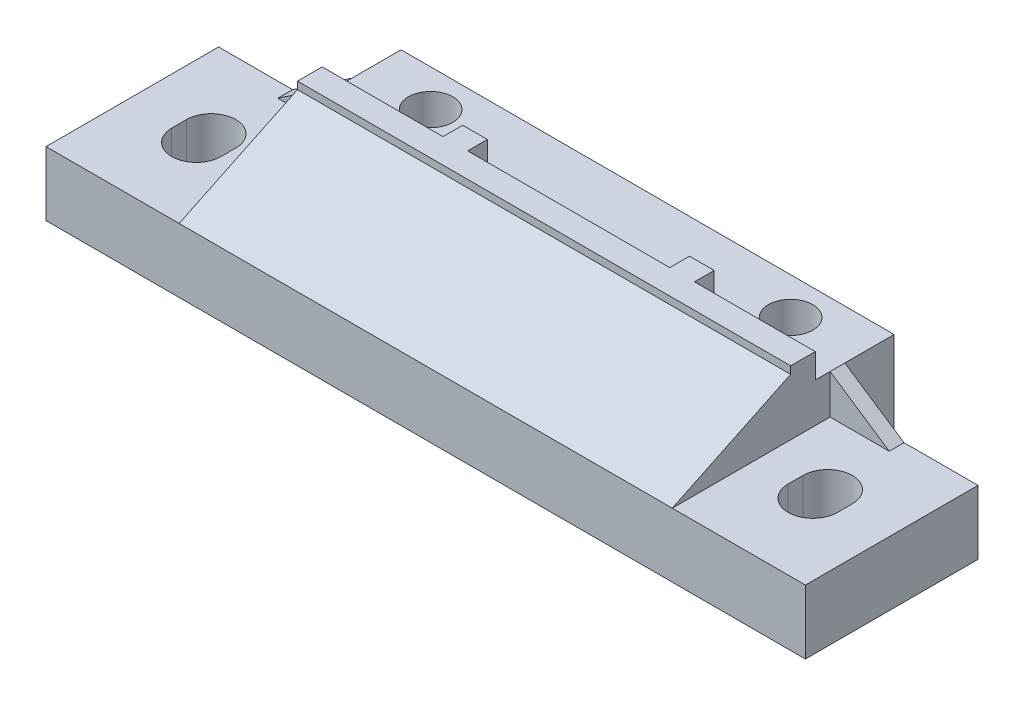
ISO-10303-21;
HEADER;
FILE_DESCRIPTION(('STEP AP214'),'2;1');
FILE_NAME('part.step','',(''),(''),'','','');
FILE_SCHEMA(('AUTOMOTIVE_DESIGN { 1 0 10303 214 1 1 1 1 }'));
ENDSEC;
DATA;
#1=APPLICATION_CONTEXT('core data for automotive mechanical design processes');
#2=APPLICATION_PROTOCOL_DEFINITION('international standard','automotive_design',2000,#1);
#3=PRODUCT_CONTEXT('',#1,'mechanical');
#4=PRODUCT('Part','Part','',(#3));
#5=PRODUCT_RELATED_PRODUCT_CATEGORY('part','',(#4));
#6=PRODUCT_DEFINITION_FORMATION('','',#4);
#7=PRODUCT_DEFINITION_CONTEXT('part definition',#1,'design');
#8=PRODUCT_DEFINITION('design','',#6,#7);
#9=PRODUCT_DEFINITION_SHAPE('','',#8);
#10=(LENGTH_UNIT() NAMED_UNIT(*) SI_UNIT(.MILLI.,.METRE.));
#11=(NAMED_UNIT(*) PLANE_ANGLE_UNIT() SI_UNIT($,.RADIAN.));
#12=(NAMED_UNIT(*) SI_UNIT($,.STERADIAN.) SOLID_ANGLE_UNIT());
#13=UNCERTAINTY_MEASURE_WITH_UNIT(LENGTH_MEASURE(1.E-05),#10,'distance_accuracy_value','');
#14=(GEOMETRIC_REPRESENTATION_CONTEXT(3) GLOBAL_UNCERTAINTY_ASSIGNED_CONTEXT((#13)) GLOBAL_UNIT_ASSIGNED_CONTEXT((#10,
#11,#12)) REPRESENTATION_CONTEXT('',''));
#15=CARTESIAN_POINT('',(0.,0.,0.));
#16=DIRECTION('',(0.,0.,1.));
#17=DIRECTION('',(1.,0.,0.));
#18=AXIS2_PLACEMENT_3D('',#15,#16,#17);
#19=CARTESIAN_POINT('',(-50.,0.,-27.5));
#20=DIRECTION('',(-1.,0.,0.));
#21=DIRECTION('',(0.,0.,1.));
#22=AXIS2_PLACEMENT_3D('',#19,#20,#21);
#23=PLANE('',#22);
#24=DIRECTION('',(0.,0.,1.));
#25=VECTOR('',#24,1.);
#26=CARTESIAN_POINT('',(-50.,21.,-11.5));
#27=LINE('',#26,#25);
#28=CARTESIAN_POINT('',(-50.,21.,-14.5));
#29=VERTEX_POINT('',#28);
#30=CARTESIAN_POINT('',(-50.,21.,-11.5));
#31=VERTEX_POINT('',#30);
#32=EDGE_CURVE('E907',#29,#31,#27,.T.);
#33=ORIENTED_EDGE('',*,*,#32,.F.);
#34=DIRECTION('',(0.,-1.,0.));
#35=VECTOR('',#34,1.);
#36=CARTESIAN_POINT('',(-50.,21.,-14.5));
#37=LINE('',#36,#35);
#38=CARTESIAN_POINT('',(-50.,13.,-14.5));
#39=VERTEX_POINT('',#38);
#40=EDGE_CURVE('E879',#29,#39,#37,.T.);
#41=ORIENTED_EDGE('',*,*,#40,.T.);
#42=DIRECTION('',(0.,0.,1.));
#43=VECTOR('',#42,1.);
#44=CARTESIAN_POINT('',(-50.,13.,0.));
#45=LINE('',#44,#43);
#46=CARTESIAN_POINT('',(-50.,13.,17.5));
#47=VERTEX_POINT('',#46);
#48=EDGE_CURVE('E1807',#39,#47,#45,.T.);
#49=ORIENTED_EDGE('',*,*,#48,.T.);
#50=DIRECTION('',(0.,-0.432120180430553,0.901816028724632));
#51=VECTOR('',#50,1.);
#52=CARTESIAN_POINT('',(-50.,24.5,-6.50000000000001));
#53=LINE('',#52,#51);
#54=CARTESIAN_POINT('',(-50.,24.5,-6.50000000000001));
#55=VERTEX_POINT('',#54);
#56=EDGE_CURVE('E1770',#55,#47,#53,.T.);
#57=ORIENTED_EDGE('',*,*,#56,.F.);
#58=DIRECTION('',(0.,1.,0.));
#59=VECTOR('',#58,1.);
#60=CARTESIAN_POINT('',(-50.,24.5,-6.50000000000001));
#61=LINE('',#60,#59);
#62=CARTESIAN_POINT('',(-50.,26.,-6.50000000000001));
#63=VERTEX_POINT('',#62);
#64=EDGE_CURVE('E1755',#55,#63,#61,.T.);
#65=ORIENTED_EDGE('',*,*,#64,.T.);
#66=DIRECTION('',(0.,0.,-1.));
#67=VECTOR('',#66,1.);
#68=CARTESIAN_POINT('',(-50.,26.,-6.50000000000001));
#69=LINE('',#68,#67);
#70=CARTESIAN_POINT('',(-50.,26.,-11.5));
#71=VERTEX_POINT('',#70);
#72=EDGE_CURVE('E1760',#63,#71,#69,.T.);
#73=ORIENTED_EDGE('',*,*,#72,.T.);
#74=DIRECTION('',(0.,-1.,0.));
#75=VECTOR('',#74,1.);
#76=CARTESIAN_POINT('',(-50.,26.,-11.5));
#77=LINE('',#76,#75);
#78=EDGE_CURVE('E1756',#71,#31,#77,.T.);
#79=ORIENTED_EDGE('',*,*,#78,.T.);
#80=EDGE_LOOP('',(#33,#41,#49,#57,#65,#73,#79));
#81=FACE_BOUND('',#80,.T.);
#82=ADVANCED_FACE('F35',(#81),#23,.T.);
#83=CARTESIAN_POINT('',(50.,24.5,-27.5));
#84=DIRECTION('',(1.,0.,0.));
#85=DIRECTION('',(0.,1.,0.));
#86=AXIS2_PLACEMENT_3D('',#83,#84,#85);
#87=PLANE('',#86);
#88=DIRECTION('',(0.,0.,-1.));
#89=VECTOR('',#88,1.);
#90=CARTESIAN_POINT('',(50.,21.,-27.5));
#91=LINE('',#90,#89);
#92=CARTESIAN_POINT('',(50.,21.,-17.5));
#93=VERTEX_POINT('',#92);
#94=CARTESIAN_POINT('',(50.,21.,-27.5));
#95=VERTEX_POINT('',#94);
#96=EDGE_CURVE('E940',#93,#95,#91,.T.);
#97=ORIENTED_EDGE('',*,*,#96,.F.);
#98=DIRECTION('',(0.,1.,0.));
#99=VECTOR('',#98,1.);
#100=CARTESIAN_POINT('',(50.,13.,-17.5));
#101=LINE('',#100,#99);
#102=CARTESIAN_POINT('',(50.,0.,-17.5));
#103=VERTEX_POINT('',#102);
#104=EDGE_CURVE('E1805',#103,#93,#101,.T.);
#105=ORIENTED_EDGE('',*,*,#104,.F.);
#106=DIRECTION('',(0.,0.,1.));
#107=VECTOR('',#106,1.);
#108=CARTESIAN_POINT('',(50.,0.,-27.5));
#109=LINE('',#108,#107);
#110=CARTESIAN_POINT('',(50.,0.,-27.5));
#111=VERTEX_POINT('',#110);
#112=EDGE_CURVE('E1796',#111,#103,#109,.T.);
#113=ORIENTED_EDGE('',*,*,#112,.F.);
#114=DIRECTION('',(0.,1.,0.));
#115=VECTOR('',#114,1.);
#116=CARTESIAN_POINT('',(50.,24.5,-27.5));
#117=LINE('',#116,#115);
#118=EDGE_CURVE('E1791',#111,#95,#117,.T.);
#119=ORIENTED_EDGE('',*,*,#118,.T.);
#120=EDGE_LOOP('',(#97,#105,#113,#119));
#121=FACE_BOUND('',#120,.T.);
#122=ADVANCED_FACE('F1923',(#121),#87,.T.);
#123=CARTESIAN_POINT('',(47.,0.,5.00000000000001));
#124=DIRECTION('',(0.,0.,-1.));
#125=DIRECTION('',(0.,1.,0.));
#126=AXIS2_PLACEMENT_3D('',#123,#124,#125);
#127=PLANE('',#126);
#128=DIRECTION('',(-1.,0.,0.));
#129=VECTOR('',#128,1.);
#130=CARTESIAN_POINT('',(47.,14.5540888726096,5.00000000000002));
#131=LINE('',#130,#129);
#132=CARTESIAN_POINT('',(-41.1783644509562,14.5540888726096,5.00000000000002));
#133=VERTEX_POINT('',#132);
#134=CARTESIAN_POINT('',(-47.,14.5540888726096,5.00000000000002));
#135=VERTEX_POINT('',#134);
#136=EDGE_CURVE('E1043',#133,#135,#131,.T.);
#137=ORIENTED_EDGE('',*,*,#136,.F.);
#138=DIRECTION('',(-0.371390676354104,-0.92847669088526,0.));
#139=VECTOR('',#138,1.);
#140=CARTESIAN_POINT('',(-34.0344827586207,32.4137931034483,5.00000000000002));
#141=LINE('',#140,#139);
#142=CARTESIAN_POINT('',(-47.,0.,5.00000000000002));
#143=VERTEX_POINT('',#142);
#144=EDGE_CURVE('E1848',#133,#143,#141,.T.);
#145=ORIENTED_EDGE('',*,*,#144,.T.);
#146=DIRECTION('',(0.,-1.,0.));
#147=VECTOR('',#146,1.);
#148=CARTESIAN_POINT('',(-47.,0.,5.00000000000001));
#149=LINE('',#148,#147);
#150=EDGE_CURVE('E1023',#135,#143,#149,.T.);
#151=ORIENTED_EDGE('',*,*,#150,.F.);
#152=EDGE_LOOP('',(#137,#145,#151));
#153=FACE_BOUND('',#152,.T.);
#154=ADVANCED_FACE('F1930',(#153),#127,.T.);
#155=CARTESIAN_POINT('',(47.,0.,8.00000000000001));
#156=DIRECTION('',(0.,0.,1.));
#157=DIRECTION('',(1.,0.,0.));
#158=AXIS2_PLACEMENT_3D('',#155,#156,#157);
#159=PLANE('',#158);
#160=DIRECTION('',(0.,1.,0.));
#161=VECTOR('',#160,1.);
#162=CARTESIAN_POINT('',(-47.,0.,8.00000000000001));
#163=LINE('',#162,#161);
#164=CARTESIAN_POINT('',(-47.,0.,8.00000000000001));
#165=VERTEX_POINT('',#164);
#166=CARTESIAN_POINT('',(-47.,13.1165888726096,8.00000000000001));
#167=VERTEX_POINT('',#166);
#168=EDGE_CURVE('E995',#165,#167,#163,.T.);
#169=ORIENTED_EDGE('',*,*,#168,.F.);
#170=DIRECTION('',(0.371390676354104,0.92847669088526,0.));
#171=VECTOR('',#170,1.);
#172=CARTESIAN_POINT('',(-34.0344827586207,32.4137931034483,8.00000000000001));
#173=LINE('',#172,#171);
#174=CARTESIAN_POINT('',(-41.7533644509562,13.1165888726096,8.00000000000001));
#175=VERTEX_POINT('',#174);
#176=EDGE_CURVE('E1855',#165,#175,#173,.T.);
#177=ORIENTED_EDGE('',*,*,#176,.T.);
#178=DIRECTION('',(-1.,0.,0.));
#179=VECTOR('',#178,1.);
#180=CARTESIAN_POINT('',(47.,13.1165888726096,8.00000000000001));
#181=LINE('',#180,#179);
#182=EDGE_CURVE('E1008',#175,#167,#181,.T.);
#183=ORIENTED_EDGE('',*,*,#182,.T.);
#184=EDGE_LOOP('',(#169,#177,#183));
#185=FACE_BOUND('',#184,.T.);
#186=ADVANCED_FACE('F1904',(#185),#159,.T.);
#187=CARTESIAN_POINT('',(0.,0.,0.));
#188=DIRECTION('',(0.,1.,0.));
#189=DIRECTION('',(0.,0.,1.));
#190=AXIS2_PLACEMENT_3D('',#187,#188,#189);
#191=PLANE('',#190);
#192=DIRECTION('',(0.,0.,-1.));
#193=VECTOR('',#192,1.);
#194=CARTESIAN_POINT('',(47.,0.,14.5));
#195=LINE('',#194,#193);
#196=CARTESIAN_POINT('',(47.,0.,14.5));
#197=VERTEX_POINT('',#196);
#198=CARTESIAN_POINT('',(47.,0.,8.00000000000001));
#199=VERTEX_POINT('',#198);
#200=EDGE_CURVE('E1003',#197,#199,#195,.T.);
#201=ORIENTED_EDGE('',*,*,#200,.T.);
#202=DIRECTION('',(0.,0.,-1.));
#203=VECTOR('',#202,1.);
#204=CARTESIAN_POINT('',(47.,0.,0.));
#205=LINE('',#204,#203);
#206=CARTESIAN_POINT('',(47.,0.,5.00000000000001));
#207=VERTEX_POINT('',#206);
#208=EDGE_CURVE('E1859',#199,#207,#205,.T.);
#209=ORIENTED_EDGE('',*,*,#208,.T.);
#210=DIRECTION('',(0.,0.,-1.));
#211=VECTOR('',#210,1.);
#212=CARTESIAN_POINT('',(47.,0.,5.00000000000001));
#213=LINE('',#212,#211);
#214=CARTESIAN_POINT('',(47.,0.,-0.499999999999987));
#215=VERTEX_POINT('',#214);
#216=EDGE_CURVE('E1037',#207,#215,#213,.T.);
#217=ORIENTED_EDGE('',*,*,#216,.T.);
#218=DIRECTION('',(-1.,0.,0.));
#219=VECTOR('',#218,1.);
#220=CARTESIAN_POINT('',(47.,0.,-0.499999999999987));
#221=LINE('',#220,#219);
#222=CARTESIAN_POINT('',(-47.,0.,-0.499999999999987));
#223=VERTEX_POINT('',#222);
#224=EDGE_CURVE('E1040',#215,#223,#221,.T.);
#225=ORIENTED_EDGE('',*,*,#224,.T.);
#226=DIRECTION('',(0.,0.,-1.));
#227=VECTOR('',#226,1.);
#228=CARTESIAN_POINT('',(-47.,0.,5.00000000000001));
#229=LINE('',#228,#227);
#230=EDGE_CURVE('E1026',#143,#223,#229,.T.);
#231=ORIENTED_EDGE('',*,*,#230,.F.);
#232=DIRECTION('',(0.,0.,1.));
#233=VECTOR('',#232,1.);
#234=CARTESIAN_POINT('',(-47.,0.,8.00000000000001));
#235=LINE('',#234,#233);
#236=EDGE_CURVE('E1852',#143,#165,#235,.T.);
#237=ORIENTED_EDGE('',*,*,#236,.T.);
#238=DIRECTION('',(0.,0.,-1.));
#239=VECTOR('',#238,1.);
#240=CARTESIAN_POINT('',(-47.,0.,14.5));
#241=LINE('',#240,#239);
#242=CARTESIAN_POINT('',(-47.,0.,14.5));
#243=VERTEX_POINT('',#242);
#244=EDGE_CURVE('E992',#243,#165,#241,.T.);
#245=ORIENTED_EDGE('',*,*,#244,.F.);
#246=DIRECTION('',(-1.,0.,0.));
#247=VECTOR('',#246,1.);
#248=CARTESIAN_POINT('',(47.,0.,14.5));
#249=LINE('',#248,#247);
#250=EDGE_CURVE('E1012',#197,#243,#249,.T.);
#251=ORIENTED_EDGE('',*,*,#250,.F.);
#252=EDGE_LOOP('',(#201,#209,#217,#225,#231,#237,#245,#251));
#253=FACE_BOUND('',#252,.T.);
#254=CARTESIAN_POINT('',(-60.,0.,11.1824583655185));
#255=DIRECTION('',(0.,1.,0.));
#256=DIRECTION('',(0.,0.,1.));
#257=AXIS2_PLACEMENT_3D('',#254,#255,#256);
#258=CIRCLE('',#257,1.);
#259=CARTESIAN_POINT('',(-60.25,0.,10.2142125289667));
#260=VERTEX_POINT('',#259);
#261=CARTESIAN_POINT('',(-61.,0.,11.1824583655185));
#262=VERTEX_POINT('',#261);
#263=EDGE_CURVE('E1017',#260,#262,#258,.T.);
#264=ORIENTED_EDGE('',*,*,#263,.T.);
#265=DIRECTION('',(0.,0.,1.));
#266=VECTOR('',#265,1.);
#267=CARTESIAN_POINT('',(-61.,0.,13.5));
#268=LINE('',#267,#266);
#269=CARTESIAN_POINT('',(-61.,0.,13.5));
#270=VERTEX_POINT('',#269);
#271=EDGE_CURVE('E1200',#262,#270,#268,.T.);
#272=ORIENTED_EDGE('',*,*,#271,.T.);
#273=CARTESIAN_POINT('',(-60.,0.,13.5));
#274=DIRECTION('',(0.,1.,0.));
#275=DIRECTION('',(0.,0.,-1.));
#276=AXIS2_PLACEMENT_3D('',#273,#274,#275);
#277=CIRCLE('',#276,1.);
#278=CARTESIAN_POINT('',(-60.,0.,14.5));
#279=VERTEX_POINT('',#278);
#280=EDGE_CURVE('E1242',#270,#279,#277,.T.);
#281=ORIENTED_EDGE('',*,*,#280,.T.);
#282=DIRECTION('',(1.,0.,0.));
#283=VECTOR('',#282,1.);
#284=CARTESIAN_POINT('',(-52.,0.,14.5));
#285=LINE('',#284,#283);
#286=CARTESIAN_POINT('',(-52.,0.,14.5));
#287=VERTEX_POINT('',#286);
#288=EDGE_CURVE('E1239',#279,#287,#285,.T.);
#289=ORIENTED_EDGE('',*,*,#288,.T.);
#290=CARTESIAN_POINT('',(-52.,0.,12.5));
#291=DIRECTION('',(0.,1.,0.));
#292=DIRECTION('',(0.,0.,-1.));
#293=AXIS2_PLACEMENT_3D('',#290,#291,#292);
#294=CIRCLE('',#293,2.);
#295=CARTESIAN_POINT('',(-50.,0.,12.5));
#296=VERTEX_POINT('',#295);
#297=EDGE_CURVE('E1236',#287,#296,#294,.T.);
#298=ORIENTED_EDGE('',*,*,#297,.T.);
#299=DIRECTION('',(0.,0.,-1.));
#300=VECTOR('',#299,1.);
#301=CARTESIAN_POINT('',(-50.,0.,5.50000000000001));
#302=LINE('',#301,#300);
#303=CARTESIAN_POINT('',(-50.,0.,5.50000000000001));
#304=VERTEX_POINT('',#303);
#305=EDGE_CURVE('E1233',#296,#304,#302,.T.);
#306=ORIENTED_EDGE('',*,*,#305,.T.);
#307=CARTESIAN_POINT('',(-52.,0.,5.49999999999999));
#308=DIRECTION('',(0.,1.,0.));
#309=DIRECTION('',(0.,0.,1.));
#310=AXIS2_PLACEMENT_3D('',#307,#308,#309);
#311=CIRCLE('',#310,2.);
#312=CARTESIAN_POINT('',(-52.,0.,3.49999999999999));
#313=VERTEX_POINT('',#312);
#314=EDGE_CURVE('E1230',#304,#313,#311,.T.);
#315=ORIENTED_EDGE('',*,*,#314,.T.);
#316=DIRECTION('',(-1.,0.,0.));
#317=VECTOR('',#316,1.);
#318=CARTESIAN_POINT('',(-53.488895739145,0.,3.49999999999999));
#319=LINE('',#318,#317);
#320=CARTESIAN_POINT('',(-53.488895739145,0.,3.49999999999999));
#321=VERTEX_POINT('',#320);
#322=EDGE_CURVE('E1227',#313,#321,#319,.T.);
#323=ORIENTED_EDGE('',*,*,#322,.T.);
#324=CARTESIAN_POINT('',(-53.488895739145,0.,3.79999999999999));
#325=DIRECTION('',(0.,1.,0.));
#326=DIRECTION('',(0.,0.,1.));
#327=AXIS2_PLACEMENT_3D('',#324,#325,#326);
#328=CIRCLE('',#327,0.300000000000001);
#329=CARTESIAN_POINT('',(-53.7795765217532,0.,3.7258064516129));
#330=VERTEX_POINT('',#329);
#331=EDGE_CURVE('E1224',#321,#330,#328,.T.);
#332=ORIENTED_EDGE('',*,*,#331,.T.);
#333=CARTESIAN_POINT('',(-62.5,0.,1.5));
#334=DIRECTION('',(0.,-1.,0.));
#335=DIRECTION('',(0.,0.,-1.));
#336=AXIS2_PLACEMENT_3D('',#333,#334,#335);
#337=CIRCLE('',#336,8.99999999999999);
#338=EDGE_CURVE('E1221',#330,#260,#337,.T.);
#339=ORIENTED_EDGE('',*,*,#338,.T.);
#340=EDGE_LOOP('',(#264,#272,#281,#289,#298,#306,#315,#323,#332,#339));
#341=FACE_BOUND('',#340,.T.);
#342=CARTESIAN_POINT('',(-72.1870598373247,0.,-12.5));
#343=DIRECTION('',(0.,1.,0.));
#344=DIRECTION('',(0.,0.,-1.));
#345=AXIS2_PLACEMENT_3D('',#342,#343,#344);
#346=CIRCLE('',#345,2.);
#347=CARTESIAN_POINT('',(-72.1870598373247,0.,-14.5));
#348=VERTEX_POINT('',#347);
#349=CARTESIAN_POINT('',(-74.1870598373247,0.,-12.5));
#350=VERTEX_POINT('',#349);
#351=EDGE_CURVE('E1071',#348,#350,#346,.T.);
#352=ORIENTED_EDGE('',*,*,#351,.T.);
#353=DIRECTION('',(0.,0.,1.));
#354=VECTOR('',#353,1.);
#355=CARTESIAN_POINT('',(-74.1870598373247,0.,-4.50000000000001));
#356=LINE('',#355,#354);
#357=CARTESIAN_POINT('',(-74.1870598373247,0.,-4.50000000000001));
#358=VERTEX_POINT('',#357);
#359=EDGE_CURVE('E1052',#350,#358,#356,.T.);
#360=ORIENTED_EDGE('',*,*,#359,.T.);
#361=CARTESIAN_POINT('',(-73.1870598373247,0.,-4.5));
#362=DIRECTION('',(0.,1.,0.));
#363=DIRECTION('',(0.,0.,1.));
#364=AXIS2_PLACEMENT_3D('',#361,#362,#363);
#365=CIRCLE('',#364,1.);
#366=CARTESIAN_POINT('',(-73.1870598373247,0.,-3.5));
#367=VERTEX_POINT('',#366);
#368=EDGE_CURVE('E1096',#358,#367,#365,.T.);
#369=ORIENTED_EDGE('',*,*,#368,.T.);
#370=DIRECTION('',(1.,0.,0.));
#371=VECTOR('',#370,1.);
#372=CARTESIAN_POINT('',(-73.1870598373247,0.,-3.5));
#373=LINE('',#372,#371);
#374=CARTESIAN_POINT('',(-72.0393920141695,0.,-3.5));
#375=VERTEX_POINT('',#374);
#376=EDGE_CURVE('E1093',#367,#375,#373,.T.);
#377=ORIENTED_EDGE('',*,*,#376,.T.);
#378=CARTESIAN_POINT('',(-72.0393920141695,0.,-4.5));
#379=DIRECTION('',(0.,1.,0.));
#380=DIRECTION('',(0.,0.,-1.));
#381=AXIS2_PLACEMENT_3D('',#378,#379,#380);
#382=CIRCLE('',#381,1.);
#383=CARTESIAN_POINT('',(-71.0854528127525,0.,-4.2));
#384=VERTEX_POINT('',#383);
#385=EDGE_CURVE('E1090',#375,#384,#382,.T.);
#386=ORIENTED_EDGE('',*,*,#385,.T.);
#387=CARTESIAN_POINT('',(-62.5,0.,-1.5));
#388=DIRECTION('',(0.,-1.,0.));
#389=DIRECTION('',(0.,0.,-1.));
#390=AXIS2_PLACEMENT_3D('',#387,#388,#389);
#391=CIRCLE('',#390,8.99999999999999);
#392=CARTESIAN_POINT('',(-64.75,0.,-10.2142125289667));
#393=VERTEX_POINT('',#392);
#394=EDGE_CURVE('E1087',#384,#393,#391,.T.);
#395=ORIENTED_EDGE('',*,*,#394,.T.);
#396=CARTESIAN_POINT('',(-65.,0.,-11.1824583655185));
#397=DIRECTION('',(0.,1.,0.));
#398=DIRECTION('',(0.,0.,1.));
#399=AXIS2_PLACEMENT_3D('',#396,#397,#398);
#400=CIRCLE('',#399,1.);
#401=CARTESIAN_POINT('',(-64.,0.,-11.1824583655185));
#402=VERTEX_POINT('',#401);
#403=EDGE_CURVE('E1084',#393,#402,#400,.T.);
#404=ORIENTED_EDGE('',*,*,#403,.T.);
#405=DIRECTION('',(0.,0.,-1.));
#406=VECTOR('',#405,1.);
#407=CARTESIAN_POINT('',(-64.,0.,-11.1824583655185));
#408=LINE('',#407,#406);
#409=CARTESIAN_POINT('',(-64.,0.,-13.5));
#410=VERTEX_POINT('',#409);
#411=EDGE_CURVE('E1081',#402,#410,#408,.T.);
#412=ORIENTED_EDGE('',*,*,#411,.T.);
#413=CARTESIAN_POINT('',(-65.,0.,-13.5));
#414=DIRECTION('',(0.,1.,0.));
#415=DIRECTION('',(0.,0.,-1.));
#416=AXIS2_PLACEMENT_3D('',#413,#414,#415);
#417=CIRCLE('',#416,1.);
#418=CARTESIAN_POINT('',(-65.,0.,-14.5));
#419=VERTEX_POINT('',#418);
#420=EDGE_CURVE('E1078',#410,#419,#417,.T.);
#421=ORIENTED_EDGE('',*,*,#420,.T.);
#422=DIRECTION('',(-1.,0.,0.));
#423=VECTOR('',#422,1.);
#424=CARTESIAN_POINT('',(-65.,0.,-14.5));
#425=LINE('',#424,#423);
#426=EDGE_CURVE('E1074',#419,#348,#425,.T.);
#427=ORIENTED_EDGE('',*,*,#426,.T.);
#428=EDGE_LOOP('',(#352,#360,#369,#377,#386,#395,#404,#412,#421,#427));
#429=FACE_BOUND('',#428,.T.);
#430=DIRECTION('',(0.,0.,1.));
#431=VECTOR('',#430,1.);
#432=CARTESIAN_POINT('',(-67.5,0.,1.5));
#433=LINE('',#432,#431);
#434=CARTESIAN_POINT('',(-67.5,0.,-1.5));
#435=VERTEX_POINT('',#434);
#436=CARTESIAN_POINT('',(-67.5,0.,1.5));
#437=VERTEX_POINT('',#436);
#438=EDGE_CURVE('E1704',#435,#437,#433,.T.);
#439=ORIENTED_EDGE('',*,*,#438,.T.);
#440=CARTESIAN_POINT('',(-62.5,0.,1.5));
#441=DIRECTION('',(0.,1.,0.));
#442=DIRECTION('',(0.,0.,-1.));
#443=AXIS2_PLACEMENT_3D('',#440,#441,#442);
#444=CIRCLE('',#443,5.);
#445=CARTESIAN_POINT('',(-57.5,0.,1.5));
#446=VERTEX_POINT('',#445);
#447=EDGE_CURVE('E1694',#437,#446,#444,.T.);
#448=ORIENTED_EDGE('',*,*,#447,.T.);
#449=DIRECTION('',(0.,0.,-1.));
#450=VECTOR('',#449,1.);
#451=CARTESIAN_POINT('',(-57.5,0.,1.5));
#452=LINE('',#451,#450);
#453=CARTESIAN_POINT('',(-57.5,0.,-1.5));
#454=VERTEX_POINT('',#453);
#455=EDGE_CURVE('E1697',#446,#454,#452,.T.);
#456=ORIENTED_EDGE('',*,*,#455,.T.);
#457=CARTESIAN_POINT('',(-62.5,0.,-1.5));
#458=DIRECTION('',(0.,1.,0.));
#459=DIRECTION('',(0.,0.,-1.));
#460=AXIS2_PLACEMENT_3D('',#457,#458,#459);
#461=CIRCLE('',#460,5.);
#462=EDGE_CURVE('E1701',#454,#435,#461,.T.);
#463=ORIENTED_EDGE('',*,*,#462,.T.);
#464=EDGE_LOOP('',(#439,#448,#456,#463));
#465=FACE_BOUND('',#464,.T.);
#466=DIRECTION('',(0.,0.,1.));
#467=VECTOR('',#466,1.);
#468=CARTESIAN_POINT('',(57.5,0.,1.5));
#469=LINE('',#468,#467);
#470=CARTESIAN_POINT('',(57.5,0.,-1.5));
#471=VERTEX_POINT('',#470);
#472=CARTESIAN_POINT('',(57.5,0.,1.5));
#473=VERTEX_POINT('',#472);
#474=EDGE_CURVE('E1670',#471,#473,#469,.T.);
#475=ORIENTED_EDGE('',*,*,#474,.T.);
#476=CARTESIAN_POINT('',(62.5,0.,1.5));
#477=DIRECTION('',(0.,1.,0.));
#478=DIRECTION('',(0.,0.,1.));
#479=AXIS2_PLACEMENT_3D('',#476,#477,#478);
#480=CIRCLE('',#479,5.);
#481=CARTESIAN_POINT('',(67.5,0.,1.5));
#482=VERTEX_POINT('',#481);
#483=EDGE_CURVE('E1660',#473,#482,#480,.T.);
#484=ORIENTED_EDGE('',*,*,#483,.T.);
#485=DIRECTION('',(0.,0.,-1.));
#486=VECTOR('',#485,1.);
#487=CARTESIAN_POINT('',(67.5,0.,1.5));
#488=LINE('',#487,#486);
#489=CARTESIAN_POINT('',(67.5,0.,-1.5));
#490=VERTEX_POINT('',#489);
#491=EDGE_CURVE('E1663',#482,#490,#488,.T.);
#492=ORIENTED_EDGE('',*,*,#491,.T.);
#493=CARTESIAN_POINT('',(62.5,0.,-1.5));
#494=DIRECTION('',(0.,1.,0.));
#495=DIRECTION('',(0.,0.,1.));
#496=AXIS2_PLACEMENT_3D('',#493,#494,#495);
#497=CIRCLE('',#496,5.);
#498=EDGE_CURVE('E1667',#490,#471,#497,.T.);
#499=ORIENTED_EDGE('',*,*,#498,.T.);
#500=EDGE_LOOP('',(#475,#484,#492,#499));
#501=FACE_BOUND('',#500,.T.);
#502=DIRECTION('',(1.,0.,0.));
#503=VECTOR('',#502,1.);
#504=CARTESIAN_POINT('',(52.,0.,-14.5));
#505=LINE('',#504,#503);
#506=CARTESIAN_POINT('',(52.,0.,-14.5));
#507=VERTEX_POINT('',#506);
#508=CARTESIAN_POINT('',(59.9999999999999,0.,-14.5));
#509=VERTEX_POINT('',#508);
#510=EDGE_CURVE('E1613',#507,#509,#505,.T.);
#511=ORIENTED_EDGE('',*,*,#510,.F.);
#512=CARTESIAN_POINT('',(52.,0.,-12.5));
#513=DIRECTION('',(0.,-1.,0.));
#514=DIRECTION('',(0.,0.,1.));
#515=AXIS2_PLACEMENT_3D('',#512,#513,#514);
#516=CIRCLE('',#515,2.);
#517=CARTESIAN_POINT('',(50.,0.,-12.5));
#518=VERTEX_POINT('',#517);
#519=EDGE_CURVE('E1403',#518,#507,#516,.T.);
#520=ORIENTED_EDGE('',*,*,#519,.F.);
#521=DIRECTION('',(0.,0.,-1.));
#522=VECTOR('',#521,1.);
#523=CARTESIAN_POINT('',(50.,0.,-12.5));
#524=LINE('',#523,#522);
#525=CARTESIAN_POINT('',(50.,0.,-5.50000000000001));
#526=VERTEX_POINT('',#525);
#527=EDGE_CURVE('E1584',#526,#518,#524,.T.);
#528=ORIENTED_EDGE('',*,*,#527,.F.);
#529=CARTESIAN_POINT('',(52.,0.,-5.49999999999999));
#530=DIRECTION('',(0.,-1.,0.));
#531=DIRECTION('',(0.,0.,-1.));
#532=AXIS2_PLACEMENT_3D('',#529,#530,#531);
#533=CIRCLE('',#532,2.);
#534=CARTESIAN_POINT('',(52.,0.,-3.49999999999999));
#535=VERTEX_POINT('',#534);
#536=EDGE_CURVE('E1634',#535,#526,#533,.T.);
#537=ORIENTED_EDGE('',*,*,#536,.F.);
#538=DIRECTION('',(-1.,0.,0.));
#539=VECTOR('',#538,1.);
#540=CARTESIAN_POINT('',(53.488895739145,0.,-3.49999999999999));
#541=LINE('',#540,#539);
#542=CARTESIAN_POINT('',(53.488895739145,0.,-3.49999999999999));
#543=VERTEX_POINT('',#542);
#544=EDGE_CURVE('E1631',#543,#535,#541,.T.);
#545=ORIENTED_EDGE('',*,*,#544,.F.);
#546=CARTESIAN_POINT('',(53.488895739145,0.,-3.79999999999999));
#547=DIRECTION('',(0.,-1.,0.));
#548=DIRECTION('',(0.,0.,-1.));
#549=AXIS2_PLACEMENT_3D('',#546,#547,#548);
#550=CIRCLE('',#549,0.299999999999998);
#551=CARTESIAN_POINT('',(53.7795765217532,0.,-3.7258064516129));
#552=VERTEX_POINT('',#551);
#553=EDGE_CURVE('E1628',#552,#543,#550,.T.);
#554=ORIENTED_EDGE('',*,*,#553,.F.);
#555=CARTESIAN_POINT('',(62.5,0.,-1.5));
#556=DIRECTION('',(0.,1.,0.));
#557=DIRECTION('',(0.,0.,-1.));
#558=AXIS2_PLACEMENT_3D('',#555,#556,#557);
#559=CIRCLE('',#558,9.);
#560=CARTESIAN_POINT('',(60.2499999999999,0.,-10.2142125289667));
#561=VERTEX_POINT('',#560);
#562=EDGE_CURVE('E1625',#561,#552,#559,.T.);
#563=ORIENTED_EDGE('',*,*,#562,.F.);
#564=CARTESIAN_POINT('',(59.9999999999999,0.,-11.1824583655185));
#565=DIRECTION('',(0.,-1.,0.));
#566=DIRECTION('',(0.,0.,-1.));
#567=AXIS2_PLACEMENT_3D('',#564,#565,#566);
#568=CIRCLE('',#567,1.);
#569=CARTESIAN_POINT('',(60.9999999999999,0.,-11.1824583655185));
#570=VERTEX_POINT('',#569);
#571=EDGE_CURVE('E1622',#570,#561,#568,.T.);
#572=ORIENTED_EDGE('',*,*,#571,.F.);
#573=DIRECTION('',(0.,0.,1.));
#574=VECTOR('',#573,1.);
#575=CARTESIAN_POINT('',(60.9999999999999,0.,-11.1824583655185));
#576=LINE('',#575,#574);
#577=CARTESIAN_POINT('',(60.9999999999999,0.,-13.5));
#578=VERTEX_POINT('',#577);
#579=EDGE_CURVE('E1619',#578,#570,#576,.T.);
#580=ORIENTED_EDGE('',*,*,#579,.F.);
#581=CARTESIAN_POINT('',(59.9999999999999,0.,-13.5));
#582=DIRECTION('',(0.,-1.,0.));
#583=DIRECTION('',(0.,0.,1.));
#584=AXIS2_PLACEMENT_3D('',#581,#582,#583);
#585=CIRCLE('',#584,0.999999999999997);
#586=EDGE_CURVE('E1616',#509,#578,#585,.T.);
#587=ORIENTED_EDGE('',*,*,#586,.F.);
#588=EDGE_LOOP('',(#511,#520,#528,#537,#545,#554,#563,#572,#580,#587));
#589=FACE_BOUND('',#588,.T.);
#590=DIRECTION('',(0.,0.,1.));
#591=VECTOR('',#590,1.);
#592=CARTESIAN_POINT('',(74.1870598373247,0.,-4.50000000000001));
#593=LINE('',#592,#591);
#594=CARTESIAN_POINT('',(74.1870598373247,0.,-12.5));
#595=VERTEX_POINT('',#594);
#596=CARTESIAN_POINT('',(74.1870598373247,0.,-4.50000000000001));
#597=VERTEX_POINT('',#596);
#598=EDGE_CURVE('E1374',#595,#597,#593,.T.);
#599=ORIENTED_EDGE('',*,*,#598,.F.);
#600=CARTESIAN_POINT('',(72.1870598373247,0.,-12.5));
#601=DIRECTION('',(0.,-1.,0.));
#602=DIRECTION('',(0.,0.,-1.));
#603=AXIS2_PLACEMENT_3D('',#600,#601,#602);
#604=CIRCLE('',#603,2.);
#605=CARTESIAN_POINT('',(72.1870598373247,0.,-14.5));
#606=VERTEX_POINT('',#605);
#607=EDGE_CURVE('E1372',#606,#595,#604,.T.);
#608=ORIENTED_EDGE('',*,*,#607,.F.);
#609=DIRECTION('',(1.,0.,0.));
#610=VECTOR('',#609,1.);
#611=CARTESIAN_POINT('',(65.,0.,-14.5));
#612=LINE('',#611,#610);
#613=CARTESIAN_POINT('',(65.,0.,-14.5));
#614=VERTEX_POINT('',#613);
#615=EDGE_CURVE('E1344',#614,#606,#612,.T.);
#616=ORIENTED_EDGE('',*,*,#615,.F.);
#617=CARTESIAN_POINT('',(65.,0.,-13.5));
#618=DIRECTION('',(0.,-1.,0.));
#619=DIRECTION('',(0.,0.,-1.));
#620=AXIS2_PLACEMENT_3D('',#617,#618,#619);
#621=CIRCLE('',#620,1.);
#622=CARTESIAN_POINT('',(64.,0.,-13.5));
#623=VERTEX_POINT('',#622);
#624=EDGE_CURVE('E1396',#623,#614,#621,.T.);
#625=ORIENTED_EDGE('',*,*,#624,.F.);
#626=DIRECTION('',(0.,0.,-1.));
#627=VECTOR('',#626,1.);
#628=CARTESIAN_POINT('',(64.,0.,-11.1824583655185));
#629=LINE('',#628,#627);
#630=CARTESIAN_POINT('',(64.,0.,-11.1824583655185));
#631=VERTEX_POINT('',#630);
#632=EDGE_CURVE('E1393',#631,#623,#629,.T.);
#633=ORIENTED_EDGE('',*,*,#632,.F.);
#634=CARTESIAN_POINT('',(65.,0.,-11.1824583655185));
#635=DIRECTION('',(0.,-1.,0.));
#636=DIRECTION('',(0.,0.,1.));
#637=AXIS2_PLACEMENT_3D('',#634,#635,#636);
#638=CIRCLE('',#637,1.);
#639=CARTESIAN_POINT('',(64.75,0.,-10.2142125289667));
#640=VERTEX_POINT('',#639);
#641=EDGE_CURVE('E1390',#640,#631,#638,.T.);
#642=ORIENTED_EDGE('',*,*,#641,.F.);
#643=CARTESIAN_POINT('',(62.5,0.,-1.5));
#644=DIRECTION('',(0.,1.,0.));
#645=DIRECTION('',(0.,0.,-1.));
#646=AXIS2_PLACEMENT_3D('',#643,#644,#645);
#647=CIRCLE('',#646,8.99999999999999);
#648=CARTESIAN_POINT('',(71.0854528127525,0.,-4.2));
#649=VERTEX_POINT('',#648);
#650=EDGE_CURVE('E1387',#649,#640,#647,.T.);
#651=ORIENTED_EDGE('',*,*,#650,.F.);
#652=CARTESIAN_POINT('',(72.0393920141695,0.,-4.5));
#653=DIRECTION('',(0.,-1.,0.));
#654=DIRECTION('',(0.,0.,-1.));
#655=AXIS2_PLACEMENT_3D('',#652,#653,#654);
#656=CIRCLE('',#655,1.);
#657=CARTESIAN_POINT('',(72.0393920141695,0.,-3.5));
#658=VERTEX_POINT('',#657);
#659=EDGE_CURVE('E1384',#658,#649,#656,.T.);
#660=ORIENTED_EDGE('',*,*,#659,.F.);
#661=DIRECTION('',(-1.,0.,0.));
#662=VECTOR('',#661,1.);
#663=CARTESIAN_POINT('',(73.1870598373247,0.,-3.5));
#664=LINE('',#663,#662);
#665=CARTESIAN_POINT('',(73.1870598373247,0.,-3.5));
#666=VERTEX_POINT('',#665);
#667=EDGE_CURVE('E1381',#666,#658,#664,.T.);
#668=ORIENTED_EDGE('',*,*,#667,.F.);
#669=CARTESIAN_POINT('',(73.1870598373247,0.,-4.5));
#670=DIRECTION('',(0.,-1.,0.));
#671=DIRECTION('',(0.,0.,1.));
#672=AXIS2_PLACEMENT_3D('',#669,#670,#671);
#673=CIRCLE('',#672,1.);
#674=EDGE_CURVE('E1378',#597,#666,#673,.T.);
#675=ORIENTED_EDGE('',*,*,#674,.F.);
#676=EDGE_LOOP('',(#599,#608,#616,#625,#633,#642,#651,#660,#668,#675));
#677=FACE_BOUND('',#676,.T.);
#678=DIRECTION('',(-1.,0.,0.));
#679=VECTOR('',#678,1.);
#680=CARTESIAN_POINT('',(65.,0.,14.5));
#681=LINE('',#680,#679);
#682=CARTESIAN_POINT('',(72.0643369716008,0.,14.5));
#683=VERTEX_POINT('',#682);
#684=CARTESIAN_POINT('',(65.,0.,14.5));
#685=VERTEX_POINT('',#684);
#686=EDGE_CURVE('E1456',#683,#685,#681,.T.);
#687=ORIENTED_EDGE('',*,*,#686,.F.);
#688=CARTESIAN_POINT('',(72.0643369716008,0.,12.5));
#689=DIRECTION('',(0.,-1.,0.));
#690=DIRECTION('',(0.,0.,1.));
#691=AXIS2_PLACEMENT_3D('',#688,#689,#690);
#692=CIRCLE('',#691,1.99999999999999);
#693=CARTESIAN_POINT('',(74.0641705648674,0.,12.5257992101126));
#694=VERTEX_POINT('',#693);
#695=EDGE_CURVE('E1454',#694,#683,#692,.T.);
#696=ORIENTED_EDGE('',*,*,#695,.F.);
#697=DIRECTION('',(-0.0128996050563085,0.,0.999916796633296));
#698=VECTOR('',#697,1.);
#699=CARTESIAN_POINT('',(74.0641705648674,0.,12.5257992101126));
#700=LINE('',#699,#698);
#701=CARTESIAN_POINT('',(74.1675424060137,0.,4.51289960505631));
#702=VERTEX_POINT('',#701);
#703=EDGE_CURVE('E1426',#702,#694,#700,.T.);
#704=ORIENTED_EDGE('',*,*,#703,.F.);
#705=CARTESIAN_POINT('',(73.1676256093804,0.,4.49999999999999));
#706=DIRECTION('',(0.,-1.,0.));
#707=DIRECTION('',(0.,0.,1.));
#708=AXIS2_PLACEMENT_3D('',#705,#706,#707);
#709=CIRCLE('',#708,0.999999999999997);
#710=CARTESIAN_POINT('',(73.1676256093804,0.,3.49999999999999));
#711=VERTEX_POINT('',#710);
#712=EDGE_CURVE('E1478',#711,#702,#709,.T.);
#713=ORIENTED_EDGE('',*,*,#712,.F.);
#714=DIRECTION('',(1.,0.,0.));
#715=VECTOR('',#714,1.);
#716=CARTESIAN_POINT('',(73.1676256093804,0.,3.49999999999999));
#717=LINE('',#716,#715);
#718=CARTESIAN_POINT('',(72.0393920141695,0.,3.49999999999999));
#719=VERTEX_POINT('',#718);
#720=EDGE_CURVE('E1475',#719,#711,#717,.T.);
#721=ORIENTED_EDGE('',*,*,#720,.F.);
#722=CARTESIAN_POINT('',(72.0393920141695,0.,4.49999999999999));
#723=DIRECTION('',(0.,-1.,0.));
#724=DIRECTION('',(0.,0.,-1.));
#725=AXIS2_PLACEMENT_3D('',#722,#723,#724);
#726=CIRCLE('',#725,0.999999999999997);
#727=CARTESIAN_POINT('',(71.0854528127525,0.,4.19999999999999));
#728=VERTEX_POINT('',#727);
#729=EDGE_CURVE('E1472',#728,#719,#726,.T.);
#730=ORIENTED_EDGE('',*,*,#729,.F.);
#731=CARTESIAN_POINT('',(62.5,0.,1.5));
#732=DIRECTION('',(0.,1.,0.));
#733=DIRECTION('',(0.,0.,-1.));
#734=AXIS2_PLACEMENT_3D('',#731,#732,#733);
#735=CIRCLE('',#734,9.);
#736=CARTESIAN_POINT('',(64.75,0.,10.2142125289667));
#737=VERTEX_POINT('',#736);
#738=EDGE_CURVE('E1469',#737,#728,#735,.T.);
#739=ORIENTED_EDGE('',*,*,#738,.F.);
#740=CARTESIAN_POINT('',(65.,0.,11.1824583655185));
#741=DIRECTION('',(0.,-1.,0.));
#742=DIRECTION('',(0.,0.,-1.));
#743=AXIS2_PLACEMENT_3D('',#740,#741,#742);
#744=CIRCLE('',#743,1.);
#745=CARTESIAN_POINT('',(64.,0.,11.1824583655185));
#746=VERTEX_POINT('',#745);
#747=EDGE_CURVE('E1466',#746,#737,#744,.T.);
#748=ORIENTED_EDGE('',*,*,#747,.F.);
#749=DIRECTION('',(0.,0.,-1.));
#750=VECTOR('',#749,1.);
#751=CARTESIAN_POINT('',(64.,0.,13.5));
#752=LINE('',#751,#750);
#753=CARTESIAN_POINT('',(64.,0.,13.5));
#754=VERTEX_POINT('',#753);
#755=EDGE_CURVE('E1463',#754,#746,#752,.T.);
#756=ORIENTED_EDGE('',*,*,#755,.F.);
#757=CARTESIAN_POINT('',(65.,0.,13.5));
#758=DIRECTION('',(0.,-1.,0.));
#759=DIRECTION('',(0.,0.,1.));
#760=AXIS2_PLACEMENT_3D('',#757,#758,#759);
#761=CIRCLE('',#760,1.);
#762=EDGE_CURVE('E1460',#685,#754,#761,.T.);
#763=ORIENTED_EDGE('',*,*,#762,.F.);
#764=EDGE_LOOP('',(#687,#696,#704,#713,#721,#730,#739,#748,#756,#763));
#765=FACE_BOUND('',#764,.T.);
#766=DIRECTION('',(0.,0.,1.));
#767=VECTOR('',#766,1.);
#768=CARTESIAN_POINT('',(61.,0.,13.5));
#769=LINE('',#768,#767);
#770=CARTESIAN_POINT('',(61.,0.,11.1824583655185));
#771=VERTEX_POINT('',#770);
#772=CARTESIAN_POINT('',(61.,0.,13.5));
#773=VERTEX_POINT('',#772);
#774=EDGE_CURVE('E1535',#771,#773,#769,.T.);
#775=ORIENTED_EDGE('',*,*,#774,.F.);
#776=CARTESIAN_POINT('',(60.,0.,11.1824583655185));
#777=DIRECTION('',(0.,-1.,0.));
#778=DIRECTION('',(0.,0.,1.));
#779=AXIS2_PLACEMENT_3D('',#776,#777,#778);
#780=CIRCLE('',#779,1.);
#781=CARTESIAN_POINT('',(60.25,0.,10.2142125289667));
#782=VERTEX_POINT('',#781);
#783=EDGE_CURVE('E1321',#782,#771,#780,.T.);
#784=ORIENTED_EDGE('',*,*,#783,.F.);
#785=CARTESIAN_POINT('',(62.5,0.,1.5));
#786=DIRECTION('',(0.,1.,0.));
#787=DIRECTION('',(0.,0.,-1.));
#788=AXIS2_PLACEMENT_3D('',#785,#786,#787);
#789=CIRCLE('',#788,8.99999999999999);
#790=CARTESIAN_POINT('',(53.7795765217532,0.,3.7258064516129));
#791=VERTEX_POINT('',#790);
#792=EDGE_CURVE('E1506',#791,#782,#789,.T.);
#793=ORIENTED_EDGE('',*,*,#792,.F.);
#794=CARTESIAN_POINT('',(53.488895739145,0.,3.79999999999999));
#795=DIRECTION('',(0.,-1.,0.));
#796=DIRECTION('',(0.,0.,1.));
#797=AXIS2_PLACEMENT_3D('',#794,#795,#796);
#798=CIRCLE('',#797,0.300000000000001);
#799=CARTESIAN_POINT('',(53.488895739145,0.,3.49999999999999));
#800=VERTEX_POINT('',#799);
#801=EDGE_CURVE('E1556',#800,#791,#798,.T.);
#802=ORIENTED_EDGE('',*,*,#801,.F.);
#803=DIRECTION('',(1.,0.,0.));
#804=VECTOR('',#803,1.);
#805=CARTESIAN_POINT('',(53.488895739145,0.,3.49999999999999));
#806=LINE('',#805,#804);
#807=CARTESIAN_POINT('',(52.,0.,3.49999999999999));
#808=VERTEX_POINT('',#807);
#809=EDGE_CURVE('E1553',#808,#800,#806,.T.);
#810=ORIENTED_EDGE('',*,*,#809,.F.);
#811=CARTESIAN_POINT('',(52.,0.,5.49999999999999));
#812=DIRECTION('',(0.,-1.,0.));
#813=DIRECTION('',(0.,0.,1.));
#814=AXIS2_PLACEMENT_3D('',#811,#812,#813);
#815=CIRCLE('',#814,2.);
#816=CARTESIAN_POINT('',(50.,0.,5.50000000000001));
#817=VERTEX_POINT('',#816);
#818=EDGE_CURVE('E1550',#817,#808,#815,.T.);
#819=ORIENTED_EDGE('',*,*,#818,.F.);
#820=DIRECTION('',(0.,0.,-1.));
#821=VECTOR('',#820,1.);
#822=CARTESIAN_POINT('',(50.,0.,5.50000000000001));
#823=LINE('',#822,#821);
#824=CARTESIAN_POINT('',(50.,0.,12.5));
#825=VERTEX_POINT('',#824);
#826=EDGE_CURVE('E1547',#825,#817,#823,.T.);
#827=ORIENTED_EDGE('',*,*,#826,.F.);
#828=CARTESIAN_POINT('',(52.,0.,12.5));
#829=DIRECTION('',(0.,-1.,0.));
#830=DIRECTION('',(0.,0.,-1.));
#831=AXIS2_PLACEMENT_3D('',#828,#829,#830);
#832=CIRCLE('',#831,2.);
#833=CARTESIAN_POINT('',(52.,0.,14.5));
#834=VERTEX_POINT('',#833);
#835=EDGE_CURVE('E1544',#834,#825,#832,.T.);
#836=ORIENTED_EDGE('',*,*,#835,.F.);
#837=DIRECTION('',(-1.,0.,0.));
#838=VECTOR('',#837,1.);
#839=CARTESIAN_POINT('',(52.,0.,14.5));
#840=LINE('',#839,#838);
#841=CARTESIAN_POINT('',(60.,0.,14.5));
#842=VERTEX_POINT('',#841);
#843=EDGE_CURVE('E1541',#842,#834,#840,.T.);
#844=ORIENTED_EDGE('',*,*,#843,.F.);
#845=CARTESIAN_POINT('',(60.,0.,13.5));
#846=DIRECTION('',(0.,-1.,0.));
#847=DIRECTION('',(0.,0.,-1.));
#848=AXIS2_PLACEMENT_3D('',#845,#846,#847);
#849=CIRCLE('',#848,1.);
#850=EDGE_CURVE('E1538',#773,#842,#849,.T.);
#851=ORIENTED_EDGE('',*,*,#850,.F.);
#852=EDGE_LOOP('',(#775,#784,#793,#802,#810,#819,#827,#836,#844,#851));
#853=FACE_BOUND('',#852,.T.);
#854=CARTESIAN_POINT('',(-52.,0.,-12.5));
#855=DIRECTION('',(0.,1.,0.));
#856=DIRECTION('',(0.,0.,1.));
#857=AXIS2_PLACEMENT_3D('',#854,#855,#856);
#858=CIRCLE('',#857,2.);
#859=CARTESIAN_POINT('',(-50.,0.,-12.5));
#860=VERTEX_POINT('',#859);
#861=CARTESIAN_POINT('',(-52.,0.,-14.5));
#862=VERTEX_POINT('',#861);
#863=EDGE_CURVE('E1104',#860,#862,#858,.T.);
#864=ORIENTED_EDGE('',*,*,#863,.T.);
#865=DIRECTION('',(-1.,0.,0.));
#866=VECTOR('',#865,1.);
#867=CARTESIAN_POINT('',(-52.,0.,-14.5));
#868=LINE('',#867,#866);
#869=CARTESIAN_POINT('',(-59.9999999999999,0.,-14.5));
#870=VERTEX_POINT('',#869);
#871=EDGE_CURVE('E1271',#862,#870,#868,.T.);
#872=ORIENTED_EDGE('',*,*,#871,.T.);
#873=CARTESIAN_POINT('',(-59.9999999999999,0.,-13.5));
#874=DIRECTION('',(0.,1.,0.));
#875=DIRECTION('',(0.,0.,1.));
#876=AXIS2_PLACEMENT_3D('',#873,#874,#875);
#877=CIRCLE('',#876,0.999999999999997);
#878=CARTESIAN_POINT('',(-60.9999999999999,0.,-13.5));
#879=VERTEX_POINT('',#878);
#880=EDGE_CURVE('E1313',#870,#879,#877,.T.);
#881=ORIENTED_EDGE('',*,*,#880,.T.);
#882=DIRECTION('',(0.,0.,1.));
#883=VECTOR('',#882,1.);
#884=CARTESIAN_POINT('',(-60.9999999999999,0.,-11.1824583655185));
#885=LINE('',#884,#883);
#886=CARTESIAN_POINT('',(-60.9999999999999,0.,-11.1824583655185));
#887=VERTEX_POINT('',#886);
#888=EDGE_CURVE('E1310',#879,#887,#885,.T.);
#889=ORIENTED_EDGE('',*,*,#888,.T.);
#890=CARTESIAN_POINT('',(-59.9999999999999,0.,-11.1824583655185));
#891=DIRECTION('',(0.,1.,0.));
#892=DIRECTION('',(0.,0.,-1.));
#893=AXIS2_PLACEMENT_3D('',#890,#891,#892);
#894=CIRCLE('',#893,1.);
#895=CARTESIAN_POINT('',(-60.2499999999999,0.,-10.2142125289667));
#896=VERTEX_POINT('',#895);
#897=EDGE_CURVE('E1307',#887,#896,#894,.T.);
#898=ORIENTED_EDGE('',*,*,#897,.T.);
#899=CARTESIAN_POINT('',(-62.5,0.,-1.5));
#900=DIRECTION('',(0.,-1.,0.));
#901=DIRECTION('',(0.,0.,-1.));
#902=AXIS2_PLACEMENT_3D('',#899,#900,#901);
#903=CIRCLE('',#902,9.);
#904=CARTESIAN_POINT('',(-53.7795765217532,0.,-3.7258064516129));
#905=VERTEX_POINT('',#904);
#906=EDGE_CURVE('E1304',#896,#905,#903,.T.);
#907=ORIENTED_EDGE('',*,*,#906,.T.);
#908=CARTESIAN_POINT('',(-53.488895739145,0.,-3.79999999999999));
#909=DIRECTION('',(0.,1.,0.));
#910=DIRECTION('',(0.,0.,-1.));
#911=AXIS2_PLACEMENT_3D('',#908,#909,#910);
#912=CIRCLE('',#911,0.299999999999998);
#913=CARTESIAN_POINT('',(-53.488895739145,0.,-3.49999999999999));
#914=VERTEX_POINT('',#913);
#915=EDGE_CURVE('E1301',#905,#914,#912,.T.);
#916=ORIENTED_EDGE('',*,*,#915,.T.);
#917=DIRECTION('',(1.,0.,0.));
#918=VECTOR('',#917,1.);
#919=CARTESIAN_POINT('',(-53.488895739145,0.,-3.49999999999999));
#920=LINE('',#919,#918);
#921=CARTESIAN_POINT('',(-52.,0.,-3.49999999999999));
#922=VERTEX_POINT('',#921);
#923=EDGE_CURVE('E1298',#914,#922,#920,.T.);
#924=ORIENTED_EDGE('',*,*,#923,.T.);
#925=CARTESIAN_POINT('',(-52.,0.,-5.49999999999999));
#926=DIRECTION('',(0.,1.,0.));
#927=DIRECTION('',(0.,0.,-1.));
#928=AXIS2_PLACEMENT_3D('',#925,#926,#927);
#929=CIRCLE('',#928,2.);
#930=CARTESIAN_POINT('',(-50.,0.,-5.50000000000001));
#931=VERTEX_POINT('',#930);
#932=EDGE_CURVE('E1295',#922,#931,#929,.T.);
#933=ORIENTED_EDGE('',*,*,#932,.T.);
#934=DIRECTION('',(0.,0.,-1.));
#935=VECTOR('',#934,1.);
#936=CARTESIAN_POINT('',(-50.,0.,-12.5));
#937=LINE('',#936,#935);
#938=EDGE_CURVE('E1292',#931,#860,#937,.T.);
#939=ORIENTED_EDGE('',*,*,#938,.T.);
#940=EDGE_LOOP('',(#864,#872,#881,#889,#898,#907,#916,#924,#933,#939));
#941=FACE_BOUND('',#940,.T.);
#942=CARTESIAN_POINT('',(-72.0643369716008,0.,12.5));
#943=DIRECTION('',(0.,1.,0.));
#944=DIRECTION('',(0.,0.,1.));
#945=AXIS2_PLACEMENT_3D('',#942,#943,#944);
#946=CIRCLE('',#945,1.99999999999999);
#947=CARTESIAN_POINT('',(-74.0641705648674,0.,12.5257992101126));
#948=VERTEX_POINT('',#947);
#949=CARTESIAN_POINT('',(-72.0643369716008,0.,14.5));
#950=VERTEX_POINT('',#949);
#951=EDGE_CURVE('E1146',#948,#950,#946,.T.);
#952=ORIENTED_EDGE('',*,*,#951,.T.);
#953=DIRECTION('',(1.,0.,0.));
#954=VECTOR('',#953,1.);
#955=CARTESIAN_POINT('',(-65.,0.,14.5));
#956=LINE('',#955,#954);
#957=CARTESIAN_POINT('',(-65.,0.,14.5));
#958=VERTEX_POINT('',#957);
#959=EDGE_CURVE('E1127',#950,#958,#956,.T.);
#960=ORIENTED_EDGE('',*,*,#959,.T.);
#961=CARTESIAN_POINT('',(-65.,0.,13.5));
#962=DIRECTION('',(0.,1.,0.));
#963=DIRECTION('',(0.,0.,1.));
#964=AXIS2_PLACEMENT_3D('',#961,#962,#963);
#965=CIRCLE('',#964,1.);
#966=CARTESIAN_POINT('',(-64.,0.,13.5));
#967=VERTEX_POINT('',#966);
#968=EDGE_CURVE('E1171',#958,#967,#965,.T.);
#969=ORIENTED_EDGE('',*,*,#968,.T.);
#970=DIRECTION('',(0.,0.,-1.));
#971=VECTOR('',#970,1.);
#972=CARTESIAN_POINT('',(-64.,0.,13.5));
#973=LINE('',#972,#971);
#974=CARTESIAN_POINT('',(-64.,0.,11.1824583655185));
#975=VERTEX_POINT('',#974);
#976=EDGE_CURVE('E1168',#967,#975,#973,.T.);
#977=ORIENTED_EDGE('',*,*,#976,.T.);
#978=CARTESIAN_POINT('',(-65.,0.,11.1824583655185));
#979=DIRECTION('',(0.,1.,0.));
#980=DIRECTION('',(0.,0.,-1.));
#981=AXIS2_PLACEMENT_3D('',#978,#979,#980);
#982=CIRCLE('',#981,1.);
#983=CARTESIAN_POINT('',(-64.75,0.,10.2142125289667));
#984=VERTEX_POINT('',#983);
#985=EDGE_CURVE('E1165',#975,#984,#982,.T.);
#986=ORIENTED_EDGE('',*,*,#985,.T.);
#987=CARTESIAN_POINT('',(-62.5,0.,1.5));
#988=DIRECTION('',(0.,-1.,0.));
#989=DIRECTION('',(0.,0.,-1.));
#990=AXIS2_PLACEMENT_3D('',#987,#988,#989);
#991=CIRCLE('',#990,9.);
#992=CARTESIAN_POINT('',(-71.0854528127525,0.,4.19999999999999));
#993=VERTEX_POINT('',#992);
#994=EDGE_CURVE('E1162',#984,#993,#991,.T.);
#995=ORIENTED_EDGE('',*,*,#994,.T.);
#996=CARTESIAN_POINT('',(-72.0393920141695,0.,4.49999999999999));
#997=DIRECTION('',(0.,1.,0.));
#998=DIRECTION('',(0.,0.,-1.));
#999=AXIS2_PLACEMENT_3D('',#996,#997,#998);
#1000=CIRCLE('',#999,0.999999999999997);
#1001=CARTESIAN_POINT('',(-72.0393920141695,0.,3.49999999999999));
#1002=VERTEX_POINT('',#1001);
#1003=EDGE_CURVE('E1159',#993,#1002,#1000,.T.);
#1004=ORIENTED_EDGE('',*,*,#1003,.T.);
#1005=DIRECTION('',(-1.,0.,0.));
#1006=VECTOR('',#1005,1.);
#1007=CARTESIAN_POINT('',(-73.1676256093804,0.,3.49999999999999));
#1008=LINE('',#1007,#1006);
#1009=CARTESIAN_POINT('',(-73.1676256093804,0.,3.49999999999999));
#1010=VERTEX_POINT('',#1009);
#1011=EDGE_CURVE('E1156',#1002,#1010,#1008,.T.);
#1012=ORIENTED_EDGE('',*,*,#1011,.T.);
#1013=CARTESIAN_POINT('',(-73.1676256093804,0.,4.49999999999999));
#1014=DIRECTION('',(0.,1.,0.));
#1015=DIRECTION('',(0.,0.,1.));
#1016=AXIS2_PLACEMENT_3D('',#1013,#1014,#1015);
#1017=CIRCLE('',#1016,0.999999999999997);
#1018=CARTESIAN_POINT('',(-74.1675424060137,0.,4.51289960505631));
#1019=VERTEX_POINT('',#1018);
#1020=EDGE_CURVE('E1153',#1010,#1019,#1017,.T.);
#1021=ORIENTED_EDGE('',*,*,#1020,.T.);
#1022=DIRECTION('',(0.0128996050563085,0.,0.999916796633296));
#1023=VECTOR('',#1022,1.);
#1024=CARTESIAN_POINT('',(-74.0641705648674,0.,12.5257992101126));
#1025=LINE('',#1024,#1023);
#1026=EDGE_CURVE('E1149',#1019,#948,#1025,.T.);
#1027=ORIENTED_EDGE('',*,*,#1026,.T.);
#1028=EDGE_LOOP('',(#952,#960,#969,#977,#986,#995,#1004,#1012,#1021,#1027));
#1029=FACE_BOUND('',#1028,.T.);
#1030=DIRECTION('',(0.,0.,-1.));
#1031=VECTOR('',#1030,1.);
#1032=CARTESIAN_POINT('',(47.,0.,-27.5));
#1033=LINE('',#1032,#1031);
#1034=CARTESIAN_POINT('',(47.,0.,-4.49999999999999));
#1035=VERTEX_POINT('',#1034);
#1036=CARTESIAN_POINT('',(47.,0.,-27.5));
#1037=VERTEX_POINT('',#1036);
#1038=EDGE_CURVE('E963',#1035,#1037,#1033,.T.);
#1039=ORIENTED_EDGE('',*,*,#1038,.T.);
#1040=DIRECTION('',(1.,0.,0.));
#1041=VECTOR('',#1040,1.);
#1042=CARTESIAN_POINT('',(50.,0.,-27.5));
#1043=LINE('',#1042,#1041);
#1044=EDGE_CURVE('E1787',#1037,#111,#1043,.T.);
#1045=ORIENTED_EDGE('',*,*,#1044,.T.);
#1046=ORIENTED_EDGE('',*,*,#112,.T.);
#1047=DIRECTION('',(-1.,0.,0.));
#1048=VECTOR('',#1047,1.);
#1049=CARTESIAN_POINT('',(77.,0.,-17.5));
#1050=LINE('',#1049,#1048);
#1051=CARTESIAN_POINT('',(77.,0.,-17.5));
#1052=VERTEX_POINT('',#1051);
#1053=EDGE_CURVE('E1816',#1052,#103,#1050,.T.);
#1054=ORIENTED_EDGE('',*,*,#1053,.F.);
#1055=DIRECTION('',(0.,0.,-1.));
#1056=VECTOR('',#1055,1.);
#1057=CARTESIAN_POINT('',(77.,0.,17.5));
#1058=LINE('',#1057,#1056);
#1059=CARTESIAN_POINT('',(77.,0.,17.5));
#1060=VERTEX_POINT('',#1059);
#1061=EDGE_CURVE('E1831',#1060,#1052,#1058,.T.);
#1062=ORIENTED_EDGE('',*,*,#1061,.F.);
#1063=DIRECTION('',(1.,0.,0.));
#1064=VECTOR('',#1063,1.);
#1065=CARTESIAN_POINT('',(77.,0.,17.5));
#1066=LINE('',#1065,#1064);
#1067=CARTESIAN_POINT('',(-77.,0.,17.5));
#1068=VERTEX_POINT('',#1067);
#1069=EDGE_CURVE('E1829',#1068,#1060,#1066,.T.);
#1070=ORIENTED_EDGE('',*,*,#1069,.F.);
#1071=DIRECTION('',(0.,0.,1.));
#1072=VECTOR('',#1071,1.);
#1073=CARTESIAN_POINT('',(-77.,0.,17.5));
#1074=LINE('',#1073,#1072);
#1075=CARTESIAN_POINT('',(-77.,0.,-17.5));
#1076=VERTEX_POINT('',#1075);
#1077=EDGE_CURVE('E1811',#1076,#1068,#1074,.T.);
#1078=ORIENTED_EDGE('',*,*,#1077,.F.);
#1079=CARTESIAN_POINT('',(-50.,0.,-17.5));
#1080=VERTEX_POINT('',#1079);
#1081=EDGE_CURVE('E1833',#1080,#1076,#1050,.T.);
#1082=ORIENTED_EDGE('',*,*,#1081,.F.);
#1083=DIRECTION('',(0.,0.,1.));
#1084=VECTOR('',#1083,1.);
#1085=CARTESIAN_POINT('',(-50.,0.,-27.5));
#1086=LINE('',#1085,#1084);
#1087=CARTESIAN_POINT('',(-50.,0.,-27.5));
#1088=VERTEX_POINT('',#1087);
#1089=EDGE_CURVE('E1797',#1088,#1080,#1086,.T.);
#1090=ORIENTED_EDGE('',*,*,#1089,.F.);
#1091=CARTESIAN_POINT('',(-47.,0.,-27.5));
#1092=VERTEX_POINT('',#1091);
#1093=EDGE_CURVE('E1788',#1088,#1092,#1043,.T.);
#1094=ORIENTED_EDGE('',*,*,#1093,.T.);
#1095=DIRECTION('',(0.,0.,-1.));
#1096=VECTOR('',#1095,1.);
#1097=CARTESIAN_POINT('',(-47.,0.,-27.5));
#1098=LINE('',#1097,#1096);
#1099=CARTESIAN_POINT('',(-47.,0.,-4.49999999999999));
#1100=VERTEX_POINT('',#1099);
#1101=EDGE_CURVE('E952',#1100,#1092,#1098,.T.);
#1102=ORIENTED_EDGE('',*,*,#1101,.F.);
#1103=DIRECTION('',(-1.,0.,0.));
#1104=VECTOR('',#1103,1.);
#1105=CARTESIAN_POINT('',(47.,0.,-4.49999999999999));
#1106=LINE('',#1105,#1104);
#1107=EDGE_CURVE('E973',#1035,#1100,#1106,.T.);
#1108=ORIENTED_EDGE('',*,*,#1107,.F.);
#1109=EDGE_LOOP('',(#1039,#1045,#1046,#1054,#1062,#1070,#1078,#1082,#1090,#1094,#1102,#1108));
#1110=FACE_BOUND('',#1109,.T.);
#1111=ADVANCED_FACE('F1877',(#253,#341,#429,#465,#501,#589,#677,#765,#853,#941,#1029,#1110),
#191,.F.);
#1112=CARTESIAN_POINT('',(0.,0.,-27.5));
#1113=DIRECTION('',(0.,0.,-1.));
#1114=DIRECTION('',(-1.,0.,0.));
#1115=AXIS2_PLACEMENT_3D('',#1112,#1113,#1114);
#1116=PLANE('',#1115);
#1117=DIRECTION('',(-1.,0.,0.));
#1118=VECTOR('',#1117,1.);
#1119=CARTESIAN_POINT('',(-50.,21.,-27.5));
#1120=LINE('',#1119,#1118);
#1121=CARTESIAN_POINT('',(-50.,21.,-27.5));
#1122=VERTEX_POINT('',#1121);
#1123=EDGE_CURVE('E944',#95,#1122,#1120,.T.);
#1124=ORIENTED_EDGE('',*,*,#1123,.F.);
#1125=ORIENTED_EDGE('',*,*,#118,.F.);
#1126=ORIENTED_EDGE('',*,*,#1044,.F.);
#1127=DIRECTION('',(0.,1.,0.));
#1128=VECTOR('',#1127,1.);
#1129=CARTESIAN_POINT('',(47.,12.,-27.5));
#1130=LINE('',#1129,#1128);
#1131=CARTESIAN_POINT('',(47.,12.,-27.5));
#1132=VERTEX_POINT('',#1131);
#1133=EDGE_CURVE('E966',#1037,#1132,#1130,.T.);
#1134=ORIENTED_EDGE('',*,*,#1133,.T.);
#1135=DIRECTION('',(-1.,0.,0.));
#1136=VECTOR('',#1135,1.);
#1137=CARTESIAN_POINT('',(47.,12.,-27.5));
#1138=LINE('',#1137,#1136);
#1139=CARTESIAN_POINT('',(-47.,12.,-27.5));
#1140=VERTEX_POINT('',#1139);
#1141=EDGE_CURVE('E978',#1132,#1140,#1138,.T.);
#1142=ORIENTED_EDGE('',*,*,#1141,.T.);
#1143=DIRECTION('',(0.,1.,0.));
#1144=VECTOR('',#1143,1.);
#1145=CARTESIAN_POINT('',(-47.,12.,-27.5));
#1146=LINE('',#1145,#1144);
#1147=EDGE_CURVE('E954',#1092,#1140,#1146,.T.);
#1148=ORIENTED_EDGE('',*,*,#1147,.F.);
#1149=ORIENTED_EDGE('',*,*,#1093,.F.);
#1150=DIRECTION('',(0.,-1.,0.));
#1151=VECTOR('',#1150,1.);
#1152=CARTESIAN_POINT('',(-50.,0.,-27.5));
#1153=LINE('',#1152,#1151);
#1154=EDGE_CURVE('E1794',#1122,#1088,#1153,.T.);
#1155=ORIENTED_EDGE('',*,*,#1154,.F.);
#1156=EDGE_LOOP('',(#1124,#1125,#1126,#1134,#1142,#1148,#1149,#1155));
#1157=FACE_BOUND('',#1156,.T.);
#1158=ADVANCED_FACE('F1966',(#1157),#1116,.T.);
#1159=CARTESIAN_POINT('',(-36.5,-12.7279220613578,-20.));
#1160=DIRECTION('',(0.,1.,0.));
#1161=DIRECTION('',(0.,0.,1.));
#1162=AXIS2_PLACEMENT_3D('',#1159,#1160,#1161);
#1163=CYLINDRICAL_SURFACE('',#1162,4.5);
#1164=CARTESIAN_POINT('',(-36.5,21.,-20.));
#1165=DIRECTION('',(0.,-1.,0.));
#1166=DIRECTION('',(0.,0.,-1.));
#1167=AXIS2_PLACEMENT_3D('',#1164,#1165,#1166);
#1168=CIRCLE('',#1167,4.5);
#1169=CARTESIAN_POINT('',(-36.5,21.,-24.5));
#1170=VERTEX_POINT('',#1169);
#1171=EDGE_CURVE('E949',#1170,#1170,#1168,.F.);
#1172=ORIENTED_EDGE('',*,*,#1171,.T.);
#1173=EDGE_LOOP('',(#1172));
#1174=FACE_BOUND('',#1173,.T.);
#1175=CARTESIAN_POINT('',(-36.5,12.,-20.));
#1176=DIRECTION('',(0.,-1.,0.));
#1177=DIRECTION('',(0.,0.,-1.));
#1178=AXIS2_PLACEMENT_3D('',#1175,#1176,#1177);
#1179=CIRCLE('',#1178,4.5);
#1180=CARTESIAN_POINT('',(-36.5,12.,-24.5));
#1181=VERTEX_POINT('',#1180);
#1182=EDGE_CURVE('E982',#1181,#1181,#1179,.F.);
#1183=ORIENTED_EDGE('',*,*,#1182,.F.);
#1184=EDGE_LOOP('',(#1183));
#1185=FACE_BOUND('',#1184,.T.);
#1186=ADVANCED_FACE('F2086',(#1174,#1185),#1163,.F.);
#1187=CARTESIAN_POINT('',(36.5,-12.7279220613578,-20.));
#1188=DIRECTION('',(0.,1.,0.));
#1189=DIRECTION('',(0.,0.,1.));
#1190=AXIS2_PLACEMENT_3D('',#1187,#1188,#1189);
#1191=CYLINDRICAL_SURFACE('',#1190,4.5);
#1192=CARTESIAN_POINT('',(36.5,21.,-20.));
#1193=DIRECTION('',(0.,-1.,0.));
#1194=DIRECTION('',(0.,0.,-1.));
#1195=AXIS2_PLACEMENT_3D('',#1192,#1193,#1194);
#1196=CIRCLE('',#1195,4.5);
#1197=CARTESIAN_POINT('',(36.5,21.,-24.5));
#1198=VERTEX_POINT('',#1197);
#1199=EDGE_CURVE('E946',#1198,#1198,#1196,.F.);
#1200=ORIENTED_EDGE('',*,*,#1199,.T.);
#1201=EDGE_LOOP('',(#1200));
#1202=FACE_BOUND('',#1201,.T.);
#1203=CARTESIAN_POINT('',(36.5,12.,-20.));
#1204=DIRECTION('',(0.,-1.,0.));
#1205=DIRECTION('',(0.,0.,-1.));
#1206=AXIS2_PLACEMENT_3D('',#1203,#1204,#1205);
#1207=CIRCLE('',#1206,4.5);
#1208=CARTESIAN_POINT('',(36.5,12.,-24.5));
#1209=VERTEX_POINT('',#1208);
#1210=EDGE_CURVE('E981',#1209,#1209,#1207,.F.);
#1211=ORIENTED_EDGE('',*,*,#1210,.F.);
#1212=EDGE_LOOP('',(#1211));
#1213=FACE_BOUND('',#1212,.T.);
#1214=ADVANCED_FACE('F2091',(#1202,#1213),#1191,.F.);
#1215=CARTESIAN_POINT('',(55.2201532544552,26.,-11.5));
#1216=DIRECTION('',(0.,0.,-1.));
#1217=DIRECTION('',(-1.,0.,0.));
#1218=AXIS2_PLACEMENT_3D('',#1215,#1216,#1217);
#1219=PLANE('',#1218);
#1220=DIRECTION('',(0.,-1.,0.));
#1221=VECTOR('',#1220,1.);
#1222=CARTESIAN_POINT('',(50.,26.,-11.5));
#1223=LINE('',#1222,#1221);
#1224=CARTESIAN_POINT('',(50.,26.,-11.5));
#1225=VERTEX_POINT('',#1224);
#1226=CARTESIAN_POINT('',(50.,21.,-11.5));
#1227=VERTEX_POINT('',#1226);
#1228=EDGE_CURVE('E1768',#1225,#1227,#1223,.T.);
#1229=ORIENTED_EDGE('',*,*,#1228,.T.);
#1230=DIRECTION('',(1.,0.,0.));
#1231=VECTOR('',#1230,1.);
#1232=CARTESIAN_POINT('',(50.,21.,-11.5));
#1233=LINE('',#1232,#1231);
#1234=CARTESIAN_POINT('',(25.5,21.,-11.5));
#1235=VERTEX_POINT('',#1234);
#1236=EDGE_CURVE('E937',#1235,#1227,#1233,.T.);
#1237=ORIENTED_EDGE('',*,*,#1236,.F.);
#1238=DIRECTION('',(0.,-1.,0.));
#1239=VECTOR('',#1238,1.);
#1240=CARTESIAN_POINT('',(25.5,26.,-11.5));
#1241=LINE('',#1240,#1239);
#1242=CARTESIAN_POINT('',(25.5,26.,-11.5));
#1243=VERTEX_POINT('',#1242);
#1244=EDGE_CURVE('E1687',#1243,#1235,#1241,.T.);
#1245=ORIENTED_EDGE('',*,*,#1244,.F.);
#1246=DIRECTION('',(-1.,0.,0.));
#1247=VECTOR('',#1246,1.);
#1248=CARTESIAN_POINT('',(55.2201532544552,26.,-11.5));
#1249=LINE('',#1248,#1247);
#1250=EDGE_CURVE('E1771',#1225,#1243,#1249,.T.);
#1251=ORIENTED_EDGE('',*,*,#1250,.F.);
#1252=EDGE_LOOP('',(#1229,#1237,#1245,#1251));
#1253=FACE_BOUND('',#1252,.T.);
#1254=ADVANCED_FACE('F2040',(#1253),#1219,.T.);
#1255=CARTESIAN_POINT('',(20.5,26.,-11.5));
#1256=VERTEX_POINT('',#1255);
#1257=CARTESIAN_POINT('',(-20.5,26.,-11.5));
#1258=VERTEX_POINT('',#1257);
#1259=EDGE_CURVE('E1778',#1256,#1258,#1249,.T.);
#1260=ORIENTED_EDGE('',*,*,#1259,.F.);
#1261=DIRECTION('',(0.,1.,0.));
#1262=VECTOR('',#1261,1.);
#1263=CARTESIAN_POINT('',(20.5,24.5,-11.5));
#1264=LINE('',#1263,#1262);
#1265=CARTESIAN_POINT('',(20.5,21.,-11.5));
#1266=VERTEX_POINT('',#1265);
#1267=EDGE_CURVE('E1728',#1266,#1256,#1264,.T.);
#1268=ORIENTED_EDGE('',*,*,#1267,.F.);
#1269=DIRECTION('',(1.,0.,0.));
#1270=VECTOR('',#1269,1.);
#1271=CARTESIAN_POINT('',(20.5,21.,-11.5));
#1272=LINE('',#1271,#1270);
#1273=CARTESIAN_POINT('',(-20.5,21.,-11.5));
#1274=VERTEX_POINT('',#1273);
#1275=EDGE_CURVE('E925',#1274,#1266,#1272,.T.);
#1276=ORIENTED_EDGE('',*,*,#1275,.F.);
#1277=DIRECTION('',(0.,-1.,0.));
#1278=VECTOR('',#1277,1.);
#1279=CARTESIAN_POINT('',(-20.5,24.5,-11.5));
#1280=LINE('',#1279,#1278);
#1281=EDGE_CURVE('E1743',#1258,#1274,#1280,.T.);
#1282=ORIENTED_EDGE('',*,*,#1281,.F.);
#1283=EDGE_LOOP('',(#1260,#1268,#1276,#1282));
#1284=FACE_BOUND('',#1283,.T.);
#1285=ADVANCED_FACE('F2023',(#1284),#1219,.T.);
#1286=CARTESIAN_POINT('',(-25.5,26.,-11.5));
#1287=VERTEX_POINT('',#1286);
#1288=EDGE_CURVE('E1775',#1287,#71,#1249,.T.);
#1289=ORIENTED_EDGE('',*,*,#1288,.F.);
#1290=DIRECTION('',(0.,1.,0.));
#1291=VECTOR('',#1290,1.);
#1292=CARTESIAN_POINT('',(-25.5,26.,-11.5));
#1293=LINE('',#1292,#1291);
#1294=CARTESIAN_POINT('',(-25.5,21.,-11.5));
#1295=VERTEX_POINT('',#1294);
#1296=EDGE_CURVE('E1739',#1295,#1287,#1293,.T.);
#1297=ORIENTED_EDGE('',*,*,#1296,.F.);
#1298=DIRECTION('',(1.,0.,0.));
#1299=VECTOR('',#1298,1.);
#1300=CARTESIAN_POINT('',(-25.5,21.,-11.5));
#1301=LINE('',#1300,#1299);
#1302=EDGE_CURVE('E913',#31,#1295,#1301,.T.);
#1303=ORIENTED_EDGE('',*,*,#1302,.F.);
#1304=ORIENTED_EDGE('',*,*,#78,.F.);
#1305=EDGE_LOOP('',(#1289,#1297,#1303,#1304));
#1306=FACE_BOUND('',#1305,.T.);
#1307=ADVANCED_FACE('F2006',(#1306),#1219,.T.);
#1308=CARTESIAN_POINT('',(77.,13.,-17.5));
#1309=DIRECTION('',(0.,0.,1.));
#1310=DIRECTION('',(1.,0.,0.));
#1311=AXIS2_PLACEMENT_3D('',#1308,#1309,#1310);
#1312=PLANE('',#1311);
#1313=DIRECTION('',(-1.,0.,0.));
#1314=VECTOR('',#1313,1.);
#1315=CARTESIAN_POINT('',(77.,13.,-17.5));
#1316=LINE('',#1315,#1314);
#1317=CARTESIAN_POINT('',(-62.,13.,-17.5));
#1318=VERTEX_POINT('',#1317);
#1319=CARTESIAN_POINT('',(-77.,13.,-17.5));
#1320=VERTEX_POINT('',#1319);
#1321=EDGE_CURVE('E1822',#1318,#1320,#1316,.T.);
#1322=ORIENTED_EDGE('',*,*,#1321,.F.);
#1323=DIRECTION('',(0.832050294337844,0.554700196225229,0.));
#1324=VECTOR('',#1323,1.);
#1325=CARTESIAN_POINT('',(-62.,13.,-17.5));
#1326=LINE('',#1325,#1324);
#1327=CARTESIAN_POINT('',(-50.,21.,-17.5));
#1328=VERTEX_POINT('',#1327);
#1329=EDGE_CURVE('E875',#1318,#1328,#1326,.T.);
#1330=ORIENTED_EDGE('',*,*,#1329,.T.);
#1331=DIRECTION('',(0.,-1.,0.));
#1332=VECTOR('',#1331,1.);
#1333=CARTESIAN_POINT('',(-50.,13.,-17.5));
#1334=LINE('',#1333,#1332);
#1335=EDGE_CURVE('E1809',#1328,#1080,#1334,.T.);
#1336=ORIENTED_EDGE('',*,*,#1335,.T.);
#1337=ORIENTED_EDGE('',*,*,#1081,.T.);
#1338=DIRECTION('',(0.,-1.,0.));
#1339=VECTOR('',#1338,1.);
#1340=CARTESIAN_POINT('',(-77.,13.,-17.5));
#1341=LINE('',#1340,#1339);
#1342=EDGE_CURVE('E1826',#1320,#1076,#1341,.T.);
#1343=ORIENTED_EDGE('',*,*,#1342,.F.);
#1344=EDGE_LOOP('',(#1322,#1330,#1336,#1337,#1343));
#1345=FACE_BOUND('',#1344,.T.);
#1346=ADVANCED_FACE('F1958',(#1345),#1312,.F.);
#1347=CARTESIAN_POINT('',(0.,13.,0.));
#1348=DIRECTION('',(0.,1.,0.));
#1349=DIRECTION('',(0.,0.,1.));
#1350=AXIS2_PLACEMENT_3D('',#1347,#1348,#1349);
#1351=PLANE('',#1350);
#1352=DIRECTION('',(0.,0.,-1.));
#1353=VECTOR('',#1352,1.);
#1354=CARTESIAN_POINT('',(-62.,13.,-14.5));
#1355=LINE('',#1354,#1353);
#1356=CARTESIAN_POINT('',(-62.,13.,-14.5));
#1357=VERTEX_POINT('',#1356);
#1358=EDGE_CURVE('E886',#1357,#1318,#1355,.T.);
#1359=ORIENTED_EDGE('',*,*,#1358,.T.);
#1360=ORIENTED_EDGE('',*,*,#1321,.T.);
#1361=DIRECTION('',(0.,0.,1.));
#1362=VECTOR('',#1361,1.);
#1363=CARTESIAN_POINT('',(-77.,13.,17.5));
#1364=LINE('',#1363,#1362);
#1365=CARTESIAN_POINT('',(-77.,13.,17.5));
#1366=VERTEX_POINT('',#1365);
#1367=EDGE_CURVE('E1812',#1320,#1366,#1364,.T.);
#1368=ORIENTED_EDGE('',*,*,#1367,.T.);
#1369=DIRECTION('',(1.,0.,0.));
#1370=VECTOR('',#1369,1.);
#1371=CARTESIAN_POINT('',(77.,13.,17.5));
#1372=LINE('',#1371,#1370);
#1373=EDGE_CURVE('E1817',#1366,#47,#1372,.T.);
#1374=ORIENTED_EDGE('',*,*,#1373,.T.);
#1375=ORIENTED_EDGE('',*,*,#48,.F.);
#1376=DIRECTION('',(-1.,0.,0.));
#1377=VECTOR('',#1376,1.);
#1378=CARTESIAN_POINT('',(-50.,13.,-14.5));
#1379=LINE('',#1378,#1377);
#1380=EDGE_CURVE('E882',#39,#1357,#1379,.T.);
#1381=ORIENTED_EDGE('',*,*,#1380,.T.);
#1382=EDGE_LOOP('',(#1359,#1360,#1368,#1374,#1375,#1381));
#1383=FACE_BOUND('',#1382,.T.);
#1384=CARTESIAN_POINT('',(-62.5,13.,1.5));
#1385=DIRECTION('',(0.,1.,0.));
#1386=DIRECTION('',(0.,0.,-1.));
#1387=AXIS2_PLACEMENT_3D('',#1384,#1385,#1386);
#1388=CIRCLE('',#1387,5.);
#1389=CARTESIAN_POINT('',(-67.5,13.,1.5));
#1390=VERTEX_POINT('',#1389);
#1391=CARTESIAN_POINT('',(-57.5,13.,1.5));
#1392=VERTEX_POINT('',#1391);
#1393=EDGE_CURVE('E1641',#1390,#1392,#1388,.T.);
#1394=ORIENTED_EDGE('',*,*,#1393,.F.);
#1395=DIRECTION('',(0.,0.,1.));
#1396=VECTOR('',#1395,1.);
#1397=CARTESIAN_POINT('',(-67.5,13.,1.5));
#1398=LINE('',#1397,#1396);
#1399=CARTESIAN_POINT('',(-67.5,13.,-1.5));
#1400=VERTEX_POINT('',#1399);
#1401=EDGE_CURVE('E1698',#1400,#1390,#1398,.T.);
#1402=ORIENTED_EDGE('',*,*,#1401,.F.);
#1403=CARTESIAN_POINT('',(-62.5,13.,-1.5));
#1404=DIRECTION('',(0.,1.,0.));
#1405=DIRECTION('',(0.,0.,-1.));
#1406=AXIS2_PLACEMENT_3D('',#1403,#1404,#1405);
#1407=CIRCLE('',#1406,5.);
#1408=CARTESIAN_POINT('',(-57.5,13.,-1.5));
#1409=VERTEX_POINT('',#1408);
#1410=EDGE_CURVE('E1712',#1409,#1400,#1407,.T.);
#1411=ORIENTED_EDGE('',*,*,#1410,.F.);
#1412=DIRECTION('',(0.,0.,-1.));
#1413=VECTOR('',#1412,1.);
#1414=CARTESIAN_POINT('',(-57.5,13.,1.5));
#1415=LINE('',#1414,#1413);
#1416=EDGE_CURVE('E1709',#1392,#1409,#1415,.T.);
#1417=ORIENTED_EDGE('',*,*,#1416,.F.);
#1418=EDGE_LOOP('',(#1394,#1402,#1411,#1417));
#1419=FACE_BOUND('',#1418,.T.);
#1420=ADVANCED_FACE('F1948',(#1383,#1419),#1351,.T.);
#1421=CARTESIAN_POINT('',(-77.,13.,17.5));
#1422=DIRECTION('',(1.,0.,0.));
#1423=DIRECTION('',(0.,0.,-1.));
#1424=AXIS2_PLACEMENT_3D('',#1421,#1422,#1423);
#1425=PLANE('',#1424);
#1426=ORIENTED_EDGE('',*,*,#1077,.T.);
#1427=DIRECTION('',(0.,-1.,0.));
#1428=VECTOR('',#1427,1.);
#1429=CARTESIAN_POINT('',(-77.,13.,17.5));
#1430=LINE('',#1429,#1428);
#1431=EDGE_CURVE('E1843',#1366,#1068,#1430,.T.);
#1432=ORIENTED_EDGE('',*,*,#1431,.F.);
#1433=ORIENTED_EDGE('',*,*,#1367,.F.);
#1434=ORIENTED_EDGE('',*,*,#1342,.T.);
#1435=EDGE_LOOP('',(#1426,#1432,#1433,#1434));
#1436=FACE_BOUND('',#1435,.T.);
#1437=ADVANCED_FACE('F1994',(#1436),#1425,.F.);
#1438=CARTESIAN_POINT('',(77.,13.,17.5));
#1439=DIRECTION('',(0.,0.,-1.));
#1440=DIRECTION('',(-1.,0.,0.));
#1441=AXIS2_PLACEMENT_3D('',#1438,#1439,#1440);
#1442=PLANE('',#1441);
#1443=CARTESIAN_POINT('',(50.,13.,17.5));
#1444=VERTEX_POINT('',#1443);
#1445=CARTESIAN_POINT('',(77.,13.,17.5));
#1446=VERTEX_POINT('',#1445);
#1447=EDGE_CURVE('E1815',#1444,#1446,#1372,.T.);
#1448=ORIENTED_EDGE('',*,*,#1447,.F.);
#1449=DIRECTION('',(-1.,0.,0.));
#1450=VECTOR('',#1449,1.);
#1451=CARTESIAN_POINT('',(77.,13.,17.5));
#1452=LINE('',#1451,#1450);
#1453=EDGE_CURVE('E1782',#1444,#47,#1452,.T.);
#1454=ORIENTED_EDGE('',*,*,#1453,.T.);
#1455=ORIENTED_EDGE('',*,*,#1373,.F.);
#1456=ORIENTED_EDGE('',*,*,#1431,.T.);
#1457=ORIENTED_EDGE('',*,*,#1069,.T.);
#1458=DIRECTION('',(0.,-1.,0.));
#1459=VECTOR('',#1458,1.);
#1460=CARTESIAN_POINT('',(77.,13.,17.5));
#1461=LINE('',#1460,#1459);
#1462=EDGE_CURVE('E1840',#1446,#1060,#1461,.T.);
#1463=ORIENTED_EDGE('',*,*,#1462,.F.);
#1464=EDGE_LOOP('',(#1448,#1454,#1455,#1456,#1457,#1463));
#1465=FACE_BOUND('',#1464,.T.);
#1466=ADVANCED_FACE('F2062',(#1465),#1442,.F.);
#1467=CARTESIAN_POINT('',(77.,13.,17.5));
#1468=DIRECTION('',(-1.,0.,0.));
#1469=DIRECTION('',(0.,0.,1.));
#1470=AXIS2_PLACEMENT_3D('',#1467,#1468,#1469);
#1471=PLANE('',#1470);
#1472=ORIENTED_EDGE('',*,*,#1061,.T.);
#1473=DIRECTION('',(0.,-1.,0.));
#1474=VECTOR('',#1473,1.);
#1475=CARTESIAN_POINT('',(77.,13.,-17.5));
#1476=LINE('',#1475,#1474);
#1477=CARTESIAN_POINT('',(77.,13.,-17.5));
#1478=VERTEX_POINT('',#1477);
#1479=EDGE_CURVE('E1837',#1478,#1052,#1476,.T.);
#1480=ORIENTED_EDGE('',*,*,#1479,.F.);
#1481=DIRECTION('',(0.,0.,-1.));
#1482=VECTOR('',#1481,1.);
#1483=CARTESIAN_POINT('',(77.,13.,17.5));
#1484=LINE('',#1483,#1482);
#1485=EDGE_CURVE('E1820',#1446,#1478,#1484,.T.);
#1486=ORIENTED_EDGE('',*,*,#1485,.F.);
#1487=ORIENTED_EDGE('',*,*,#1462,.T.);
#1488=EDGE_LOOP('',(#1472,#1480,#1486,#1487));
#1489=FACE_BOUND('',#1488,.T.);
#1490=ADVANCED_FACE('F2058',(#1489),#1471,.F.);
#1491=ORIENTED_EDGE('',*,*,#1053,.T.);
#1492=ORIENTED_EDGE('',*,*,#104,.T.);
#1493=DIRECTION('',(0.832050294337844,-0.554700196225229,0.));
#1494=VECTOR('',#1493,1.);
#1495=CARTESIAN_POINT('',(62.,13.,-17.5));
#1496=LINE('',#1495,#1494);
#1497=CARTESIAN_POINT('',(62.,13.,-17.5));
#1498=VERTEX_POINT('',#1497);
#1499=EDGE_CURVE('E891',#93,#1498,#1496,.T.);
#1500=ORIENTED_EDGE('',*,*,#1499,.T.);
#1501=EDGE_CURVE('E1823',#1478,#1498,#1316,.T.);
#1502=ORIENTED_EDGE('',*,*,#1501,.F.);
#1503=ORIENTED_EDGE('',*,*,#1479,.T.);
#1504=EDGE_LOOP('',(#1491,#1492,#1500,#1502,#1503));
#1505=FACE_BOUND('',#1504,.T.);
#1506=ADVANCED_FACE('F1945',(#1505),#1312,.F.);
#1507=DIRECTION('',(0.,0.,-1.));
#1508=VECTOR('',#1507,1.);
#1509=CARTESIAN_POINT('',(62.,13.,-14.5));
#1510=LINE('',#1509,#1508);
#1511=CARTESIAN_POINT('',(62.,13.,-14.5));
#1512=VERTEX_POINT('',#1511);
#1513=EDGE_CURVE('E905',#1512,#1498,#1510,.T.);
#1514=ORIENTED_EDGE('',*,*,#1513,.F.);
#1515=DIRECTION('',(-1.,0.,0.));
#1516=VECTOR('',#1515,1.);
#1517=CARTESIAN_POINT('',(50.,13.,-14.5));
#1518=LINE('',#1517,#1516);
#1519=CARTESIAN_POINT('',(50.,13.,-14.5));
#1520=VERTEX_POINT('',#1519);
#1521=EDGE_CURVE('E899',#1512,#1520,#1518,.T.);
#1522=ORIENTED_EDGE('',*,*,#1521,.T.);
#1523=DIRECTION('',(0.,0.,-1.));
#1524=VECTOR('',#1523,1.);
#1525=CARTESIAN_POINT('',(50.,13.,0.));
#1526=LINE('',#1525,#1524);
#1527=EDGE_CURVE('E1800',#1444,#1520,#1526,.T.);
#1528=ORIENTED_EDGE('',*,*,#1527,.F.);
#1529=ORIENTED_EDGE('',*,*,#1447,.T.);
#1530=ORIENTED_EDGE('',*,*,#1485,.T.);
#1531=ORIENTED_EDGE('',*,*,#1501,.T.);
#1532=EDGE_LOOP('',(#1514,#1522,#1528,#1529,#1530,#1531));
#1533=FACE_BOUND('',#1532,.T.);
#1534=CARTESIAN_POINT('',(62.5,13.,1.5));
#1535=DIRECTION('',(0.,1.,0.));
#1536=DIRECTION('',(0.,0.,1.));
#1537=AXIS2_PLACEMENT_3D('',#1534,#1535,#1536);
#1538=CIRCLE('',#1537,5.);
#1539=CARTESIAN_POINT('',(57.5,13.,1.5));
#1540=VERTEX_POINT('',#1539);
#1541=CARTESIAN_POINT('',(67.5,13.,1.5));
#1542=VERTEX_POINT('',#1541);
#1543=EDGE_CURVE('E1674',#1540,#1542,#1538,.T.);
#1544=ORIENTED_EDGE('',*,*,#1543,.F.);
#1545=DIRECTION('',(0.,0.,1.));
#1546=VECTOR('',#1545,1.);
#1547=CARTESIAN_POINT('',(57.5,13.,1.5));
#1548=LINE('',#1547,#1546);
#1549=CARTESIAN_POINT('',(57.5,13.,-1.5));
#1550=VERTEX_POINT('',#1549);
#1551=EDGE_CURVE('E1664',#1550,#1540,#1548,.T.);
#1552=ORIENTED_EDGE('',*,*,#1551,.F.);
#1553=CARTESIAN_POINT('',(62.5,13.,-1.5));
#1554=DIRECTION('',(0.,1.,0.));
#1555=DIRECTION('',(0.,0.,1.));
#1556=AXIS2_PLACEMENT_3D('',#1553,#1554,#1555);
#1557=CIRCLE('',#1556,5.);
#1558=CARTESIAN_POINT('',(67.5,13.,-1.5));
#1559=VERTEX_POINT('',#1558);
#1560=EDGE_CURVE('E1680',#1559,#1550,#1557,.T.);
#1561=ORIENTED_EDGE('',*,*,#1560,.F.);
#1562=DIRECTION('',(0.,0.,-1.));
#1563=VECTOR('',#1562,1.);
#1564=CARTESIAN_POINT('',(67.5,13.,1.5));
#1565=LINE('',#1564,#1563);
#1566=EDGE_CURVE('E1676',#1542,#1559,#1565,.T.);
#1567=ORIENTED_EDGE('',*,*,#1566,.F.);
#1568=EDGE_LOOP('',(#1544,#1552,#1561,#1567));
#1569=FACE_BOUND('',#1568,.T.);
#1570=ADVANCED_FACE('F1937',(#1533,#1569),#1351,.T.);
#1571=ORIENTED_EDGE('',*,*,#1335,.F.);
#1572=EDGE_CURVE('E910',#1122,#1328,#27,.T.);
#1573=ORIENTED_EDGE('',*,*,#1572,.F.);
#1574=ORIENTED_EDGE('',*,*,#1154,.T.);
#1575=ORIENTED_EDGE('',*,*,#1089,.T.);
#1576=EDGE_LOOP('',(#1571,#1573,#1574,#1575));
#1577=FACE_BOUND('',#1576,.T.);
#1578=ADVANCED_FACE('F1926',(#1577),#23,.T.);
#1579=DIRECTION('',(0.,1.,0.));
#1580=VECTOR('',#1579,1.);
#1581=CARTESIAN_POINT('',(50.,21.,-14.5));
#1582=LINE('',#1581,#1580);
#1583=CARTESIAN_POINT('',(50.,21.,-14.5));
#1584=VERTEX_POINT('',#1583);
#1585=EDGE_CURVE('E894',#1520,#1584,#1582,.T.);
#1586=ORIENTED_EDGE('',*,*,#1585,.T.);
#1587=EDGE_CURVE('E941',#1227,#1584,#91,.T.);
#1588=ORIENTED_EDGE('',*,*,#1587,.F.);
#1589=ORIENTED_EDGE('',*,*,#1228,.F.);
#1590=DIRECTION('',(0.,0.,-1.));
#1591=VECTOR('',#1590,1.);
#1592=CARTESIAN_POINT('',(50.,26.,-6.50000000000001));
#1593=LINE('',#1592,#1591);
#1594=CARTESIAN_POINT('',(50.,26.,-6.50000000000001));
#1595=VERTEX_POINT('',#1594);
#1596=EDGE_CURVE('E1772',#1595,#1225,#1593,.T.);
#1597=ORIENTED_EDGE('',*,*,#1596,.F.);
#1598=DIRECTION('',(0.,1.,0.));
#1599=VECTOR('',#1598,1.);
#1600=CARTESIAN_POINT('',(50.,24.5,-6.50000000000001));
#1601=LINE('',#1600,#1599);
#1602=CARTESIAN_POINT('',(50.,24.5,-6.50000000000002));
#1603=VERTEX_POINT('',#1602);
#1604=EDGE_CURVE('E1759',#1603,#1595,#1601,.T.);
#1605=ORIENTED_EDGE('',*,*,#1604,.F.);
#1606=DIRECTION('',(0.,0.432120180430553,-0.901816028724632));
#1607=VECTOR('',#1606,1.);
#1608=CARTESIAN_POINT('',(50.,32.6835510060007,-23.578715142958));
#1609=LINE('',#1608,#1607);
#1610=EDGE_CURVE('E1785',#1444,#1603,#1609,.T.);
#1611=ORIENTED_EDGE('',*,*,#1610,.F.);
#1612=ORIENTED_EDGE('',*,*,#1527,.T.);
#1613=EDGE_LOOP('',(#1586,#1588,#1589,#1597,#1605,#1611,#1612));
#1614=FACE_BOUND('',#1613,.T.);
#1615=ADVANCED_FACE('F1933',(#1614),#87,.T.);
#1616=CARTESIAN_POINT('',(77.,24.5,-6.50000000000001));
#1617=DIRECTION('',(0.,-0.901816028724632,-0.432120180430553));
#1618=DIRECTION('',(0.,0.432120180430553,-0.901816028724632));
#1619=AXIS2_PLACEMENT_3D('',#1616,#1617,#1618);
#1620=PLANE('',#1619);
#1621=ORIENTED_EDGE('',*,*,#1610,.T.);
#1622=DIRECTION('',(-1.,0.,0.));
#1623=VECTOR('',#1622,1.);
#1624=CARTESIAN_POINT('',(-50.,24.5,-6.50000000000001));
#1625=LINE('',#1624,#1623);
#1626=EDGE_CURVE('E1846',#1603,#55,#1625,.T.);
#1627=ORIENTED_EDGE('',*,*,#1626,.T.);
#1628=ORIENTED_EDGE('',*,*,#56,.T.);
#1629=ORIENTED_EDGE('',*,*,#1453,.F.);
#1630=EDGE_LOOP('',(#1621,#1627,#1628,#1629));
#1631=FACE_BOUND('',#1630,.T.);
#1632=ADVANCED_FACE('F1943',(#1631),#1620,.F.);
#1633=CARTESIAN_POINT('',(55.2201532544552,24.5,-6.50000000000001));
#1634=DIRECTION('',(0.,0.,1.));
#1635=DIRECTION('',(1.,0.,0.));
#1636=AXIS2_PLACEMENT_3D('',#1633,#1634,#1635);
#1637=PLANE('',#1636);
#1638=ORIENTED_EDGE('',*,*,#1626,.F.);
#1639=ORIENTED_EDGE('',*,*,#1604,.T.);
#1640=DIRECTION('',(-1.,0.,0.));
#1641=VECTOR('',#1640,1.);
#1642=CARTESIAN_POINT('',(55.2201532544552,26.,-6.50000000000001));
#1643=LINE('',#1642,#1641);
#1644=EDGE_CURVE('E1767',#1595,#63,#1643,.T.);
#1645=ORIENTED_EDGE('',*,*,#1644,.T.);
#1646=ORIENTED_EDGE('',*,*,#64,.F.);
#1647=EDGE_LOOP('',(#1638,#1639,#1645,#1646));
#1648=FACE_BOUND('',#1647,.T.);
#1649=ADVANCED_FACE('F2070',(#1648),#1637,.T.);
#1650=CARTESIAN_POINT('',(55.2201532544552,26.,-6.50000000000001));
#1651=DIRECTION('',(0.,1.,0.));
#1652=DIRECTION('',(0.,0.,1.));
#1653=AXIS2_PLACEMENT_3D('',#1650,#1651,#1652);
#1654=PLANE('',#1653);
#1655=ORIENTED_EDGE('',*,*,#1644,.F.);
#1656=ORIENTED_EDGE('',*,*,#1596,.T.);
#1657=ORIENTED_EDGE('',*,*,#1250,.T.);
#1658=DIRECTION('',(0.,0.,1.));
#1659=VECTOR('',#1658,1.);
#1660=CARTESIAN_POINT('',(25.5,26.,-15.5));
#1661=LINE('',#1660,#1659);
#1662=CARTESIAN_POINT('',(25.5,26.,-15.5));
#1663=VERTEX_POINT('',#1662);
#1664=EDGE_CURVE('E1737',#1663,#1243,#1661,.T.);
#1665=ORIENTED_EDGE('',*,*,#1664,.F.);
#1666=DIRECTION('',(1.,0.,0.));
#1667=VECTOR('',#1666,1.);
#1668=CARTESIAN_POINT('',(20.5,26.,-15.5));
#1669=LINE('',#1668,#1667);
#1670=CARTESIAN_POINT('',(20.5,26.,-15.5));
#1671=VERTEX_POINT('',#1670);
#1672=EDGE_CURVE('E1724',#1671,#1663,#1669,.T.);
#1673=ORIENTED_EDGE('',*,*,#1672,.F.);
#1674=DIRECTION('',(0.,0.,1.));
#1675=VECTOR('',#1674,1.);
#1676=CARTESIAN_POINT('',(20.5,26.,-15.5));
#1677=LINE('',#1676,#1675);
#1678=EDGE_CURVE('E1732',#1671,#1256,#1677,.T.);
#1679=ORIENTED_EDGE('',*,*,#1678,.T.);
#1680=ORIENTED_EDGE('',*,*,#1259,.T.);
#1681=DIRECTION('',(0.,0.,1.));
#1682=VECTOR('',#1681,1.);
#1683=CARTESIAN_POINT('',(-20.5,26.,-15.5));
#1684=LINE('',#1683,#1682);
#1685=CARTESIAN_POINT('',(-20.5,26.,-15.5));
#1686=VERTEX_POINT('',#1685);
#1687=EDGE_CURVE('E1747',#1686,#1258,#1684,.T.);
#1688=ORIENTED_EDGE('',*,*,#1687,.F.);
#1689=DIRECTION('',(1.,0.,0.));
#1690=VECTOR('',#1689,1.);
#1691=CARTESIAN_POINT('',(-20.5,26.,-15.5));
#1692=LINE('',#1691,#1690);
#1693=CARTESIAN_POINT('',(-25.5,26.,-15.5));
#1694=VERTEX_POINT('',#1693);
#1695=EDGE_CURVE('E1742',#1694,#1686,#1692,.T.);
#1696=ORIENTED_EDGE('',*,*,#1695,.F.);
#1697=DIRECTION('',(0.,0.,1.));
#1698=VECTOR('',#1697,1.);
#1699=CARTESIAN_POINT('',(-25.5,26.,-15.5));
#1700=LINE('',#1699,#1698);
#1701=EDGE_CURVE('E1752',#1694,#1287,#1700,.T.);
#1702=ORIENTED_EDGE('',*,*,#1701,.T.);
#1703=ORIENTED_EDGE('',*,*,#1288,.T.);
#1704=ORIENTED_EDGE('',*,*,#72,.F.);
#1705=EDGE_LOOP('',(#1655,#1656,#1657,#1665,#1673,#1679,#1680,#1688,#1696,#1702,#1703,#1704));
#1706=FACE_BOUND('',#1705,.T.);
#1707=ADVANCED_FACE('F2073',(#1706),#1654,.T.);
#1708=CARTESIAN_POINT('',(-25.5,26.,-15.5));
#1709=DIRECTION('',(1.,0.,0.));
#1710=DIRECTION('',(0.,0.,-1.));
#1711=AXIS2_PLACEMENT_3D('',#1708,#1709,#1710);
#1712=PLANE('',#1711);
#1713=ORIENTED_EDGE('',*,*,#1296,.T.);
#1714=ORIENTED_EDGE('',*,*,#1701,.F.);
#1715=DIRECTION('',(0.,1.,0.));
#1716=VECTOR('',#1715,1.);
#1717=CARTESIAN_POINT('',(-25.5,26.,-15.5));
#1718=LINE('',#1717,#1716);
#1719=CARTESIAN_POINT('',(-25.5,21.,-15.5));
#1720=VERTEX_POINT('',#1719);
#1721=EDGE_CURVE('E1740',#1720,#1694,#1718,.T.);
#1722=ORIENTED_EDGE('',*,*,#1721,.F.);
#1723=DIRECTION('',(0.,0.,-1.));
#1724=VECTOR('',#1723,1.);
#1725=CARTESIAN_POINT('',(-25.5,21.,-11.5));
#1726=LINE('',#1725,#1724);
#1727=EDGE_CURVE('E916',#1295,#1720,#1726,.T.);
#1728=ORIENTED_EDGE('',*,*,#1727,.F.);
#1729=EDGE_LOOP('',(#1713,#1714,#1722,#1728));
#1730=FACE_BOUND('',#1729,.T.);
#1731=ADVANCED_FACE('F2009',(#1730),#1712,.F.);
#1732=CARTESIAN_POINT('',(-20.5,24.5,-15.5));
#1733=DIRECTION('',(-1.,0.,0.));
#1734=DIRECTION('',(0.,0.,1.));
#1735=AXIS2_PLACEMENT_3D('',#1732,#1733,#1734);
#1736=PLANE('',#1735);
#1737=ORIENTED_EDGE('',*,*,#1281,.T.);
#1738=DIRECTION('',(0.,0.,1.));
#1739=VECTOR('',#1738,1.);
#1740=CARTESIAN_POINT('',(-20.5,21.,-11.5));
#1741=LINE('',#1740,#1739);
#1742=CARTESIAN_POINT('',(-20.5,21.,-15.5));
#1743=VERTEX_POINT('',#1742);
#1744=EDGE_CURVE('E922',#1743,#1274,#1741,.T.);
#1745=ORIENTED_EDGE('',*,*,#1744,.F.);
#1746=DIRECTION('',(0.,-1.,0.));
#1747=VECTOR('',#1746,1.);
#1748=CARTESIAN_POINT('',(-20.5,24.5,-15.5));
#1749=LINE('',#1748,#1747);
#1750=EDGE_CURVE('E1745',#1686,#1743,#1749,.T.);
#1751=ORIENTED_EDGE('',*,*,#1750,.F.);
#1752=ORIENTED_EDGE('',*,*,#1687,.T.);
#1753=EDGE_LOOP('',(#1737,#1745,#1751,#1752));
#1754=FACE_BOUND('',#1753,.T.);
#1755=ADVANCED_FACE('F2018',(#1754),#1736,.F.);
#1756=CARTESIAN_POINT('',(0.,0.,-15.5));
#1757=DIRECTION('',(0.,0.,1.));
#1758=DIRECTION('',(1.,0.,0.));
#1759=AXIS2_PLACEMENT_3D('',#1756,#1757,#1758);
#1760=PLANE('',#1759);
#1761=ORIENTED_EDGE('',*,*,#1750,.T.);
#1762=DIRECTION('',(1.,0.,0.));
#1763=VECTOR('',#1762,1.);
#1764=CARTESIAN_POINT('',(-20.5,21.,-15.5));
#1765=LINE('',#1764,#1763);
#1766=EDGE_CURVE('E919',#1720,#1743,#1765,.T.);
#1767=ORIENTED_EDGE('',*,*,#1766,.F.);
#1768=ORIENTED_EDGE('',*,*,#1721,.T.);
#1769=ORIENTED_EDGE('',*,*,#1695,.T.);
#1770=EDGE_LOOP('',(#1761,#1767,#1768,#1769));
#1771=FACE_BOUND('',#1770,.T.);
#1772=ADVANCED_FACE('F2013',(#1771),#1760,.F.);
#1773=CARTESIAN_POINT('',(25.5,26.,-15.5));
#1774=DIRECTION('',(-1.,0.,0.));
#1775=DIRECTION('',(0.,0.,1.));
#1776=AXIS2_PLACEMENT_3D('',#1773,#1774,#1775);
#1777=PLANE('',#1776);
#1778=ORIENTED_EDGE('',*,*,#1244,.T.);
#1779=DIRECTION('',(0.,0.,1.));
#1780=VECTOR('',#1779,1.);
#1781=CARTESIAN_POINT('',(25.5,21.,-11.5));
#1782=LINE('',#1781,#1780);
#1783=CARTESIAN_POINT('',(25.5,21.,-15.5));
#1784=VERTEX_POINT('',#1783);
#1785=EDGE_CURVE('E934',#1784,#1235,#1782,.T.);
#1786=ORIENTED_EDGE('',*,*,#1785,.F.);
#1787=DIRECTION('',(0.,-1.,0.));
#1788=VECTOR('',#1787,1.);
#1789=CARTESIAN_POINT('',(25.5,26.,-15.5));
#1790=LINE('',#1789,#1788);
#1791=EDGE_CURVE('E1727',#1663,#1784,#1790,.T.);
#1792=ORIENTED_EDGE('',*,*,#1791,.F.);
#1793=ORIENTED_EDGE('',*,*,#1664,.T.);
#1794=EDGE_LOOP('',(#1778,#1786,#1792,#1793));
#1795=FACE_BOUND('',#1794,.T.);
#1796=ADVANCED_FACE('F2035',(#1795),#1777,.F.);
#1797=CARTESIAN_POINT('',(20.5,24.5,-15.5));
#1798=DIRECTION('',(1.,0.,0.));
#1799=DIRECTION('',(0.,0.,-1.));
#1800=AXIS2_PLACEMENT_3D('',#1797,#1798,#1799);
#1801=PLANE('',#1800);
#1802=ORIENTED_EDGE('',*,*,#1267,.T.);
#1803=ORIENTED_EDGE('',*,*,#1678,.F.);
#1804=DIRECTION('',(0.,1.,0.));
#1805=VECTOR('',#1804,1.);
#1806=CARTESIAN_POINT('',(20.5,24.5,-15.5));
#1807=LINE('',#1806,#1805);
#1808=CARTESIAN_POINT('',(20.5,21.,-15.5));
#1809=VERTEX_POINT('',#1808);
#1810=EDGE_CURVE('E1730',#1809,#1671,#1807,.T.);
#1811=ORIENTED_EDGE('',*,*,#1810,.F.);
#1812=DIRECTION('',(0.,0.,-1.));
#1813=VECTOR('',#1812,1.);
#1814=CARTESIAN_POINT('',(20.5,21.,-15.5));
#1815=LINE('',#1814,#1813);
#1816=EDGE_CURVE('E928',#1266,#1809,#1815,.T.);
#1817=ORIENTED_EDGE('',*,*,#1816,.F.);
#1818=EDGE_LOOP('',(#1802,#1803,#1811,#1817));
#1819=FACE_BOUND('',#1818,.T.);
#1820=ADVANCED_FACE('F2027',(#1819),#1801,.F.);
#1821=CARTESIAN_POINT('',(0.,0.,-15.5));
#1822=DIRECTION('',(0.,0.,-1.));
#1823=DIRECTION('',(-1.,0.,0.));
#1824=AXIS2_PLACEMENT_3D('',#1821,#1822,#1823);
#1825=PLANE('',#1824);
#1826=ORIENTED_EDGE('',*,*,#1672,.T.);
#1827=ORIENTED_EDGE('',*,*,#1791,.T.);
#1828=DIRECTION('',(1.,0.,0.));
#1829=VECTOR('',#1828,1.);
#1830=CARTESIAN_POINT('',(25.5,21.,-15.5));
#1831=LINE('',#1830,#1829);
#1832=EDGE_CURVE('E931',#1809,#1784,#1831,.T.);
#1833=ORIENTED_EDGE('',*,*,#1832,.F.);
#1834=ORIENTED_EDGE('',*,*,#1810,.T.);
#1835=EDGE_LOOP('',(#1826,#1827,#1833,#1834));
#1836=FACE_BOUND('',#1835,.T.);
#1837=ADVANCED_FACE('F2031',(#1836),#1825,.T.);
#1838=CARTESIAN_POINT('',(-62.5,0.,1.5));
#1839=DIRECTION('',(0.,1.,0.));
#1840=DIRECTION('',(0.,0.,1.));
#1841=AXIS2_PLACEMENT_3D('',#1838,#1839,#1840);
#1842=CYLINDRICAL_SURFACE('',#1841,5.);
#1843=ORIENTED_EDGE('',*,*,#1393,.T.);
#1844=DIRECTION('',(0.,1.,0.));
#1845=VECTOR('',#1844,1.);
#1846=CARTESIAN_POINT('',(-57.5,0.,1.5));
#1847=LINE('',#1846,#1845);
#1848=EDGE_CURVE('E1707',#446,#1392,#1847,.T.);
#1849=ORIENTED_EDGE('',*,*,#1848,.F.);
#1850=ORIENTED_EDGE('',*,*,#447,.F.);
#1851=DIRECTION('',(0.,1.,0.));
#1852=VECTOR('',#1851,1.);
#1853=CARTESIAN_POINT('',(-67.5,0.,1.5));
#1854=LINE('',#1853,#1852);
#1855=EDGE_CURVE('E1677',#437,#1390,#1854,.T.);
#1856=ORIENTED_EDGE('',*,*,#1855,.T.);
#1857=EDGE_LOOP('',(#1843,#1849,#1850,#1856));
#1858=FACE_BOUND('',#1857,.T.);
#1859=ADVANCED_FACE('F2330',(#1858),#1842,.F.);
#1860=CARTESIAN_POINT('',(-67.5,0.,1.5));
#1861=DIRECTION('',(-1.,0.,0.));
#1862=DIRECTION('',(0.,0.,1.));
#1863=AXIS2_PLACEMENT_3D('',#1860,#1861,#1862);
#1864=PLANE('',#1863);
#1865=ORIENTED_EDGE('',*,*,#1401,.T.);
#1866=ORIENTED_EDGE('',*,*,#1855,.F.);
#1867=ORIENTED_EDGE('',*,*,#438,.F.);
#1868=DIRECTION('',(0.,1.,0.));
#1869=VECTOR('',#1868,1.);
#1870=CARTESIAN_POINT('',(-67.5,0.,-1.5));
#1871=LINE('',#1870,#1869);
#1872=EDGE_CURVE('E1718',#435,#1400,#1871,.T.);
#1873=ORIENTED_EDGE('',*,*,#1872,.T.);
#1874=EDGE_LOOP('',(#1865,#1866,#1867,#1873));
#1875=FACE_BOUND('',#1874,.T.);
#1876=ADVANCED_FACE('F2504',(#1875),#1864,.F.);
#1877=CARTESIAN_POINT('',(-62.5,0.,-1.5));
#1878=DIRECTION('',(0.,1.,0.));
#1879=DIRECTION('',(0.,0.,1.));
#1880=AXIS2_PLACEMENT_3D('',#1877,#1878,#1879);
#1881=CYLINDRICAL_SURFACE('',#1880,5.);
#1882=ORIENTED_EDGE('',*,*,#1410,.T.);
#1883=ORIENTED_EDGE('',*,*,#1872,.F.);
#1884=ORIENTED_EDGE('',*,*,#462,.F.);
#1885=DIRECTION('',(0.,1.,0.));
#1886=VECTOR('',#1885,1.);
#1887=CARTESIAN_POINT('',(-57.5,0.,-1.5));
#1888=LINE('',#1887,#1886);
#1889=EDGE_CURVE('E1720',#454,#1409,#1888,.T.);
#1890=ORIENTED_EDGE('',*,*,#1889,.T.);
#1891=EDGE_LOOP('',(#1882,#1883,#1884,#1890));
#1892=FACE_BOUND('',#1891,.T.);
#1893=ADVANCED_FACE('F2514',(#1892),#1881,.F.);
#1894=CARTESIAN_POINT('',(-57.5,0.,1.5));
#1895=DIRECTION('',(1.,0.,0.));
#1896=DIRECTION('',(0.,0.,-1.));
#1897=AXIS2_PLACEMENT_3D('',#1894,#1895,#1896);
#1898=PLANE('',#1897);
#1899=ORIENTED_EDGE('',*,*,#1416,.T.);
#1900=ORIENTED_EDGE('',*,*,#1889,.F.);
#1901=ORIENTED_EDGE('',*,*,#455,.F.);
#1902=ORIENTED_EDGE('',*,*,#1848,.T.);
#1903=EDGE_LOOP('',(#1899,#1900,#1901,#1902));
#1904=FACE_BOUND('',#1903,.T.);
#1905=ADVANCED_FACE('F2524',(#1904),#1898,.F.);
#1906=CARTESIAN_POINT('',(62.5,0.,1.5));
#1907=DIRECTION('',(0.,1.,0.));
#1908=DIRECTION('',(0.,0.,1.));
#1909=AXIS2_PLACEMENT_3D('',#1906,#1907,#1908);
#1910=CYLINDRICAL_SURFACE('',#1909,5.);
#1911=ORIENTED_EDGE('',*,*,#1543,.T.);
#1912=DIRECTION('',(0.,1.,0.));
#1913=VECTOR('',#1912,1.);
#1914=CARTESIAN_POINT('',(67.5,0.,1.5));
#1915=LINE('',#1914,#1913);
#1916=EDGE_CURVE('E1673',#482,#1542,#1915,.T.);
#1917=ORIENTED_EDGE('',*,*,#1916,.F.);
#1918=ORIENTED_EDGE('',*,*,#483,.F.);
#1919=DIRECTION('',(0.,1.,0.));
#1920=VECTOR('',#1919,1.);
#1921=CARTESIAN_POINT('',(57.5,0.,1.5));
#1922=LINE('',#1921,#1920);
#1923=EDGE_CURVE('E1685',#473,#1540,#1922,.T.);
#1924=ORIENTED_EDGE('',*,*,#1923,.T.);
#1925=EDGE_LOOP('',(#1911,#1917,#1918,#1924));
#1926=FACE_BOUND('',#1925,.T.);
#1927=ADVANCED_FACE('F2534',(#1926),#1910,.F.);
#1928=CARTESIAN_POINT('',(57.5,0.,1.5));
#1929=DIRECTION('',(-1.,0.,0.));
#1930=DIRECTION('',(0.,0.,1.));
#1931=AXIS2_PLACEMENT_3D('',#1928,#1929,#1930);
#1932=PLANE('',#1931);
#1933=ORIENTED_EDGE('',*,*,#1551,.T.);
#1934=ORIENTED_EDGE('',*,*,#1923,.F.);
#1935=ORIENTED_EDGE('',*,*,#474,.F.);
#1936=DIRECTION('',(0.,1.,0.));
#1937=VECTOR('',#1936,1.);
#1938=CARTESIAN_POINT('',(57.5,0.,-1.5));
#1939=LINE('',#1938,#1937);
#1940=EDGE_CURVE('E1688',#471,#1550,#1939,.T.);
#1941=ORIENTED_EDGE('',*,*,#1940,.T.);
#1942=EDGE_LOOP('',(#1933,#1934,#1935,#1941));
#1943=FACE_BOUND('',#1942,.T.);
#1944=ADVANCED_FACE('F2544',(#1943),#1932,.F.);
#1945=CARTESIAN_POINT('',(62.5,0.,-1.5));
#1946=DIRECTION('',(0.,1.,0.));
#1947=DIRECTION('',(0.,0.,1.));
#1948=AXIS2_PLACEMENT_3D('',#1945,#1946,#1947);
#1949=CYLINDRICAL_SURFACE('',#1948,5.);
#1950=ORIENTED_EDGE('',*,*,#1560,.T.);
#1951=ORIENTED_EDGE('',*,*,#1940,.F.);
#1952=ORIENTED_EDGE('',*,*,#498,.F.);
#1953=DIRECTION('',(0.,1.,0.));
#1954=VECTOR('',#1953,1.);
#1955=CARTESIAN_POINT('',(67.5,0.,-1.5));
#1956=LINE('',#1955,#1954);
#1957=EDGE_CURVE('E1690',#490,#1559,#1956,.T.);
#1958=ORIENTED_EDGE('',*,*,#1957,.T.);
#1959=EDGE_LOOP('',(#1950,#1951,#1952,#1958));
#1960=FACE_BOUND('',#1959,.T.);
#1961=ADVANCED_FACE('F2554',(#1960),#1949,.F.);
#1962=CARTESIAN_POINT('',(67.5,0.,1.5));
#1963=DIRECTION('',(1.,0.,0.));
#1964=DIRECTION('',(0.,0.,-1.));
#1965=AXIS2_PLACEMENT_3D('',#1962,#1963,#1964);
#1966=PLANE('',#1965);
#1967=ORIENTED_EDGE('',*,*,#1566,.T.);
#1968=ORIENTED_EDGE('',*,*,#1957,.F.);
#1969=ORIENTED_EDGE('',*,*,#491,.F.);
#1970=ORIENTED_EDGE('',*,*,#1916,.T.);
#1971=EDGE_LOOP('',(#1967,#1968,#1969,#1970));
#1972=FACE_BOUND('',#1971,.T.);
#1973=ADVANCED_FACE('F2564',(#1972),#1966,.F.);
#1974=CARTESIAN_POINT('',(52.,9.,-12.5));
#1975=DIRECTION('',(0.,-1.,0.));
#1976=DIRECTION('',(0.,0.,-1.));
#1977=AXIS2_PLACEMENT_3D('',#1974,#1975,#1976);
#1978=CYLINDRICAL_SURFACE('',#1977,2.);
#1979=ORIENTED_EDGE('',*,*,#519,.T.);
#1980=DIRECTION('',(0.,-1.,0.));
#1981=VECTOR('',#1980,1.);
#1982=CARTESIAN_POINT('',(52.,9.,-14.5));
#1983=LINE('',#1982,#1981);
#1984=CARTESIAN_POINT('',(52.,9.,-14.5));
#1985=VERTEX_POINT('',#1984);
#1986=EDGE_CURVE('E1611',#1985,#507,#1983,.T.);
#1987=ORIENTED_EDGE('',*,*,#1986,.F.);
#1988=CARTESIAN_POINT('',(52.,9.,-12.5));
#1989=DIRECTION('',(0.,-1.,0.));
#1990=DIRECTION('',(0.,0.,1.));
#1991=AXIS2_PLACEMENT_3D('',#1988,#1989,#1990);
#1992=CIRCLE('',#1991,2.);
#1993=CARTESIAN_POINT('',(50.,9.,-12.5));
#1994=VERTEX_POINT('',#1993);
#1995=EDGE_CURVE('E1580',#1994,#1985,#1992,.T.);
#1996=ORIENTED_EDGE('',*,*,#1995,.F.);
#1997=DIRECTION('',(0.,-1.,0.));
#1998=VECTOR('',#1997,1.);
#1999=CARTESIAN_POINT('',(50.,9.,-12.5));
#2000=LINE('',#1999,#1998);
#2001=EDGE_CURVE('E1639',#1994,#518,#2000,.T.);
#2002=ORIENTED_EDGE('',*,*,#2001,.T.);
#2003=EDGE_LOOP('',(#1979,#1987,#1996,#2002));
#2004=FACE_BOUND('',#2003,.T.);
#2005=ADVANCED_FACE('F2574',(#2004),#1978,.F.);
#2006=CARTESIAN_POINT('',(50.,9.,-12.5));
#2007=DIRECTION('',(-1.,0.,0.));
#2008=DIRECTION('',(0.,0.,1.));
#2009=AXIS2_PLACEMENT_3D('',#2006,#2007,#2008);
#2010=PLANE('',#2009);
#2011=ORIENTED_EDGE('',*,*,#527,.T.);
#2012=ORIENTED_EDGE('',*,*,#2001,.F.);
#2013=DIRECTION('',(0.,0.,-1.));
#2014=VECTOR('',#2013,1.);
#2015=CARTESIAN_POINT('',(50.,9.,-12.5));
#2016=LINE('',#2015,#2014);
#2017=CARTESIAN_POINT('',(50.,9.,-5.50000000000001));
#2018=VERTEX_POINT('',#2017);
#2019=EDGE_CURVE('E1608',#2018,#1994,#2016,.T.);
#2020=ORIENTED_EDGE('',*,*,#2019,.F.);
#2021=DIRECTION('',(0.,-1.,0.));
#2022=VECTOR('',#2021,1.);
#2023=CARTESIAN_POINT('',(50.,9.,-5.50000000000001));
#2024=LINE('',#2023,#2022);
#2025=EDGE_CURVE('E1642',#2018,#526,#2024,.T.);
#2026=ORIENTED_EDGE('',*,*,#2025,.T.);
#2027=EDGE_LOOP('',(#2011,#2012,#2020,#2026));
#2028=FACE_BOUND('',#2027,.T.);
#2029=ADVANCED_FACE('F2584',(#2028),#2010,.F.);
#2030=CARTESIAN_POINT('',(52.,9.,-5.49999999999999));
#2031=DIRECTION('',(0.,-1.,0.));
#2032=DIRECTION('',(0.,0.,-1.));
#2033=AXIS2_PLACEMENT_3D('',#2030,#2031,#2032);
#2034=CYLINDRICAL_SURFACE('',#2033,2.);
#2035=ORIENTED_EDGE('',*,*,#536,.T.);
#2036=ORIENTED_EDGE('',*,*,#2025,.F.);
#2037=CARTESIAN_POINT('',(52.,9.,-5.49999999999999));
#2038=DIRECTION('',(0.,-1.,0.));
#2039=DIRECTION('',(0.,0.,-1.));
#2040=AXIS2_PLACEMENT_3D('',#2037,#2038,#2039);
#2041=CIRCLE('',#2040,2.);
#2042=CARTESIAN_POINT('',(52.,9.,-3.49999999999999));
#2043=VERTEX_POINT('',#2042);
#2044=EDGE_CURVE('E1605',#2043,#2018,#2041,.T.);
#2045=ORIENTED_EDGE('',*,*,#2044,.F.);
#2046=DIRECTION('',(0.,-1.,0.));
#2047=VECTOR('',#2046,1.);
#2048=CARTESIAN_POINT('',(52.,9.,-3.49999999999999));
#2049=LINE('',#2048,#2047);
#2050=EDGE_CURVE('E1644',#2043,#535,#2049,.T.);
#2051=ORIENTED_EDGE('',*,*,#2050,.T.);
#2052=EDGE_LOOP('',(#2035,#2036,#2045,#2051));
#2053=FACE_BOUND('',#2052,.T.);
#2054=ADVANCED_FACE('F2594',(#2053),#2034,.F.);
#2055=CARTESIAN_POINT('',(53.488895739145,9.,-3.49999999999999));
#2056=DIRECTION('',(0.,0.,1.));
#2057=DIRECTION('',(1.,0.,0.));
#2058=AXIS2_PLACEMENT_3D('',#2055,#2056,#2057);
#2059=PLANE('',#2058);
#2060=ORIENTED_EDGE('',*,*,#544,.T.);
#2061=ORIENTED_EDGE('',*,*,#2050,.F.);
#2062=DIRECTION('',(-1.,0.,0.));
#2063=VECTOR('',#2062,1.);
#2064=CARTESIAN_POINT('',(53.488895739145,9.,-3.49999999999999));
#2065=LINE('',#2064,#2063);
#2066=CARTESIAN_POINT('',(53.488895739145,9.,-3.49999999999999));
#2067=VERTEX_POINT('',#2066);
#2068=EDGE_CURVE('E1602',#2067,#2043,#2065,.T.);
#2069=ORIENTED_EDGE('',*,*,#2068,.F.);
#2070=DIRECTION('',(0.,-1.,0.));
#2071=VECTOR('',#2070,1.);
#2072=CARTESIAN_POINT('',(53.488895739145,9.,-3.49999999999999));
#2073=LINE('',#2072,#2071);
#2074=EDGE_CURVE('E1646',#2067,#543,#2073,.T.);
#2075=ORIENTED_EDGE('',*,*,#2074,.T.);
#2076=EDGE_LOOP('',(#2060,#2061,#2069,#2075));
#2077=FACE_BOUND('',#2076,.T.);
#2078=ADVANCED_FACE('F2604',(#2077),#2059,.F.);
#2079=CARTESIAN_POINT('',(53.488895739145,9.,-3.79999999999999));
#2080=DIRECTION('',(0.,-1.,0.));
#2081=DIRECTION('',(0.,0.,-1.));
#2082=AXIS2_PLACEMENT_3D('',#2079,#2080,#2081);
#2083=CYLINDRICAL_SURFACE('',#2082,0.299999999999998);
#2084=ORIENTED_EDGE('',*,*,#553,.T.);
#2085=ORIENTED_EDGE('',*,*,#2074,.F.);
#2086=CARTESIAN_POINT('',(53.488895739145,9.,-3.79999999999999));
#2087=DIRECTION('',(0.,-1.,0.));
#2088=DIRECTION('',(0.,0.,-1.));
#2089=AXIS2_PLACEMENT_3D('',#2086,#2087,#2088);
#2090=CIRCLE('',#2089,0.299999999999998);
#2091=CARTESIAN_POINT('',(53.7795765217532,9.,-3.7258064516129));
#2092=VERTEX_POINT('',#2091);
#2093=EDGE_CURVE('E1599',#2092,#2067,#2090,.T.);
#2094=ORIENTED_EDGE('',*,*,#2093,.F.);
#2095=DIRECTION('',(0.,-1.,0.));
#2096=VECTOR('',#2095,1.);
#2097=CARTESIAN_POINT('',(53.7795765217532,9.,-3.7258064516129));
#2098=LINE('',#2097,#2096);
#2099=EDGE_CURVE('E1648',#2092,#552,#2098,.T.);
#2100=ORIENTED_EDGE('',*,*,#2099,.T.);
#2101=EDGE_LOOP('',(#2084,#2085,#2094,#2100));
#2102=FACE_BOUND('',#2101,.T.);
#2103=ADVANCED_FACE('F2614',(#2102),#2083,.F.);
#2104=CARTESIAN_POINT('',(62.5,9.,-1.5));
#2105=DIRECTION('',(0.,-1.,0.));
#2106=DIRECTION('',(0.,0.,-1.));
#2107=AXIS2_PLACEMENT_3D('',#2104,#2105,#2106);
#2108=CYLINDRICAL_SURFACE('',#2107,9.);
#2109=ORIENTED_EDGE('',*,*,#562,.T.);
#2110=ORIENTED_EDGE('',*,*,#2099,.F.);
#2111=CARTESIAN_POINT('',(62.5,9.,-1.5));
#2112=DIRECTION('',(0.,1.,0.));
#2113=DIRECTION('',(0.,0.,-1.));
#2114=AXIS2_PLACEMENT_3D('',#2111,#2112,#2113);
#2115=CIRCLE('',#2114,9.);
#2116=CARTESIAN_POINT('',(60.2499999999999,9.,-10.2142125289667));
#2117=VERTEX_POINT('',#2116);
#2118=EDGE_CURVE('E1596',#2117,#2092,#2115,.T.);
#2119=ORIENTED_EDGE('',*,*,#2118,.F.);
#2120=DIRECTION('',(0.,-1.,0.));
#2121=VECTOR('',#2120,1.);
#2122=CARTESIAN_POINT('',(60.2499999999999,9.,-10.2142125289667));
#2123=LINE('',#2122,#2121);
#2124=EDGE_CURVE('E1650',#2117,#561,#2123,.T.);
#2125=ORIENTED_EDGE('',*,*,#2124,.T.);
#2126=EDGE_LOOP('',(#2109,#2110,#2119,#2125));
#2127=FACE_BOUND('',#2126,.T.);
#2128=ADVANCED_FACE('F2624',(#2127),#2108,.T.);
#2129=CARTESIAN_POINT('',(59.9999999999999,9.,-11.1824583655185));
#2130=DIRECTION('',(0.,-1.,0.));
#2131=DIRECTION('',(0.,0.,-1.));
#2132=AXIS2_PLACEMENT_3D('',#2129,#2130,#2131);
#2133=CYLINDRICAL_SURFACE('',#2132,1.);
#2134=ORIENTED_EDGE('',*,*,#571,.T.);
#2135=ORIENTED_EDGE('',*,*,#2124,.F.);
#2136=CARTESIAN_POINT('',(59.9999999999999,9.,-11.1824583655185));
#2137=DIRECTION('',(0.,-1.,0.));
#2138=DIRECTION('',(0.,0.,-1.));
#2139=AXIS2_PLACEMENT_3D('',#2136,#2137,#2138);
#2140=CIRCLE('',#2139,1.);
#2141=CARTESIAN_POINT('',(60.9999999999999,9.,-11.1824583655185));
#2142=VERTEX_POINT('',#2141);
#2143=EDGE_CURVE('E1593',#2142,#2117,#2140,.T.);
#2144=ORIENTED_EDGE('',*,*,#2143,.F.);
#2145=DIRECTION('',(0.,-1.,0.));
#2146=VECTOR('',#2145,1.);
#2147=CARTESIAN_POINT('',(60.9999999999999,9.,-11.1824583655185));
#2148=LINE('',#2147,#2146);
#2149=EDGE_CURVE('E1652',#2142,#570,#2148,.T.);
#2150=ORIENTED_EDGE('',*,*,#2149,.T.);
#2151=EDGE_LOOP('',(#2134,#2135,#2144,#2150));
#2152=FACE_BOUND('',#2151,.T.);
#2153=ADVANCED_FACE('F2634',(#2152),#2133,.F.);
#2154=CARTESIAN_POINT('',(60.9999999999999,9.,-11.1824583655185));
#2155=DIRECTION('',(1.,0.,0.));
#2156=DIRECTION('',(0.,0.,-1.));
#2157=AXIS2_PLACEMENT_3D('',#2154,#2155,#2156);
#2158=PLANE('',#2157);
#2159=ORIENTED_EDGE('',*,*,#579,.T.);
#2160=ORIENTED_EDGE('',*,*,#2149,.F.);
#2161=DIRECTION('',(0.,0.,1.));
#2162=VECTOR('',#2161,1.);
#2163=CARTESIAN_POINT('',(60.9999999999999,9.,-11.1824583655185));
#2164=LINE('',#2163,#2162);
#2165=CARTESIAN_POINT('',(60.9999999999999,9.,-13.5));
#2166=VERTEX_POINT('',#2165);
#2167=EDGE_CURVE('E1590',#2166,#2142,#2164,.T.);
#2168=ORIENTED_EDGE('',*,*,#2167,.F.);
#2169=DIRECTION('',(0.,-1.,0.));
#2170=VECTOR('',#2169,1.);
#2171=CARTESIAN_POINT('',(60.9999999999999,9.,-13.5));
#2172=LINE('',#2171,#2170);
#2173=EDGE_CURVE('E1654',#2166,#578,#2172,.T.);
#2174=ORIENTED_EDGE('',*,*,#2173,.T.);
#2175=EDGE_LOOP('',(#2159,#2160,#2168,#2174));
#2176=FACE_BOUND('',#2175,.T.);
#2177=ADVANCED_FACE('F2644',(#2176),#2158,.F.);
#2178=CARTESIAN_POINT('',(59.9999999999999,9.,-13.5));
#2179=DIRECTION('',(0.,-1.,0.));
#2180=DIRECTION('',(0.,0.,-1.));
#2181=AXIS2_PLACEMENT_3D('',#2178,#2179,#2180);
#2182=CYLINDRICAL_SURFACE('',#2181,0.999999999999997);
#2183=ORIENTED_EDGE('',*,*,#586,.T.);
#2184=ORIENTED_EDGE('',*,*,#2173,.F.);
#2185=CARTESIAN_POINT('',(59.9999999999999,9.,-13.5));
#2186=DIRECTION('',(0.,-1.,0.));
#2187=DIRECTION('',(0.,0.,1.));
#2188=AXIS2_PLACEMENT_3D('',#2185,#2186,#2187);
#2189=CIRCLE('',#2188,0.999999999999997);
#2190=CARTESIAN_POINT('',(59.9999999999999,9.,-14.5));
#2191=VERTEX_POINT('',#2190);
#2192=EDGE_CURVE('E1587',#2191,#2166,#2189,.T.);
#2193=ORIENTED_EDGE('',*,*,#2192,.F.);
#2194=DIRECTION('',(0.,-1.,0.));
#2195=VECTOR('',#2194,1.);
#2196=CARTESIAN_POINT('',(59.9999999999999,9.,-14.5));
#2197=LINE('',#2196,#2195);
#2198=EDGE_CURVE('E1656',#2191,#509,#2197,.T.);
#2199=ORIENTED_EDGE('',*,*,#2198,.T.);
#2200=EDGE_LOOP('',(#2183,#2184,#2193,#2199));
#2201=FACE_BOUND('',#2200,.T.);
#2202=ADVANCED_FACE('F2654',(#2201),#2182,.F.);
#2203=CARTESIAN_POINT('',(52.,9.,-14.5));
#2204=DIRECTION('',(0.,0.,-1.));
#2205=DIRECTION('',(-1.,0.,0.));
#2206=AXIS2_PLACEMENT_3D('',#2203,#2204,#2205);
#2207=PLANE('',#2206);
#2208=ORIENTED_EDGE('',*,*,#510,.T.);
#2209=ORIENTED_EDGE('',*,*,#2198,.F.);
#2210=DIRECTION('',(1.,0.,0.));
#2211=VECTOR('',#2210,1.);
#2212=CARTESIAN_POINT('',(52.,9.,-14.5));
#2213=LINE('',#2212,#2211);
#2214=EDGE_CURVE('E1583',#1985,#2191,#2213,.T.);
#2215=ORIENTED_EDGE('',*,*,#2214,.F.);
#2216=ORIENTED_EDGE('',*,*,#1986,.T.);
#2217=EDGE_LOOP('',(#2208,#2209,#2215,#2216));
#2218=FACE_BOUND('',#2217,.T.);
#2219=ADVANCED_FACE('F2664',(#2218),#2207,.F.);
#2220=CARTESIAN_POINT('',(52.,9.,-12.5));
#2221=DIRECTION('',(0.,1.,0.));
#2222=DIRECTION('',(0.,0.,1.));
#2223=AXIS2_PLACEMENT_3D('',#2220,#2221,#2222);
#2224=PLANE('',#2223);
#2225=ORIENTED_EDGE('',*,*,#1995,.T.);
#2226=ORIENTED_EDGE('',*,*,#2214,.T.);
#2227=ORIENTED_EDGE('',*,*,#2192,.T.);
#2228=ORIENTED_EDGE('',*,*,#2167,.T.);
#2229=ORIENTED_EDGE('',*,*,#2143,.T.);
#2230=ORIENTED_EDGE('',*,*,#2118,.T.);
#2231=ORIENTED_EDGE('',*,*,#2093,.T.);
#2232=ORIENTED_EDGE('',*,*,#2068,.T.);
#2233=ORIENTED_EDGE('',*,*,#2044,.T.);
#2234=ORIENTED_EDGE('',*,*,#2019,.T.);
#2235=EDGE_LOOP('',(#2225,#2226,#2227,#2228,#2229,#2230,#2231,#2232,#2233,#2234));
#2236=FACE_BOUND('',#2235,.T.);
#2237=ADVANCED_FACE('F2674',(#2236),#2224,.F.);
#2238=CARTESIAN_POINT('',(72.1870598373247,9.,-12.5));
#2239=DIRECTION('',(0.,-1.,0.));
#2240=DIRECTION('',(0.,0.,-1.));
#2241=AXIS2_PLACEMENT_3D('',#2238,#2239,#2240);
#2242=CYLINDRICAL_SURFACE('',#2241,2.);
#2243=ORIENTED_EDGE('',*,*,#607,.T.);
#2244=DIRECTION('',(0.,-1.,0.));
#2245=VECTOR('',#2244,1.);
#2246=CARTESIAN_POINT('',(74.1870598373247,9.,-12.5));
#2247=LINE('',#2246,#2245);
#2248=CARTESIAN_POINT('',(74.1870598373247,9.,-12.5));
#2249=VERTEX_POINT('',#2248);
#2250=EDGE_CURVE('E1371',#2249,#595,#2247,.T.);
#2251=ORIENTED_EDGE('',*,*,#2250,.F.);
#2252=CARTESIAN_POINT('',(72.1870598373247,9.,-12.5));
#2253=DIRECTION('',(0.,-1.,0.));
#2254=DIRECTION('',(0.,0.,-1.));
#2255=AXIS2_PLACEMENT_3D('',#2252,#2253,#2254);
#2256=CIRCLE('',#2255,2.);
#2257=CARTESIAN_POINT('',(72.1870598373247,9.,-14.5));
#2258=VERTEX_POINT('',#2257);
#2259=EDGE_CURVE('E1340',#2258,#2249,#2256,.T.);
#2260=ORIENTED_EDGE('',*,*,#2259,.F.);
#2261=DIRECTION('',(0.,-1.,0.));
#2262=VECTOR('',#2261,1.);
#2263=CARTESIAN_POINT('',(72.1870598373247,9.,-14.5));
#2264=LINE('',#2263,#2262);
#2265=EDGE_CURVE('E1401',#2258,#606,#2264,.T.);
#2266=ORIENTED_EDGE('',*,*,#2265,.T.);
#2267=EDGE_LOOP('',(#2243,#2251,#2260,#2266));
#2268=FACE_BOUND('',#2267,.T.);
#2269=ADVANCED_FACE('F2684',(#2268),#2242,.F.);
#2270=CARTESIAN_POINT('',(65.,9.,-14.5));
#2271=DIRECTION('',(0.,0.,-1.));
#2272=DIRECTION('',(-1.,0.,0.));
#2273=AXIS2_PLACEMENT_3D('',#2270,#2271,#2272);
#2274=PLANE('',#2273);
#2275=ORIENTED_EDGE('',*,*,#615,.T.);
#2276=ORIENTED_EDGE('',*,*,#2265,.F.);
#2277=DIRECTION('',(1.,0.,0.));
#2278=VECTOR('',#2277,1.);
#2279=CARTESIAN_POINT('',(65.,9.,-14.5));
#2280=LINE('',#2279,#2278);
#2281=CARTESIAN_POINT('',(65.,9.,-14.5));
#2282=VERTEX_POINT('',#2281);
#2283=EDGE_CURVE('E1368',#2282,#2258,#2280,.T.);
#2284=ORIENTED_EDGE('',*,*,#2283,.F.);
#2285=DIRECTION('',(0.,-1.,0.));
#2286=VECTOR('',#2285,1.);
#2287=CARTESIAN_POINT('',(65.,9.,-14.5));
#2288=LINE('',#2287,#2286);
#2289=EDGE_CURVE('E1404',#2282,#614,#2288,.T.);
#2290=ORIENTED_EDGE('',*,*,#2289,.T.);
#2291=EDGE_LOOP('',(#2275,#2276,#2284,#2290));
#2292=FACE_BOUND('',#2291,.T.);
#2293=ADVANCED_FACE('F2694',(#2292),#2274,.F.);
#2294=CARTESIAN_POINT('',(65.,9.,-13.5));
#2295=DIRECTION('',(0.,-1.,0.));
#2296=DIRECTION('',(0.,0.,-1.));
#2297=AXIS2_PLACEMENT_3D('',#2294,#2295,#2296);
#2298=CYLINDRICAL_SURFACE('',#2297,1.);
#2299=ORIENTED_EDGE('',*,*,#624,.T.);
#2300=ORIENTED_EDGE('',*,*,#2289,.F.);
#2301=CARTESIAN_POINT('',(65.,9.,-13.5));
#2302=DIRECTION('',(0.,-1.,0.));
#2303=DIRECTION('',(0.,0.,-1.));
#2304=AXIS2_PLACEMENT_3D('',#2301,#2302,#2303);
#2305=CIRCLE('',#2304,1.);
#2306=CARTESIAN_POINT('',(64.,9.,-13.5));
#2307=VERTEX_POINT('',#2306);
#2308=EDGE_CURVE('E1365',#2307,#2282,#2305,.T.);
#2309=ORIENTED_EDGE('',*,*,#2308,.F.);
#2310=DIRECTION('',(0.,-1.,0.));
#2311=VECTOR('',#2310,1.);
#2312=CARTESIAN_POINT('',(64.,9.,-13.5));
#2313=LINE('',#2312,#2311);
#2314=EDGE_CURVE('E1406',#2307,#623,#2313,.T.);
#2315=ORIENTED_EDGE('',*,*,#2314,.T.);
#2316=EDGE_LOOP('',(#2299,#2300,#2309,#2315));
#2317=FACE_BOUND('',#2316,.T.);
#2318=ADVANCED_FACE('F2704',(#2317),#2298,.F.);
#2319=CARTESIAN_POINT('',(64.,9.,-11.1824583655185));
#2320=DIRECTION('',(-1.,0.,0.));
#2321=DIRECTION('',(0.,0.,1.));
#2322=AXIS2_PLACEMENT_3D('',#2319,#2320,#2321);
#2323=PLANE('',#2322);
#2324=ORIENTED_EDGE('',*,*,#632,.T.);
#2325=ORIENTED_EDGE('',*,*,#2314,.F.);
#2326=DIRECTION('',(0.,0.,-1.));
#2327=VECTOR('',#2326,1.);
#2328=CARTESIAN_POINT('',(64.,9.,-11.1824583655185));
#2329=LINE('',#2328,#2327);
#2330=CARTESIAN_POINT('',(64.,9.,-11.1824583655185));
#2331=VERTEX_POINT('',#2330);
#2332=EDGE_CURVE('E1362',#2331,#2307,#2329,.T.);
#2333=ORIENTED_EDGE('',*,*,#2332,.F.);
#2334=DIRECTION('',(0.,-1.,0.));
#2335=VECTOR('',#2334,1.);
#2336=CARTESIAN_POINT('',(64.,9.,-11.1824583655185));
#2337=LINE('',#2336,#2335);
#2338=EDGE_CURVE('E1408',#2331,#631,#2337,.T.);
#2339=ORIENTED_EDGE('',*,*,#2338,.T.);
#2340=EDGE_LOOP('',(#2324,#2325,#2333,#2339));
#2341=FACE_BOUND('',#2340,.T.);
#2342=ADVANCED_FACE('F2714',(#2341),#2323,.F.);
#2343=CARTESIAN_POINT('',(65.,9.,-11.1824583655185));
#2344=DIRECTION('',(0.,-1.,0.));
#2345=DIRECTION('',(0.,0.,-1.));
#2346=AXIS2_PLACEMENT_3D('',#2343,#2344,#2345);
#2347=CYLINDRICAL_SURFACE('',#2346,1.);
#2348=ORIENTED_EDGE('',*,*,#641,.T.);
#2349=ORIENTED_EDGE('',*,*,#2338,.F.);
#2350=CARTESIAN_POINT('',(65.,9.,-11.1824583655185));
#2351=DIRECTION('',(0.,-1.,0.));
#2352=DIRECTION('',(0.,0.,1.));
#2353=AXIS2_PLACEMENT_3D('',#2350,#2351,#2352);
#2354=CIRCLE('',#2353,1.);
#2355=CARTESIAN_POINT('',(64.75,9.,-10.2142125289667));
#2356=VERTEX_POINT('',#2355);
#2357=EDGE_CURVE('E1359',#2356,#2331,#2354,.T.);
#2358=ORIENTED_EDGE('',*,*,#2357,.F.);
#2359=DIRECTION('',(0.,-1.,0.));
#2360=VECTOR('',#2359,1.);
#2361=CARTESIAN_POINT('',(64.75,9.,-10.2142125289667));
#2362=LINE('',#2361,#2360);
#2363=EDGE_CURVE('E1410',#2356,#640,#2362,.T.);
#2364=ORIENTED_EDGE('',*,*,#2363,.T.);
#2365=EDGE_LOOP('',(#2348,#2349,#2358,#2364));
#2366=FACE_BOUND('',#2365,.T.);
#2367=ADVANCED_FACE('F2724',(#2366),#2347,.F.);
#2368=CARTESIAN_POINT('',(62.5,9.,-1.5));
#2369=DIRECTION('',(0.,-1.,0.));
#2370=DIRECTION('',(0.,0.,-1.));
#2371=AXIS2_PLACEMENT_3D('',#2368,#2369,#2370);
#2372=CYLINDRICAL_SURFACE('',#2371,8.99999999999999);
#2373=ORIENTED_EDGE('',*,*,#650,.T.);
#2374=ORIENTED_EDGE('',*,*,#2363,.F.);
#2375=CARTESIAN_POINT('',(62.5,9.,-1.5));
#2376=DIRECTION('',(0.,1.,0.));
#2377=DIRECTION('',(0.,0.,-1.));
#2378=AXIS2_PLACEMENT_3D('',#2375,#2376,#2377);
#2379=CIRCLE('',#2378,8.99999999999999);
#2380=CARTESIAN_POINT('',(71.0854528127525,9.,-4.2));
#2381=VERTEX_POINT('',#2380);
#2382=EDGE_CURVE('E1356',#2381,#2356,#2379,.T.);
#2383=ORIENTED_EDGE('',*,*,#2382,.F.);
#2384=DIRECTION('',(0.,-1.,0.));
#2385=VECTOR('',#2384,1.);
#2386=CARTESIAN_POINT('',(71.0854528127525,9.,-4.2));
#2387=LINE('',#2386,#2385);
#2388=EDGE_CURVE('E1412',#2381,#649,#2387,.T.);
#2389=ORIENTED_EDGE('',*,*,#2388,.T.);
#2390=EDGE_LOOP('',(#2373,#2374,#2383,#2389));
#2391=FACE_BOUND('',#2390,.T.);
#2392=ADVANCED_FACE('F2734',(#2391),#2372,.T.);
#2393=CARTESIAN_POINT('',(72.0393920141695,9.,-4.5));
#2394=DIRECTION('',(0.,-1.,0.));
#2395=DIRECTION('',(0.,0.,-1.));
#2396=AXIS2_PLACEMENT_3D('',#2393,#2394,#2395);
#2397=CYLINDRICAL_SURFACE('',#2396,1.);
#2398=ORIENTED_EDGE('',*,*,#659,.T.);
#2399=ORIENTED_EDGE('',*,*,#2388,.F.);
#2400=CARTESIAN_POINT('',(72.0393920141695,9.,-4.5));
#2401=DIRECTION('',(0.,-1.,0.));
#2402=DIRECTION('',(0.,0.,-1.));
#2403=AXIS2_PLACEMENT_3D('',#2400,#2401,#2402);
#2404=CIRCLE('',#2403,1.);
#2405=CARTESIAN_POINT('',(72.0393920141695,9.,-3.5));
#2406=VERTEX_POINT('',#2405);
#2407=EDGE_CURVE('E1353',#2406,#2381,#2404,.T.);
#2408=ORIENTED_EDGE('',*,*,#2407,.F.);
#2409=DIRECTION('',(0.,-1.,0.));
#2410=VECTOR('',#2409,1.);
#2411=CARTESIAN_POINT('',(72.0393920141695,9.,-3.5));
#2412=LINE('',#2411,#2410);
#2413=EDGE_CURVE('E1414',#2406,#658,#2412,.T.);
#2414=ORIENTED_EDGE('',*,*,#2413,.T.);
#2415=EDGE_LOOP('',(#2398,#2399,#2408,#2414));
#2416=FACE_BOUND('',#2415,.T.);
#2417=ADVANCED_FACE('F2744',(#2416),#2397,.F.);
#2418=CARTESIAN_POINT('',(73.1870598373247,9.,-3.5));
#2419=DIRECTION('',(0.,0.,1.));
#2420=DIRECTION('',(1.,0.,0.));
#2421=AXIS2_PLACEMENT_3D('',#2418,#2419,#2420);
#2422=PLANE('',#2421);
#2423=ORIENTED_EDGE('',*,*,#667,.T.);
#2424=ORIENTED_EDGE('',*,*,#2413,.F.);
#2425=DIRECTION('',(-1.,0.,0.));
#2426=VECTOR('',#2425,1.);
#2427=CARTESIAN_POINT('',(73.1870598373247,9.,-3.5));
#2428=LINE('',#2427,#2426);
#2429=CARTESIAN_POINT('',(73.1870598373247,9.,-3.5));
#2430=VERTEX_POINT('',#2429);
#2431=EDGE_CURVE('E1350',#2430,#2406,#2428,.T.);
#2432=ORIENTED_EDGE('',*,*,#2431,.F.);
#2433=DIRECTION('',(0.,-1.,0.));
#2434=VECTOR('',#2433,1.);
#2435=CARTESIAN_POINT('',(73.1870598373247,9.,-3.5));
#2436=LINE('',#2435,#2434);
#2437=EDGE_CURVE('E1416',#2430,#666,#2436,.T.);
#2438=ORIENTED_EDGE('',*,*,#2437,.T.);
#2439=EDGE_LOOP('',(#2423,#2424,#2432,#2438));
#2440=FACE_BOUND('',#2439,.T.);
#2441=ADVANCED_FACE('F2754',(#2440),#2422,.F.);
#2442=CARTESIAN_POINT('',(73.1870598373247,9.,-4.5));
#2443=DIRECTION('',(0.,-1.,0.));
#2444=DIRECTION('',(0.,0.,-1.));
#2445=AXIS2_PLACEMENT_3D('',#2442,#2443,#2444);
#2446=CYLINDRICAL_SURFACE('',#2445,1.);
#2447=ORIENTED_EDGE('',*,*,#674,.T.);
#2448=ORIENTED_EDGE('',*,*,#2437,.F.);
#2449=CARTESIAN_POINT('',(73.1870598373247,9.,-4.5));
#2450=DIRECTION('',(0.,-1.,0.));
#2451=DIRECTION('',(0.,0.,1.));
#2452=AXIS2_PLACEMENT_3D('',#2449,#2450,#2451);
#2453=CIRCLE('',#2452,1.);
#2454=CARTESIAN_POINT('',(74.1870598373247,9.,-4.50000000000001));
#2455=VERTEX_POINT('',#2454);
#2456=EDGE_CURVE('E1347',#2455,#2430,#2453,.T.);
#2457=ORIENTED_EDGE('',*,*,#2456,.F.);
#2458=DIRECTION('',(0.,-1.,0.));
#2459=VECTOR('',#2458,1.);
#2460=CARTESIAN_POINT('',(74.1870598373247,9.,-4.50000000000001));
#2461=LINE('',#2460,#2459);
#2462=EDGE_CURVE('E1418',#2455,#597,#2461,.T.);
#2463=ORIENTED_EDGE('',*,*,#2462,.T.);
#2464=EDGE_LOOP('',(#2447,#2448,#2457,#2463));
#2465=FACE_BOUND('',#2464,.T.);
#2466=ADVANCED_FACE('F2764',(#2465),#2446,.F.);
#2467=CARTESIAN_POINT('',(74.1870598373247,9.,-4.50000000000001));
#2468=DIRECTION('',(1.,0.,0.));
#2469=DIRECTION('',(0.,0.,-1.));
#2470=AXIS2_PLACEMENT_3D('',#2467,#2468,#2469);
#2471=PLANE('',#2470);
#2472=ORIENTED_EDGE('',*,*,#598,.T.);
#2473=ORIENTED_EDGE('',*,*,#2462,.F.);
#2474=DIRECTION('',(0.,0.,1.));
#2475=VECTOR('',#2474,1.);
#2476=CARTESIAN_POINT('',(74.1870598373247,9.,-4.50000000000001));
#2477=LINE('',#2476,#2475);
#2478=EDGE_CURVE('E1343',#2249,#2455,#2477,.T.);
#2479=ORIENTED_EDGE('',*,*,#2478,.F.);
#2480=ORIENTED_EDGE('',*,*,#2250,.T.);
#2481=EDGE_LOOP('',(#2472,#2473,#2479,#2480));
#2482=FACE_BOUND('',#2481,.T.);
#2483=ADVANCED_FACE('F2774',(#2482),#2471,.F.);
#2484=CARTESIAN_POINT('',(72.1870598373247,9.,-12.5));
#2485=DIRECTION('',(0.,-1.,0.));
#2486=DIRECTION('',(0.,0.,-1.));
#2487=AXIS2_PLACEMENT_3D('',#2484,#2485,#2486);
#2488=PLANE('',#2487);
#2489=ORIENTED_EDGE('',*,*,#2259,.T.);
#2490=ORIENTED_EDGE('',*,*,#2478,.T.);
#2491=ORIENTED_EDGE('',*,*,#2456,.T.);
#2492=ORIENTED_EDGE('',*,*,#2431,.T.);
#2493=ORIENTED_EDGE('',*,*,#2407,.T.);
#2494=ORIENTED_EDGE('',*,*,#2382,.T.);
#2495=ORIENTED_EDGE('',*,*,#2357,.T.);
#2496=ORIENTED_EDGE('',*,*,#2332,.T.);
#2497=ORIENTED_EDGE('',*,*,#2308,.T.);
#2498=ORIENTED_EDGE('',*,*,#2283,.T.);
#2499=EDGE_LOOP('',(#2489,#2490,#2491,#2492,#2493,#2494,#2495,#2496,#2497,#2498));
#2500=FACE_BOUND('',#2499,.T.);
#2501=ADVANCED_FACE('F2784',(#2500),#2488,.T.);
#2502=CARTESIAN_POINT('',(72.0643369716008,9.,12.5));
#2503=DIRECTION('',(0.,-1.,0.));
#2504=DIRECTION('',(0.,0.,-1.));
#2505=AXIS2_PLACEMENT_3D('',#2502,#2503,#2504);
#2506=CYLINDRICAL_SURFACE('',#2505,1.99999999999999);
#2507=ORIENTED_EDGE('',*,*,#695,.T.);
#2508=DIRECTION('',(0.,-1.,0.));
#2509=VECTOR('',#2508,1.);
#2510=CARTESIAN_POINT('',(72.0643369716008,9.,14.5));
#2511=LINE('',#2510,#2509);
#2512=CARTESIAN_POINT('',(72.0643369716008,9.,14.5));
#2513=VERTEX_POINT('',#2512);
#2514=EDGE_CURVE('E1453',#2513,#683,#2511,.T.);
#2515=ORIENTED_EDGE('',*,*,#2514,.F.);
#2516=CARTESIAN_POINT('',(72.0643369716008,9.,12.5));
#2517=DIRECTION('',(0.,-1.,0.));
#2518=DIRECTION('',(0.,0.,1.));
#2519=AXIS2_PLACEMENT_3D('',#2516,#2517,#2518);
#2520=CIRCLE('',#2519,1.99999999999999);
#2521=CARTESIAN_POINT('',(74.0641705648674,9.,12.5257992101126));
#2522=VERTEX_POINT('',#2521);
#2523=EDGE_CURVE('E1422',#2522,#2513,#2520,.T.);
#2524=ORIENTED_EDGE('',*,*,#2523,.F.);
#2525=DIRECTION('',(0.,-1.,0.));
#2526=VECTOR('',#2525,1.);
#2527=CARTESIAN_POINT('',(74.0641705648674,9.,12.5257992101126));
#2528=LINE('',#2527,#2526);
#2529=EDGE_CURVE('E1375',#2522,#694,#2528,.T.);
#2530=ORIENTED_EDGE('',*,*,#2529,.T.);
#2531=EDGE_LOOP('',(#2507,#2515,#2524,#2530));
#2532=FACE_BOUND('',#2531,.T.);
#2533=ADVANCED_FACE('F2794',(#2532),#2506,.F.);
#2534=CARTESIAN_POINT('',(74.0641705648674,9.,12.5257992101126));
#2535=DIRECTION('',(0.999916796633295,0.,0.0128996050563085));
#2536=DIRECTION('',(0.0128996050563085,0.,-0.999916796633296));
#2537=AXIS2_PLACEMENT_3D('',#2534,#2535,#2536);
#2538=PLANE('',#2537);
#2539=ORIENTED_EDGE('',*,*,#703,.T.);
#2540=ORIENTED_EDGE('',*,*,#2529,.F.);
#2541=DIRECTION('',(-0.0128996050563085,0.,0.999916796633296));
#2542=VECTOR('',#2541,1.);
#2543=CARTESIAN_POINT('',(74.0641705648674,9.,12.5257992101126));
#2544=LINE('',#2543,#2542);
#2545=CARTESIAN_POINT('',(74.1675424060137,9.,4.51289960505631));
#2546=VERTEX_POINT('',#2545);
#2547=EDGE_CURVE('E1450',#2546,#2522,#2544,.T.);
#2548=ORIENTED_EDGE('',*,*,#2547,.F.);
#2549=DIRECTION('',(0.,-1.,0.));
#2550=VECTOR('',#2549,1.);
#2551=CARTESIAN_POINT('',(74.1675424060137,9.,4.51289960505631));
#2552=LINE('',#2551,#2550);
#2553=EDGE_CURVE('E1484',#2546,#702,#2552,.T.);
#2554=ORIENTED_EDGE('',*,*,#2553,.T.);
#2555=EDGE_LOOP('',(#2539,#2540,#2548,#2554));
#2556=FACE_BOUND('',#2555,.T.);
#2557=ADVANCED_FACE('F2804',(#2556),#2538,.F.);
#2558=CARTESIAN_POINT('',(73.1676256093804,9.,4.49999999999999));
#2559=DIRECTION('',(0.,-1.,0.));
#2560=DIRECTION('',(0.,0.,-1.));
#2561=AXIS2_PLACEMENT_3D('',#2558,#2559,#2560);
#2562=CYLINDRICAL_SURFACE('',#2561,0.999999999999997);
#2563=ORIENTED_EDGE('',*,*,#712,.T.);
#2564=ORIENTED_EDGE('',*,*,#2553,.F.);
#2565=CARTESIAN_POINT('',(73.1676256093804,9.,4.49999999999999));
#2566=DIRECTION('',(0.,-1.,0.));
#2567=DIRECTION('',(0.,0.,1.));
#2568=AXIS2_PLACEMENT_3D('',#2565,#2566,#2567);
#2569=CIRCLE('',#2568,0.999999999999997);
#2570=CARTESIAN_POINT('',(73.1676256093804,9.,3.49999999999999));
#2571=VERTEX_POINT('',#2570);
#2572=EDGE_CURVE('E1447',#2571,#2546,#2569,.T.);
#2573=ORIENTED_EDGE('',*,*,#2572,.F.);
#2574=DIRECTION('',(0.,-1.,0.));
#2575=VECTOR('',#2574,1.);
#2576=CARTESIAN_POINT('',(73.1676256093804,9.,3.49999999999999));
#2577=LINE('',#2576,#2575);
#2578=EDGE_CURVE('E1486',#2571,#711,#2577,.T.);
#2579=ORIENTED_EDGE('',*,*,#2578,.T.);
#2580=EDGE_LOOP('',(#2563,#2564,#2573,#2579));
#2581=FACE_BOUND('',#2580,.T.);
#2582=ADVANCED_FACE('F2814',(#2581),#2562,.F.);
#2583=CARTESIAN_POINT('',(73.1676256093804,9.,3.49999999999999));
#2584=DIRECTION('',(0.,0.,-1.));
#2585=DIRECTION('',(-1.,0.,0.));
#2586=AXIS2_PLACEMENT_3D('',#2583,#2584,#2585);
#2587=PLANE('',#2586);
#2588=ORIENTED_EDGE('',*,*,#720,.T.);
#2589=ORIENTED_EDGE('',*,*,#2578,.F.);
#2590=DIRECTION('',(1.,0.,0.));
#2591=VECTOR('',#2590,1.);
#2592=CARTESIAN_POINT('',(73.1676256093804,9.,3.49999999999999));
#2593=LINE('',#2592,#2591);
#2594=CARTESIAN_POINT('',(72.0393920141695,9.,3.49999999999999));
#2595=VERTEX_POINT('',#2594);
#2596=EDGE_CURVE('E1444',#2595,#2571,#2593,.T.);
#2597=ORIENTED_EDGE('',*,*,#2596,.F.);
#2598=DIRECTION('',(0.,-1.,0.));
#2599=VECTOR('',#2598,1.);
#2600=CARTESIAN_POINT('',(72.0393920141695,9.,3.49999999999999));
#2601=LINE('',#2600,#2599);
#2602=EDGE_CURVE('E1488',#2595,#719,#2601,.T.);
#2603=ORIENTED_EDGE('',*,*,#2602,.T.);
#2604=EDGE_LOOP('',(#2588,#2589,#2597,#2603));
#2605=FACE_BOUND('',#2604,.T.);
#2606=ADVANCED_FACE('F2824',(#2605),#2587,.F.);
#2607=CARTESIAN_POINT('',(72.0393920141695,9.,4.49999999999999));
#2608=DIRECTION('',(0.,-1.,0.));
#2609=DIRECTION('',(0.,0.,-1.));
#2610=AXIS2_PLACEMENT_3D('',#2607,#2608,#2609);
#2611=CYLINDRICAL_SURFACE('',#2610,0.999999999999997);
#2612=ORIENTED_EDGE('',*,*,#729,.T.);
#2613=ORIENTED_EDGE('',*,*,#2602,.F.);
#2614=CARTESIAN_POINT('',(72.0393920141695,9.,4.49999999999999));
#2615=DIRECTION('',(0.,-1.,0.));
#2616=DIRECTION('',(0.,0.,-1.));
#2617=AXIS2_PLACEMENT_3D('',#2614,#2615,#2616);
#2618=CIRCLE('',#2617,0.999999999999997);
#2619=CARTESIAN_POINT('',(71.0854528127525,9.,4.19999999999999));
#2620=VERTEX_POINT('',#2619);
#2621=EDGE_CURVE('E1441',#2620,#2595,#2618,.T.);
#2622=ORIENTED_EDGE('',*,*,#2621,.F.);
#2623=DIRECTION('',(0.,-1.,0.));
#2624=VECTOR('',#2623,1.);
#2625=CARTESIAN_POINT('',(71.0854528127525,9.,4.19999999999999));
#2626=LINE('',#2625,#2624);
#2627=EDGE_CURVE('E1490',#2620,#728,#2626,.T.);
#2628=ORIENTED_EDGE('',*,*,#2627,.T.);
#2629=EDGE_LOOP('',(#2612,#2613,#2622,#2628));
#2630=FACE_BOUND('',#2629,.T.);
#2631=ADVANCED_FACE('F2834',(#2630),#2611,.F.);
#2632=CARTESIAN_POINT('',(62.5,9.,1.5));
#2633=DIRECTION('',(0.,-1.,0.));
#2634=DIRECTION('',(0.,0.,-1.));
#2635=AXIS2_PLACEMENT_3D('',#2632,#2633,#2634);
#2636=CYLINDRICAL_SURFACE('',#2635,9.);
#2637=ORIENTED_EDGE('',*,*,#738,.T.);
#2638=ORIENTED_EDGE('',*,*,#2627,.F.);
#2639=CARTESIAN_POINT('',(62.5,9.,1.5));
#2640=DIRECTION('',(0.,1.,0.));
#2641=DIRECTION('',(0.,0.,-1.));
#2642=AXIS2_PLACEMENT_3D('',#2639,#2640,#2641);
#2643=CIRCLE('',#2642,9.);
#2644=CARTESIAN_POINT('',(64.75,9.,10.2142125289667));
#2645=VERTEX_POINT('',#2644);
#2646=EDGE_CURVE('E1438',#2645,#2620,#2643,.T.);
#2647=ORIENTED_EDGE('',*,*,#2646,.F.);
#2648=DIRECTION('',(0.,-1.,0.));
#2649=VECTOR('',#2648,1.);
#2650=CARTESIAN_POINT('',(64.75,9.,10.2142125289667));
#2651=LINE('',#2650,#2649);
#2652=EDGE_CURVE('E1492',#2645,#737,#2651,.T.);
#2653=ORIENTED_EDGE('',*,*,#2652,.T.);
#2654=EDGE_LOOP('',(#2637,#2638,#2647,#2653));
#2655=FACE_BOUND('',#2654,.T.);
#2656=ADVANCED_FACE('F2844',(#2655),#2636,.T.);
#2657=CARTESIAN_POINT('',(65.,9.,11.1824583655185));
#2658=DIRECTION('',(0.,-1.,0.));
#2659=DIRECTION('',(0.,0.,-1.));
#2660=AXIS2_PLACEMENT_3D('',#2657,#2658,#2659);
#2661=CYLINDRICAL_SURFACE('',#2660,1.);
#2662=ORIENTED_EDGE('',*,*,#747,.T.);
#2663=ORIENTED_EDGE('',*,*,#2652,.F.);
#2664=CARTESIAN_POINT('',(65.,9.,11.1824583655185));
#2665=DIRECTION('',(0.,-1.,0.));
#2666=DIRECTION('',(0.,0.,-1.));
#2667=AXIS2_PLACEMENT_3D('',#2664,#2665,#2666);
#2668=CIRCLE('',#2667,1.);
#2669=CARTESIAN_POINT('',(64.,9.,11.1824583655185));
#2670=VERTEX_POINT('',#2669);
#2671=EDGE_CURVE('E1435',#2670,#2645,#2668,.T.);
#2672=ORIENTED_EDGE('',*,*,#2671,.F.);
#2673=DIRECTION('',(0.,-1.,0.));
#2674=VECTOR('',#2673,1.);
#2675=CARTESIAN_POINT('',(64.,9.,11.1824583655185));
#2676=LINE('',#2675,#2674);
#2677=EDGE_CURVE('E1494',#2670,#746,#2676,.T.);
#2678=ORIENTED_EDGE('',*,*,#2677,.T.);
#2679=EDGE_LOOP('',(#2662,#2663,#2672,#2678));
#2680=FACE_BOUND('',#2679,.T.);
#2681=ADVANCED_FACE('F2854',(#2680),#2661,.F.);
#2682=CARTESIAN_POINT('',(64.,9.,13.5));
#2683=DIRECTION('',(-1.,0.,0.));
#2684=DIRECTION('',(0.,0.,1.));
#2685=AXIS2_PLACEMENT_3D('',#2682,#2683,#2684);
#2686=PLANE('',#2685);
#2687=ORIENTED_EDGE('',*,*,#755,.T.);
#2688=ORIENTED_EDGE('',*,*,#2677,.F.);
#2689=DIRECTION('',(0.,0.,-1.));
#2690=VECTOR('',#2689,1.);
#2691=CARTESIAN_POINT('',(64.,9.,13.5));
#2692=LINE('',#2691,#2690);
#2693=CARTESIAN_POINT('',(64.,9.,13.5));
#2694=VERTEX_POINT('',#2693);
#2695=EDGE_CURVE('E1432',#2694,#2670,#2692,.T.);
#2696=ORIENTED_EDGE('',*,*,#2695,.F.);
#2697=DIRECTION('',(0.,-1.,0.));
#2698=VECTOR('',#2697,1.);
#2699=CARTESIAN_POINT('',(64.,9.,13.5));
#2700=LINE('',#2699,#2698);
#2701=EDGE_CURVE('E1496',#2694,#754,#2700,.T.);
#2702=ORIENTED_EDGE('',*,*,#2701,.T.);
#2703=EDGE_LOOP('',(#2687,#2688,#2696,#2702));
#2704=FACE_BOUND('',#2703,.T.);
#2705=ADVANCED_FACE('F2863',(#2704),#2686,.F.);
#2706=CARTESIAN_POINT('',(65.,9.,13.5));
#2707=DIRECTION('',(0.,-1.,0.));
#2708=DIRECTION('',(0.,0.,-1.));
#2709=AXIS2_PLACEMENT_3D('',#2706,#2707,#2708);
#2710=CYLINDRICAL_SURFACE('',#2709,1.);
#2711=ORIENTED_EDGE('',*,*,#762,.T.);
#2712=ORIENTED_EDGE('',*,*,#2701,.F.);
#2713=CARTESIAN_POINT('',(65.,9.,13.5));
#2714=DIRECTION('',(0.,-1.,0.));
#2715=DIRECTION('',(0.,0.,1.));
#2716=AXIS2_PLACEMENT_3D('',#2713,#2714,#2715);
#2717=CIRCLE('',#2716,1.);
#2718=CARTESIAN_POINT('',(65.,9.,14.5));
#2719=VERTEX_POINT('',#2718);
#2720=EDGE_CURVE('E1429',#2719,#2694,#2717,.T.);
#2721=ORIENTED_EDGE('',*,*,#2720,.F.);
#2722=DIRECTION('',(0.,-1.,0.));
#2723=VECTOR('',#2722,1.);
#2724=CARTESIAN_POINT('',(65.,9.,14.5));
#2725=LINE('',#2724,#2723);
#2726=EDGE_CURVE('E1498',#2719,#685,#2725,.T.);
#2727=ORIENTED_EDGE('',*,*,#2726,.T.);
#2728=EDGE_LOOP('',(#2711,#2712,#2721,#2727));
#2729=FACE_BOUND('',#2728,.T.);
#2730=ADVANCED_FACE('F2872',(#2729),#2710,.F.);
#2731=CARTESIAN_POINT('',(65.,9.,14.5));
#2732=DIRECTION('',(0.,0.,1.));
#2733=DIRECTION('',(1.,0.,0.));
#2734=AXIS2_PLACEMENT_3D('',#2731,#2732,#2733);
#2735=PLANE('',#2734);
#2736=ORIENTED_EDGE('',*,*,#686,.T.);
#2737=ORIENTED_EDGE('',*,*,#2726,.F.);
#2738=DIRECTION('',(-1.,0.,0.));
#2739=VECTOR('',#2738,1.);
#2740=CARTESIAN_POINT('',(65.,9.,14.5));
#2741=LINE('',#2740,#2739);
#2742=EDGE_CURVE('E1425',#2513,#2719,#2741,.T.);
#2743=ORIENTED_EDGE('',*,*,#2742,.F.);
#2744=ORIENTED_EDGE('',*,*,#2514,.T.);
#2745=EDGE_LOOP('',(#2736,#2737,#2743,#2744));
#2746=FACE_BOUND('',#2745,.T.);
#2747=ADVANCED_FACE('F2881',(#2746),#2735,.F.);
#2748=CARTESIAN_POINT('',(72.0643369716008,9.,12.5));
#2749=DIRECTION('',(0.,1.,0.));
#2750=DIRECTION('',(0.,0.,1.));
#2751=AXIS2_PLACEMENT_3D('',#2748,#2749,#2750);
#2752=PLANE('',#2751);
#2753=ORIENTED_EDGE('',*,*,#2523,.T.);
#2754=ORIENTED_EDGE('',*,*,#2742,.T.);
#2755=ORIENTED_EDGE('',*,*,#2720,.T.);
#2756=ORIENTED_EDGE('',*,*,#2695,.T.);
#2757=ORIENTED_EDGE('',*,*,#2671,.T.);
#2758=ORIENTED_EDGE('',*,*,#2646,.T.);
#2759=ORIENTED_EDGE('',*,*,#2621,.T.);
#2760=ORIENTED_EDGE('',*,*,#2596,.T.);
#2761=ORIENTED_EDGE('',*,*,#2572,.T.);
#2762=ORIENTED_EDGE('',*,*,#2547,.T.);
#2763=EDGE_LOOP('',(#2753,#2754,#2755,#2756,#2757,#2758,#2759,#2760,#2761,#2762));
#2764=FACE_BOUND('',#2763,.T.);
#2765=ADVANCED_FACE('F2890',(#2764),#2752,.F.);
#2766=CARTESIAN_POINT('',(60.,9.,11.1824583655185));
#2767=DIRECTION('',(0.,-1.,0.));
#2768=DIRECTION('',(0.,0.,-1.));
#2769=AXIS2_PLACEMENT_3D('',#2766,#2767,#2768);
#2770=CYLINDRICAL_SURFACE('',#2769,1.);
#2771=ORIENTED_EDGE('',*,*,#783,.T.);
#2772=DIRECTION('',(0.,-1.,0.));
#2773=VECTOR('',#2772,1.);
#2774=CARTESIAN_POINT('',(61.,9.,11.1824583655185));
#2775=LINE('',#2774,#2773);
#2776=CARTESIAN_POINT('',(61.,9.,11.1824583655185));
#2777=VERTEX_POINT('',#2776);
#2778=EDGE_CURVE('E1533',#2777,#771,#2775,.T.);
#2779=ORIENTED_EDGE('',*,*,#2778,.F.);
#2780=CARTESIAN_POINT('',(60.,9.,11.1824583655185));
#2781=DIRECTION('',(0.,-1.,0.));
#2782=DIRECTION('',(0.,0.,1.));
#2783=AXIS2_PLACEMENT_3D('',#2780,#2781,#2782);
#2784=CIRCLE('',#2783,1.);
#2785=CARTESIAN_POINT('',(60.25,9.,10.2142125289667));
#2786=VERTEX_POINT('',#2785);
#2787=EDGE_CURVE('E1502',#2786,#2777,#2784,.T.);
#2788=ORIENTED_EDGE('',*,*,#2787,.F.);
#2789=DIRECTION('',(0.,-1.,0.));
#2790=VECTOR('',#2789,1.);
#2791=CARTESIAN_POINT('',(60.25,9.,10.2142125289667));
#2792=LINE('',#2791,#2790);
#2793=EDGE_CURVE('E1457',#2786,#782,#2792,.T.);
#2794=ORIENTED_EDGE('',*,*,#2793,.T.);
#2795=EDGE_LOOP('',(#2771,#2779,#2788,#2794));
#2796=FACE_BOUND('',#2795,.T.);
#2797=ADVANCED_FACE('F2899',(#2796),#2770,.F.);
#2798=CARTESIAN_POINT('',(62.5,9.,1.5));
#2799=DIRECTION('',(0.,-1.,0.));
#2800=DIRECTION('',(0.,0.,-1.));
#2801=AXIS2_PLACEMENT_3D('',#2798,#2799,#2800);
#2802=CYLINDRICAL_SURFACE('',#2801,8.99999999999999);
#2803=ORIENTED_EDGE('',*,*,#792,.T.);
#2804=ORIENTED_EDGE('',*,*,#2793,.F.);
#2805=CARTESIAN_POINT('',(62.5,9.,1.5));
#2806=DIRECTION('',(0.,1.,0.));
#2807=DIRECTION('',(0.,0.,-1.));
#2808=AXIS2_PLACEMENT_3D('',#2805,#2806,#2807);
#2809=CIRCLE('',#2808,8.99999999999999);
#2810=CARTESIAN_POINT('',(53.7795765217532,9.,3.7258064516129));
#2811=VERTEX_POINT('',#2810);
#2812=EDGE_CURVE('E1530',#2811,#2786,#2809,.T.);
#2813=ORIENTED_EDGE('',*,*,#2812,.F.);
#2814=DIRECTION('',(0.,-1.,0.));
#2815=VECTOR('',#2814,1.);
#2816=CARTESIAN_POINT('',(53.7795765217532,9.,3.7258064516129));
#2817=LINE('',#2816,#2815);
#2818=EDGE_CURVE('E1562',#2811,#791,#2817,.T.);
#2819=ORIENTED_EDGE('',*,*,#2818,.T.);
#2820=EDGE_LOOP('',(#2803,#2804,#2813,#2819));
#2821=FACE_BOUND('',#2820,.T.);
#2822=ADVANCED_FACE('F2908',(#2821),#2802,.T.);
#2823=CARTESIAN_POINT('',(53.488895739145,9.,3.79999999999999));
#2824=DIRECTION('',(0.,-1.,0.));
#2825=DIRECTION('',(0.,0.,-1.));
#2826=AXIS2_PLACEMENT_3D('',#2823,#2824,#2825);
#2827=CYLINDRICAL_SURFACE('',#2826,0.300000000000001);
#2828=ORIENTED_EDGE('',*,*,#801,.T.);
#2829=ORIENTED_EDGE('',*,*,#2818,.F.);
#2830=CARTESIAN_POINT('',(53.488895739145,9.,3.79999999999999));
#2831=DIRECTION('',(0.,-1.,0.));
#2832=DIRECTION('',(0.,0.,1.));
#2833=AXIS2_PLACEMENT_3D('',#2830,#2831,#2832);
#2834=CIRCLE('',#2833,0.300000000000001);
#2835=CARTESIAN_POINT('',(53.488895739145,9.,3.49999999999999));
#2836=VERTEX_POINT('',#2835);
#2837=EDGE_CURVE('E1527',#2836,#2811,#2834,.T.);
#2838=ORIENTED_EDGE('',*,*,#2837,.F.);
#2839=DIRECTION('',(0.,-1.,0.));
#2840=VECTOR('',#2839,1.);
#2841=CARTESIAN_POINT('',(53.488895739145,9.,3.49999999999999));
#2842=LINE('',#2841,#2840);
#2843=EDGE_CURVE('E1564',#2836,#800,#2842,.T.);
#2844=ORIENTED_EDGE('',*,*,#2843,.T.);
#2845=EDGE_LOOP('',(#2828,#2829,#2838,#2844));
#2846=FACE_BOUND('',#2845,.T.);
#2847=ADVANCED_FACE('F2917',(#2846),#2827,.F.);
#2848=CARTESIAN_POINT('',(53.488895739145,9.,3.49999999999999));
#2849=DIRECTION('',(0.,0.,-1.));
#2850=DIRECTION('',(-1.,0.,0.));
#2851=AXIS2_PLACEMENT_3D('',#2848,#2849,#2850);
#2852=PLANE('',#2851);
#2853=ORIENTED_EDGE('',*,*,#809,.T.);
#2854=ORIENTED_EDGE('',*,*,#2843,.F.);
#2855=DIRECTION('',(1.,0.,0.));
#2856=VECTOR('',#2855,1.);
#2857=CARTESIAN_POINT('',(53.488895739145,9.,3.49999999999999));
#2858=LINE('',#2857,#2856);
#2859=CARTESIAN_POINT('',(52.,9.,3.49999999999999));
#2860=VERTEX_POINT('',#2859);
#2861=EDGE_CURVE('E1524',#2860,#2836,#2858,.T.);
#2862=ORIENTED_EDGE('',*,*,#2861,.F.);
#2863=DIRECTION('',(0.,-1.,0.));
#2864=VECTOR('',#2863,1.);
#2865=CARTESIAN_POINT('',(52.,9.,3.49999999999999));
#2866=LINE('',#2865,#2864);
#2867=EDGE_CURVE('E1566',#2860,#808,#2866,.T.);
#2868=ORIENTED_EDGE('',*,*,#2867,.T.);
#2869=EDGE_LOOP('',(#2853,#2854,#2862,#2868));
#2870=FACE_BOUND('',#2869,.T.);
#2871=ADVANCED_FACE('F2926',(#2870),#2852,.F.);
#2872=CARTESIAN_POINT('',(52.,9.,5.49999999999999));
#2873=DIRECTION('',(0.,-1.,0.));
#2874=DIRECTION('',(0.,0.,-1.));
#2875=AXIS2_PLACEMENT_3D('',#2872,#2873,#2874);
#2876=CYLINDRICAL_SURFACE('',#2875,2.);
#2877=ORIENTED_EDGE('',*,*,#818,.T.);
#2878=ORIENTED_EDGE('',*,*,#2867,.F.);
#2879=CARTESIAN_POINT('',(52.,9.,5.49999999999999));
#2880=DIRECTION('',(0.,-1.,0.));
#2881=DIRECTION('',(0.,0.,1.));
#2882=AXIS2_PLACEMENT_3D('',#2879,#2880,#2881);
#2883=CIRCLE('',#2882,2.);
#2884=CARTESIAN_POINT('',(50.,9.,5.50000000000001));
#2885=VERTEX_POINT('',#2884);
#2886=EDGE_CURVE('E1521',#2885,#2860,#2883,.T.);
#2887=ORIENTED_EDGE('',*,*,#2886,.F.);
#2888=DIRECTION('',(0.,-1.,0.));
#2889=VECTOR('',#2888,1.);
#2890=CARTESIAN_POINT('',(50.,9.,5.50000000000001));
#2891=LINE('',#2890,#2889);
#2892=EDGE_CURVE('E1568',#2885,#817,#2891,.T.);
#2893=ORIENTED_EDGE('',*,*,#2892,.T.);
#2894=EDGE_LOOP('',(#2877,#2878,#2887,#2893));
#2895=FACE_BOUND('',#2894,.T.);
#2896=ADVANCED_FACE('F2935',(#2895),#2876,.F.);
#2897=CARTESIAN_POINT('',(50.,9.,5.50000000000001));
#2898=DIRECTION('',(-1.,0.,0.));
#2899=DIRECTION('',(0.,0.,1.));
#2900=AXIS2_PLACEMENT_3D('',#2897,#2898,#2899);
#2901=PLANE('',#2900);
#2902=ORIENTED_EDGE('',*,*,#826,.T.);
#2903=ORIENTED_EDGE('',*,*,#2892,.F.);
#2904=DIRECTION('',(0.,0.,-1.));
#2905=VECTOR('',#2904,1.);
#2906=CARTESIAN_POINT('',(50.,9.,5.50000000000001));
#2907=LINE('',#2906,#2905);
#2908=CARTESIAN_POINT('',(50.,9.,12.5));
#2909=VERTEX_POINT('',#2908);
#2910=EDGE_CURVE('E1518',#2909,#2885,#2907,.T.);
#2911=ORIENTED_EDGE('',*,*,#2910,.F.);
#2912=DIRECTION('',(0.,-1.,0.));
#2913=VECTOR('',#2912,1.);
#2914=CARTESIAN_POINT('',(50.,9.,12.5));
#2915=LINE('',#2914,#2913);
#2916=EDGE_CURVE('E1570',#2909,#825,#2915,.T.);
#2917=ORIENTED_EDGE('',*,*,#2916,.T.);
#2918=EDGE_LOOP('',(#2902,#2903,#2911,#2917));
#2919=FACE_BOUND('',#2918,.T.);
#2920=ADVANCED_FACE('F2944',(#2919),#2901,.F.);
#2921=CARTESIAN_POINT('',(52.,9.,12.5));
#2922=DIRECTION('',(0.,-1.,0.));
#2923=DIRECTION('',(0.,0.,-1.));
#2924=AXIS2_PLACEMENT_3D('',#2921,#2922,#2923);
#2925=CYLINDRICAL_SURFACE('',#2924,2.);
#2926=ORIENTED_EDGE('',*,*,#835,.T.);
#2927=ORIENTED_EDGE('',*,*,#2916,.F.);
#2928=CARTESIAN_POINT('',(52.,9.,12.5));
#2929=DIRECTION('',(0.,-1.,0.));
#2930=DIRECTION('',(0.,0.,-1.));
#2931=AXIS2_PLACEMENT_3D('',#2928,#2929,#2930);
#2932=CIRCLE('',#2931,2.);
#2933=CARTESIAN_POINT('',(52.,9.,14.5));
#2934=VERTEX_POINT('',#2933);
#2935=EDGE_CURVE('E1515',#2934,#2909,#2932,.T.);
#2936=ORIENTED_EDGE('',*,*,#2935,.F.);
#2937=DIRECTION('',(0.,-1.,0.));
#2938=VECTOR('',#2937,1.);
#2939=CARTESIAN_POINT('',(52.,9.,14.5));
#2940=LINE('',#2939,#2938);
#2941=EDGE_CURVE('E1572',#2934,#834,#2940,.T.);
#2942=ORIENTED_EDGE('',*,*,#2941,.T.);
#2943=EDGE_LOOP('',(#2926,#2927,#2936,#2942));
#2944=FACE_BOUND('',#2943,.T.);
#2945=ADVANCED_FACE('F2953',(#2944),#2925,.F.);
#2946=CARTESIAN_POINT('',(52.,9.,14.5));
#2947=DIRECTION('',(0.,0.,1.));
#2948=DIRECTION('',(1.,0.,0.));
#2949=AXIS2_PLACEMENT_3D('',#2946,#2947,#2948);
#2950=PLANE('',#2949);
#2951=ORIENTED_EDGE('',*,*,#843,.T.);
#2952=ORIENTED_EDGE('',*,*,#2941,.F.);
#2953=DIRECTION('',(-1.,0.,0.));
#2954=VECTOR('',#2953,1.);
#2955=CARTESIAN_POINT('',(52.,9.,14.5));
#2956=LINE('',#2955,#2954);
#2957=CARTESIAN_POINT('',(60.,9.,14.5));
#2958=VERTEX_POINT('',#2957);
#2959=EDGE_CURVE('E1512',#2958,#2934,#2956,.T.);
#2960=ORIENTED_EDGE('',*,*,#2959,.F.);
#2961=DIRECTION('',(0.,-1.,0.));
#2962=VECTOR('',#2961,1.);
#2963=CARTESIAN_POINT('',(60.,9.,14.5));
#2964=LINE('',#2963,#2962);
#2965=EDGE_CURVE('E1574',#2958,#842,#2964,.T.);
#2966=ORIENTED_EDGE('',*,*,#2965,.T.);
#2967=EDGE_LOOP('',(#2951,#2952,#2960,#2966));
#2968=FACE_BOUND('',#2967,.T.);
#2969=ADVANCED_FACE('F2962',(#2968),#2950,.F.);
#2970=CARTESIAN_POINT('',(60.,9.,13.5));
#2971=DIRECTION('',(0.,-1.,0.));
#2972=DIRECTION('',(0.,0.,-1.));
#2973=AXIS2_PLACEMENT_3D('',#2970,#2971,#2972);
#2974=CYLINDRICAL_SURFACE('',#2973,1.);
#2975=ORIENTED_EDGE('',*,*,#850,.T.);
#2976=ORIENTED_EDGE('',*,*,#2965,.F.);
#2977=CARTESIAN_POINT('',(60.,9.,13.5));
#2978=DIRECTION('',(0.,-1.,0.));
#2979=DIRECTION('',(0.,0.,-1.));
#2980=AXIS2_PLACEMENT_3D('',#2977,#2978,#2979);
#2981=CIRCLE('',#2980,1.);
#2982=CARTESIAN_POINT('',(61.,9.,13.5));
#2983=VERTEX_POINT('',#2982);
#2984=EDGE_CURVE('E1509',#2983,#2958,#2981,.T.);
#2985=ORIENTED_EDGE('',*,*,#2984,.F.);
#2986=DIRECTION('',(0.,-1.,0.));
#2987=VECTOR('',#2986,1.);
#2988=CARTESIAN_POINT('',(61.,9.,13.5));
#2989=LINE('',#2988,#2987);
#2990=EDGE_CURVE('E1576',#2983,#773,#2989,.T.);
#2991=ORIENTED_EDGE('',*,*,#2990,.T.);
#2992=EDGE_LOOP('',(#2975,#2976,#2985,#2991));
#2993=FACE_BOUND('',#2992,.T.);
#2994=ADVANCED_FACE('F2971',(#2993),#2974,.F.);
#2995=CARTESIAN_POINT('',(61.,9.,13.5));
#2996=DIRECTION('',(1.,0.,0.));
#2997=DIRECTION('',(0.,0.,-1.));
#2998=AXIS2_PLACEMENT_3D('',#2995,#2996,#2997);
#2999=PLANE('',#2998);
#3000=ORIENTED_EDGE('',*,*,#774,.T.);
#3001=ORIENTED_EDGE('',*,*,#2990,.F.);
#3002=DIRECTION('',(0.,0.,1.));
#3003=VECTOR('',#3002,1.);
#3004=CARTESIAN_POINT('',(61.,9.,13.5));
#3005=LINE('',#3004,#3003);
#3006=EDGE_CURVE('E1505',#2777,#2983,#3005,.T.);
#3007=ORIENTED_EDGE('',*,*,#3006,.F.);
#3008=ORIENTED_EDGE('',*,*,#2778,.T.);
#3009=EDGE_LOOP('',(#3000,#3001,#3007,#3008));
#3010=FACE_BOUND('',#3009,.T.);
#3011=ADVANCED_FACE('F2980',(#3010),#2999,.F.);
#3012=CARTESIAN_POINT('',(60.,9.,11.1824583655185));
#3013=DIRECTION('',(0.,1.,0.));
#3014=DIRECTION('',(0.,0.,1.));
#3015=AXIS2_PLACEMENT_3D('',#3012,#3013,#3014);
#3016=PLANE('',#3015);
#3017=ORIENTED_EDGE('',*,*,#2787,.T.);
#3018=ORIENTED_EDGE('',*,*,#3006,.T.);
#3019=ORIENTED_EDGE('',*,*,#2984,.T.);
#3020=ORIENTED_EDGE('',*,*,#2959,.T.);
#3021=ORIENTED_EDGE('',*,*,#2935,.T.);
#3022=ORIENTED_EDGE('',*,*,#2910,.T.);
#3023=ORIENTED_EDGE('',*,*,#2886,.T.);
#3024=ORIENTED_EDGE('',*,*,#2861,.T.);
#3025=ORIENTED_EDGE('',*,*,#2837,.T.);
#3026=ORIENTED_EDGE('',*,*,#2812,.T.);
#3027=EDGE_LOOP('',(#3017,#3018,#3019,#3020,#3021,#3022,#3023,#3024,#3025,#3026));
#3028=FACE_BOUND('',#3027,.T.);
#3029=ADVANCED_FACE('F2989',(#3028),#3016,.F.);
#3030=CARTESIAN_POINT('',(-52.,9.,-12.5));
#3031=DIRECTION('',(0.,-1.,0.));
#3032=DIRECTION('',(0.,0.,-1.));
#3033=AXIS2_PLACEMENT_3D('',#3030,#3031,#3032);
#3034=CYLINDRICAL_SURFACE('',#3033,2.);
#3035=ORIENTED_EDGE('',*,*,#863,.F.);
#3036=DIRECTION('',(0.,-1.,0.));
#3037=VECTOR('',#3036,1.);
#3038=CARTESIAN_POINT('',(-50.,9.,-12.5));
#3039=LINE('',#3038,#3037);
#3040=CARTESIAN_POINT('',(-50.,9.,-12.5));
#3041=VERTEX_POINT('',#3040);
#3042=EDGE_CURVE('E1289',#3041,#860,#3039,.T.);
#3043=ORIENTED_EDGE('',*,*,#3042,.F.);
#3044=CARTESIAN_POINT('',(-52.,9.,-12.5));
#3045=DIRECTION('',(0.,1.,0.));
#3046=DIRECTION('',(0.,0.,1.));
#3047=AXIS2_PLACEMENT_3D('',#3044,#3045,#3046);
#3048=CIRCLE('',#3047,2.);
#3049=CARTESIAN_POINT('',(-52.,9.,-14.5));
#3050=VERTEX_POINT('',#3049);
#3051=EDGE_CURVE('E1267',#3041,#3050,#3048,.T.);
#3052=ORIENTED_EDGE('',*,*,#3051,.T.);
#3053=DIRECTION('',(0.,-1.,0.));
#3054=VECTOR('',#3053,1.);
#3055=CARTESIAN_POINT('',(-52.,9.,-14.5));
#3056=LINE('',#3055,#3054);
#3057=EDGE_CURVE('E1318',#3050,#862,#3056,.T.);
#3058=ORIENTED_EDGE('',*,*,#3057,.T.);
#3059=EDGE_LOOP('',(#3035,#3043,#3052,#3058));
#3060=FACE_BOUND('',#3059,.T.);
#3061=ADVANCED_FACE('F2998',(#3060),#3034,.F.);
#3062=CARTESIAN_POINT('',(-52.,9.,-14.5));
#3063=DIRECTION('',(0.,0.,1.));
#3064=DIRECTION('',(1.,0.,0.));
#3065=AXIS2_PLACEMENT_3D('',#3062,#3063,#3064);
#3066=PLANE('',#3065);
#3067=ORIENTED_EDGE('',*,*,#871,.F.);
#3068=ORIENTED_EDGE('',*,*,#3057,.F.);
#3069=DIRECTION('',(-1.,0.,0.));
#3070=VECTOR('',#3069,1.);
#3071=CARTESIAN_POINT('',(-52.,9.,-14.5));
#3072=LINE('',#3071,#3070);
#3073=CARTESIAN_POINT('',(-59.9999999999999,9.,-14.5));
#3074=VERTEX_POINT('',#3073);
#3075=EDGE_CURVE('E1287',#3050,#3074,#3072,.T.);
#3076=ORIENTED_EDGE('',*,*,#3075,.T.);
#3077=DIRECTION('',(0.,-1.,0.));
#3078=VECTOR('',#3077,1.);
#3079=CARTESIAN_POINT('',(-59.9999999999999,9.,-14.5));
#3080=LINE('',#3079,#3078);
#3081=EDGE_CURVE('E1322',#3074,#870,#3080,.T.);
#3082=ORIENTED_EDGE('',*,*,#3081,.T.);
#3083=EDGE_LOOP('',(#3067,#3068,#3076,#3082));
#3084=FACE_BOUND('',#3083,.T.);
#3085=ADVANCED_FACE('F3007',(#3084),#3066,.T.);
#3086=CARTESIAN_POINT('',(-59.9999999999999,9.,-13.5));
#3087=DIRECTION('',(0.,-1.,0.));
#3088=DIRECTION('',(0.,0.,-1.));
#3089=AXIS2_PLACEMENT_3D('',#3086,#3087,#3088);
#3090=CYLINDRICAL_SURFACE('',#3089,0.999999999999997);
#3091=ORIENTED_EDGE('',*,*,#880,.F.);
#3092=ORIENTED_EDGE('',*,*,#3081,.F.);
#3093=CARTESIAN_POINT('',(-59.9999999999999,9.,-13.5));
#3094=DIRECTION('',(0.,1.,0.));
#3095=DIRECTION('',(0.,0.,1.));
#3096=AXIS2_PLACEMENT_3D('',#3093,#3094,#3095);
#3097=CIRCLE('',#3096,0.999999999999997);
#3098=CARTESIAN_POINT('',(-60.9999999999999,9.,-13.5));
#3099=VERTEX_POINT('',#3098);
#3100=EDGE_CURVE('E1285',#3074,#3099,#3097,.T.);
#3101=ORIENTED_EDGE('',*,*,#3100,.T.);
#3102=DIRECTION('',(0.,-1.,0.));
#3103=VECTOR('',#3102,1.);
#3104=CARTESIAN_POINT('',(-60.9999999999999,9.,-13.5));
#3105=LINE('',#3104,#3103);
#3106=EDGE_CURVE('E1324',#3099,#879,#3105,.T.);
#3107=ORIENTED_EDGE('',*,*,#3106,.T.);
#3108=EDGE_LOOP('',(#3091,#3092,#3101,#3107));
#3109=FACE_BOUND('',#3108,.T.);
#3110=ADVANCED_FACE('F3016',(#3109),#3090,.F.);
#3111=CARTESIAN_POINT('',(-60.9999999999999,9.,-11.1824583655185));
#3112=DIRECTION('',(1.,0.,0.));
#3113=DIRECTION('',(0.,0.,-1.));
#3114=AXIS2_PLACEMENT_3D('',#3111,#3112,#3113);
#3115=PLANE('',#3114);
#3116=ORIENTED_EDGE('',*,*,#888,.F.);
#3117=ORIENTED_EDGE('',*,*,#3106,.F.);
#3118=DIRECTION('',(0.,0.,1.));
#3119=VECTOR('',#3118,1.);
#3120=CARTESIAN_POINT('',(-60.9999999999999,9.,-11.1824583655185));
#3121=LINE('',#3120,#3119);
#3122=CARTESIAN_POINT('',(-60.9999999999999,9.,-11.1824583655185));
#3123=VERTEX_POINT('',#3122);
#3124=EDGE_CURVE('E1283',#3099,#3123,#3121,.T.);
#3125=ORIENTED_EDGE('',*,*,#3124,.T.);
#3126=DIRECTION('',(0.,-1.,0.));
#3127=VECTOR('',#3126,1.);
#3128=CARTESIAN_POINT('',(-60.9999999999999,9.,-11.1824583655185));
#3129=LINE('',#3128,#3127);
#3130=EDGE_CURVE('E1326',#3123,#887,#3129,.T.);
#3131=ORIENTED_EDGE('',*,*,#3130,.T.);
#3132=EDGE_LOOP('',(#3116,#3117,#3125,#3131));
#3133=FACE_BOUND('',#3132,.T.);
#3134=ADVANCED_FACE('F3025',(#3133),#3115,.T.);
#3135=CARTESIAN_POINT('',(-59.9999999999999,9.,-11.1824583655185));
#3136=DIRECTION('',(0.,-1.,0.));
#3137=DIRECTION('',(0.,0.,-1.));
#3138=AXIS2_PLACEMENT_3D('',#3135,#3136,#3137);
#3139=CYLINDRICAL_SURFACE('',#3138,1.);
#3140=ORIENTED_EDGE('',*,*,#897,.F.);
#3141=ORIENTED_EDGE('',*,*,#3130,.F.);
#3142=CARTESIAN_POINT('',(-59.9999999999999,9.,-11.1824583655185));
#3143=DIRECTION('',(0.,1.,0.));
#3144=DIRECTION('',(0.,0.,-1.));
#3145=AXIS2_PLACEMENT_3D('',#3142,#3143,#3144);
#3146=CIRCLE('',#3145,1.);
#3147=CARTESIAN_POINT('',(-60.2499999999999,9.,-10.2142125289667));
#3148=VERTEX_POINT('',#3147);
#3149=EDGE_CURVE('E1281',#3123,#3148,#3146,.T.);
#3150=ORIENTED_EDGE('',*,*,#3149,.T.);
#3151=DIRECTION('',(0.,-1.,0.));
#3152=VECTOR('',#3151,1.);
#3153=CARTESIAN_POINT('',(-60.2499999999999,9.,-10.2142125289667));
#3154=LINE('',#3153,#3152);
#3155=EDGE_CURVE('E1328',#3148,#896,#3154,.T.);
#3156=ORIENTED_EDGE('',*,*,#3155,.T.);
#3157=EDGE_LOOP('',(#3140,#3141,#3150,#3156));
#3158=FACE_BOUND('',#3157,.T.);
#3159=ADVANCED_FACE('F3034',(#3158),#3139,.F.);
#3160=CARTESIAN_POINT('',(-62.5,9.,-1.5));
#3161=DIRECTION('',(0.,-1.,0.));
#3162=DIRECTION('',(0.,0.,-1.));
#3163=AXIS2_PLACEMENT_3D('',#3160,#3161,#3162);
#3164=CYLINDRICAL_SURFACE('',#3163,9.);
#3165=ORIENTED_EDGE('',*,*,#906,.F.);
#3166=ORIENTED_EDGE('',*,*,#3155,.F.);
#3167=CARTESIAN_POINT('',(-62.5,9.,-1.5));
#3168=DIRECTION('',(0.,-1.,0.));
#3169=DIRECTION('',(0.,0.,-1.));
#3170=AXIS2_PLACEMENT_3D('',#3167,#3168,#3169);
#3171=CIRCLE('',#3170,9.);
#3172=CARTESIAN_POINT('',(-53.7795765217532,9.,-3.7258064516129));
#3173=VERTEX_POINT('',#3172);
#3174=EDGE_CURVE('E1279',#3148,#3173,#3171,.T.);
#3175=ORIENTED_EDGE('',*,*,#3174,.T.);
#3176=DIRECTION('',(0.,-1.,0.));
#3177=VECTOR('',#3176,1.);
#3178=CARTESIAN_POINT('',(-53.7795765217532,9.,-3.7258064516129));
#3179=LINE('',#3178,#3177);
#3180=EDGE_CURVE('E1330',#3173,#905,#3179,.T.);
#3181=ORIENTED_EDGE('',*,*,#3180,.T.);
#3182=EDGE_LOOP('',(#3165,#3166,#3175,#3181));
#3183=FACE_BOUND('',#3182,.T.);
#3184=ADVANCED_FACE('F3043',(#3183),#3164,.T.);
#3185=CARTESIAN_POINT('',(-53.488895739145,9.,-3.79999999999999));
#3186=DIRECTION('',(0.,-1.,0.));
#3187=DIRECTION('',(0.,0.,-1.));
#3188=AXIS2_PLACEMENT_3D('',#3185,#3186,#3187);
#3189=CYLINDRICAL_SURFACE('',#3188,0.299999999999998);
#3190=ORIENTED_EDGE('',*,*,#915,.F.);
#3191=ORIENTED_EDGE('',*,*,#3180,.F.);
#3192=CARTESIAN_POINT('',(-53.488895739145,9.,-3.79999999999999));
#3193=DIRECTION('',(0.,1.,0.));
#3194=DIRECTION('',(0.,0.,-1.));
#3195=AXIS2_PLACEMENT_3D('',#3192,#3193,#3194);
#3196=CIRCLE('',#3195,0.299999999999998);
#3197=CARTESIAN_POINT('',(-53.488895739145,9.,-3.49999999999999));
#3198=VERTEX_POINT('',#3197);
#3199=EDGE_CURVE('E1277',#3173,#3198,#3196,.T.);
#3200=ORIENTED_EDGE('',*,*,#3199,.T.);
#3201=DIRECTION('',(0.,-1.,0.));
#3202=VECTOR('',#3201,1.);
#3203=CARTESIAN_POINT('',(-53.488895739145,9.,-3.49999999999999));
#3204=LINE('',#3203,#3202);
#3205=EDGE_CURVE('E1332',#3198,#914,#3204,.T.);
#3206=ORIENTED_EDGE('',*,*,#3205,.T.);
#3207=EDGE_LOOP('',(#3190,#3191,#3200,#3206));
#3208=FACE_BOUND('',#3207,.T.);
#3209=ADVANCED_FACE('F3052',(#3208),#3189,.F.);
#3210=CARTESIAN_POINT('',(-53.488895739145,9.,-3.49999999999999));
#3211=DIRECTION('',(0.,0.,-1.));
#3212=DIRECTION('',(-1.,0.,0.));
#3213=AXIS2_PLACEMENT_3D('',#3210,#3211,#3212);
#3214=PLANE('',#3213);
#3215=ORIENTED_EDGE('',*,*,#923,.F.);
#3216=ORIENTED_EDGE('',*,*,#3205,.F.);
#3217=DIRECTION('',(1.,0.,0.));
#3218=VECTOR('',#3217,1.);
#3219=CARTESIAN_POINT('',(-53.488895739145,9.,-3.49999999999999));
#3220=LINE('',#3219,#3218);
#3221=CARTESIAN_POINT('',(-52.,9.,-3.49999999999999));
#3222=VERTEX_POINT('',#3221);
#3223=EDGE_CURVE('E1275',#3198,#3222,#3220,.T.);
#3224=ORIENTED_EDGE('',*,*,#3223,.T.);
#3225=DIRECTION('',(0.,-1.,0.));
#3226=VECTOR('',#3225,1.);
#3227=CARTESIAN_POINT('',(-52.,9.,-3.49999999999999));
#3228=LINE('',#3227,#3226);
#3229=EDGE_CURVE('E1334',#3222,#922,#3228,.T.);
#3230=ORIENTED_EDGE('',*,*,#3229,.T.);
#3231=EDGE_LOOP('',(#3215,#3216,#3224,#3230));
#3232=FACE_BOUND('',#3231,.T.);
#3233=ADVANCED_FACE('F3061',(#3232),#3214,.T.);
#3234=CARTESIAN_POINT('',(-52.,9.,-5.49999999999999));
#3235=DIRECTION('',(0.,-1.,0.));
#3236=DIRECTION('',(0.,0.,-1.));
#3237=AXIS2_PLACEMENT_3D('',#3234,#3235,#3236);
#3238=CYLINDRICAL_SURFACE('',#3237,2.);
#3239=ORIENTED_EDGE('',*,*,#932,.F.);
#3240=ORIENTED_EDGE('',*,*,#3229,.F.);
#3241=CARTESIAN_POINT('',(-52.,9.,-5.49999999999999));
#3242=DIRECTION('',(0.,1.,0.));
#3243=DIRECTION('',(0.,0.,-1.));
#3244=AXIS2_PLACEMENT_3D('',#3241,#3242,#3243);
#3245=CIRCLE('',#3244,2.);
#3246=CARTESIAN_POINT('',(-50.,9.,-5.50000000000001));
#3247=VERTEX_POINT('',#3246);
#3248=EDGE_CURVE('E1273',#3222,#3247,#3245,.T.);
#3249=ORIENTED_EDGE('',*,*,#3248,.T.);
#3250=DIRECTION('',(0.,-1.,0.));
#3251=VECTOR('',#3250,1.);
#3252=CARTESIAN_POINT('',(-50.,9.,-5.50000000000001));
#3253=LINE('',#3252,#3251);
#3254=EDGE_CURVE('E1336',#3247,#931,#3253,.T.);
#3255=ORIENTED_EDGE('',*,*,#3254,.T.);
#3256=EDGE_LOOP('',(#3239,#3240,#3249,#3255));
#3257=FACE_BOUND('',#3256,.T.);
#3258=ADVANCED_FACE('F3070',(#3257),#3238,.F.);
#3259=CARTESIAN_POINT('',(-50.,9.,-12.5));
#3260=DIRECTION('',(-1.,0.,0.));
#3261=DIRECTION('',(0.,0.,1.));
#3262=AXIS2_PLACEMENT_3D('',#3259,#3260,#3261);
#3263=PLANE('',#3262);
#3264=ORIENTED_EDGE('',*,*,#938,.F.);
#3265=ORIENTED_EDGE('',*,*,#3254,.F.);
#3266=DIRECTION('',(0.,0.,-1.));
#3267=VECTOR('',#3266,1.);
#3268=CARTESIAN_POINT('',(-50.,9.,-12.5));
#3269=LINE('',#3268,#3267);
#3270=EDGE_CURVE('E1270',#3247,#3041,#3269,.T.);
#3271=ORIENTED_EDGE('',*,*,#3270,.T.);
#3272=ORIENTED_EDGE('',*,*,#3042,.T.);
#3273=EDGE_LOOP('',(#3264,#3265,#3271,#3272));
#3274=FACE_BOUND('',#3273,.T.);
#3275=ADVANCED_FACE('F3079',(#3274),#3263,.T.);
#3276=CARTESIAN_POINT('',(-52.,9.,-12.5));
#3277=DIRECTION('',(0.,1.,0.));
#3278=DIRECTION('',(0.,0.,1.));
#3279=AXIS2_PLACEMENT_3D('',#3276,#3277,#3278);
#3280=PLANE('',#3279);
#3281=ORIENTED_EDGE('',*,*,#3051,.F.);
#3282=ORIENTED_EDGE('',*,*,#3270,.F.);
#3283=ORIENTED_EDGE('',*,*,#3248,.F.);
#3284=ORIENTED_EDGE('',*,*,#3223,.F.);
#3285=ORIENTED_EDGE('',*,*,#3199,.F.);
#3286=ORIENTED_EDGE('',*,*,#3174,.F.);
#3287=ORIENTED_EDGE('',*,*,#3149,.F.);
#3288=ORIENTED_EDGE('',*,*,#3124,.F.);
#3289=ORIENTED_EDGE('',*,*,#3100,.F.);
#3290=ORIENTED_EDGE('',*,*,#3075,.F.);
#3291=EDGE_LOOP('',(#3281,#3282,#3283,#3284,#3285,#3286,#3287,#3288,#3289,#3290));
#3292=FACE_BOUND('',#3291,.T.);
#3293=ADVANCED_FACE('F3088',(#3292),#3280,.F.);
#3294=CARTESIAN_POINT('',(-72.1870598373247,9.,-12.5));
#3295=DIRECTION('',(0.,-1.,0.));
#3296=DIRECTION('',(0.,0.,-1.));
#3297=AXIS2_PLACEMENT_3D('',#3294,#3295,#3296);
#3298=CYLINDRICAL_SURFACE('',#3297,2.);
#3299=ORIENTED_EDGE('',*,*,#351,.F.);
#3300=DIRECTION('',(0.,-1.,0.));
#3301=VECTOR('',#3300,1.);
#3302=CARTESIAN_POINT('',(-72.1870598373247,9.,-14.5));
#3303=LINE('',#3302,#3301);
#3304=CARTESIAN_POINT('',(-72.1870598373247,9.,-14.5));
#3305=VERTEX_POINT('',#3304);
#3306=EDGE_CURVE('E1070',#3305,#348,#3303,.T.);
#3307=ORIENTED_EDGE('',*,*,#3306,.F.);
#3308=CARTESIAN_POINT('',(-72.1870598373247,9.,-12.5));
#3309=DIRECTION('',(0.,1.,0.));
#3310=DIRECTION('',(0.,0.,-1.));
#3311=AXIS2_PLACEMENT_3D('',#3308,#3309,#3310);
#3312=CIRCLE('',#3311,2.);
#3313=CARTESIAN_POINT('',(-74.1870598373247,9.,-12.5));
#3314=VERTEX_POINT('',#3313);
#3315=EDGE_CURVE('E1048',#3305,#3314,#3312,.T.);
#3316=ORIENTED_EDGE('',*,*,#3315,.T.);
#3317=DIRECTION('',(0.,-1.,0.));
#3318=VECTOR('',#3317,1.);
#3319=CARTESIAN_POINT('',(-74.1870598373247,9.,-12.5));
#3320=LINE('',#3319,#3318);
#3321=EDGE_CURVE('E1101',#3314,#350,#3320,.T.);
#3322=ORIENTED_EDGE('',*,*,#3321,.T.);
#3323=EDGE_LOOP('',(#3299,#3307,#3316,#3322));
#3324=FACE_BOUND('',#3323,.T.);
#3325=ADVANCED_FACE('F3097',(#3324),#3298,.F.);
#3326=CARTESIAN_POINT('',(-74.1870598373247,9.,-4.50000000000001));
#3327=DIRECTION('',(1.,0.,0.));
#3328=DIRECTION('',(0.,0.,-1.));
#3329=AXIS2_PLACEMENT_3D('',#3326,#3327,#3328);
#3330=PLANE('',#3329);
#3331=ORIENTED_EDGE('',*,*,#359,.F.);
#3332=ORIENTED_EDGE('',*,*,#3321,.F.);
#3333=DIRECTION('',(0.,0.,1.));
#3334=VECTOR('',#3333,1.);
#3335=CARTESIAN_POINT('',(-74.1870598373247,9.,-4.50000000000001));
#3336=LINE('',#3335,#3334);
#3337=CARTESIAN_POINT('',(-74.1870598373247,9.,-4.50000000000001));
#3338=VERTEX_POINT('',#3337);
#3339=EDGE_CURVE('E1068',#3314,#3338,#3336,.T.);
#3340=ORIENTED_EDGE('',*,*,#3339,.T.);
#3341=DIRECTION('',(0.,-1.,0.));
#3342=VECTOR('',#3341,1.);
#3343=CARTESIAN_POINT('',(-74.1870598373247,9.,-4.50000000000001));
#3344=LINE('',#3343,#3342);
#3345=EDGE_CURVE('E1105',#3338,#358,#3344,.T.);
#3346=ORIENTED_EDGE('',*,*,#3345,.T.);
#3347=EDGE_LOOP('',(#3331,#3332,#3340,#3346));
#3348=FACE_BOUND('',#3347,.T.);
#3349=ADVANCED_FACE('F3106',(#3348),#3330,.T.);
#3350=CARTESIAN_POINT('',(-73.1870598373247,9.,-4.5));
#3351=DIRECTION('',(0.,-1.,0.));
#3352=DIRECTION('',(0.,0.,-1.));
#3353=AXIS2_PLACEMENT_3D('',#3350,#3351,#3352);
#3354=CYLINDRICAL_SURFACE('',#3353,1.);
#3355=ORIENTED_EDGE('',*,*,#368,.F.);
#3356=ORIENTED_EDGE('',*,*,#3345,.F.);
#3357=CARTESIAN_POINT('',(-73.1870598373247,9.,-4.5));
#3358=DIRECTION('',(0.,1.,0.));
#3359=DIRECTION('',(0.,0.,1.));
#3360=AXIS2_PLACEMENT_3D('',#3357,#3358,#3359);
#3361=CIRCLE('',#3360,1.);
#3362=CARTESIAN_POINT('',(-73.1870598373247,9.,-3.5));
#3363=VERTEX_POINT('',#3362);
#3364=EDGE_CURVE('E1066',#3338,#3363,#3361,.T.);
#3365=ORIENTED_EDGE('',*,*,#3364,.T.);
#3366=DIRECTION('',(0.,-1.,0.));
#3367=VECTOR('',#3366,1.);
#3368=CARTESIAN_POINT('',(-73.1870598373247,9.,-3.5));
#3369=LINE('',#3368,#3367);
#3370=EDGE_CURVE('E1107',#3363,#367,#3369,.T.);
#3371=ORIENTED_EDGE('',*,*,#3370,.T.);
#3372=EDGE_LOOP('',(#3355,#3356,#3365,#3371));
#3373=FACE_BOUND('',#3372,.T.);
#3374=ADVANCED_FACE('F3115',(#3373),#3354,.F.);
#3375=CARTESIAN_POINT('',(-73.1870598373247,9.,-3.5));
#3376=DIRECTION('',(0.,0.,-1.));
#3377=DIRECTION('',(-1.,0.,0.));
#3378=AXIS2_PLACEMENT_3D('',#3375,#3376,#3377);
#3379=PLANE('',#3378);
#3380=ORIENTED_EDGE('',*,*,#376,.F.);
#3381=ORIENTED_EDGE('',*,*,#3370,.F.);
#3382=DIRECTION('',(1.,0.,0.));
#3383=VECTOR('',#3382,1.);
#3384=CARTESIAN_POINT('',(-73.1870598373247,9.,-3.5));
#3385=LINE('',#3384,#3383);
#3386=CARTESIAN_POINT('',(-72.0393920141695,9.,-3.5));
#3387=VERTEX_POINT('',#3386);
#3388=EDGE_CURVE('E1064',#3363,#3387,#3385,.T.);
#3389=ORIENTED_EDGE('',*,*,#3388,.T.);
#3390=DIRECTION('',(0.,-1.,0.));
#3391=VECTOR('',#3390,1.);
#3392=CARTESIAN_POINT('',(-72.0393920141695,9.,-3.5));
#3393=LINE('',#3392,#3391);
#3394=EDGE_CURVE('E1109',#3387,#375,#3393,.T.);
#3395=ORIENTED_EDGE('',*,*,#3394,.T.);
#3396=EDGE_LOOP('',(#3380,#3381,#3389,#3395));
#3397=FACE_BOUND('',#3396,.T.);
#3398=ADVANCED_FACE('F3124',(#3397),#3379,.T.);
#3399=CARTESIAN_POINT('',(-72.0393920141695,9.,-4.5));
#3400=DIRECTION('',(0.,-1.,0.));
#3401=DIRECTION('',(0.,0.,-1.));
#3402=AXIS2_PLACEMENT_3D('',#3399,#3400,#3401);
#3403=CYLINDRICAL_SURFACE('',#3402,1.);
#3404=ORIENTED_EDGE('',*,*,#385,.F.);
#3405=ORIENTED_EDGE('',*,*,#3394,.F.);
#3406=CARTESIAN_POINT('',(-72.0393920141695,9.,-4.5));
#3407=DIRECTION('',(0.,1.,0.));
#3408=DIRECTION('',(0.,0.,-1.));
#3409=AXIS2_PLACEMENT_3D('',#3406,#3407,#3408);
#3410=CIRCLE('',#3409,1.);
#3411=CARTESIAN_POINT('',(-71.0854528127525,9.,-4.2));
#3412=VERTEX_POINT('',#3411);
#3413=EDGE_CURVE('E1062',#3387,#3412,#3410,.T.);
#3414=ORIENTED_EDGE('',*,*,#3413,.T.);
#3415=DIRECTION('',(0.,-1.,0.));
#3416=VECTOR('',#3415,1.);
#3417=CARTESIAN_POINT('',(-71.0854528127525,9.,-4.2));
#3418=LINE('',#3417,#3416);
#3419=EDGE_CURVE('E1111',#3412,#384,#3418,.T.);
#3420=ORIENTED_EDGE('',*,*,#3419,.T.);
#3421=EDGE_LOOP('',(#3404,#3405,#3414,#3420));
#3422=FACE_BOUND('',#3421,.T.);
#3423=ADVANCED_FACE('F3133',(#3422),#3403,.F.);
#3424=CARTESIAN_POINT('',(-62.5,9.,-1.5));
#3425=DIRECTION('',(0.,-1.,0.));
#3426=DIRECTION('',(0.,0.,-1.));
#3427=AXIS2_PLACEMENT_3D('',#3424,#3425,#3426);
#3428=CYLINDRICAL_SURFACE('',#3427,8.99999999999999);
#3429=ORIENTED_EDGE('',*,*,#394,.F.);
#3430=ORIENTED_EDGE('',*,*,#3419,.F.);
#3431=CARTESIAN_POINT('',(-62.5,9.,-1.5));
#3432=DIRECTION('',(0.,-1.,0.));
#3433=DIRECTION('',(0.,0.,-1.));
#3434=AXIS2_PLACEMENT_3D('',#3431,#3432,#3433);
#3435=CIRCLE('',#3434,8.99999999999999);
#3436=CARTESIAN_POINT('',(-64.75,9.,-10.2142125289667));
#3437=VERTEX_POINT('',#3436);
#3438=EDGE_CURVE('E1060',#3412,#3437,#3435,.T.);
#3439=ORIENTED_EDGE('',*,*,#3438,.T.);
#3440=DIRECTION('',(0.,-1.,0.));
#3441=VECTOR('',#3440,1.);
#3442=CARTESIAN_POINT('',(-64.75,9.,-10.2142125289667));
#3443=LINE('',#3442,#3441);
#3444=EDGE_CURVE('E1113',#3437,#393,#3443,.T.);
#3445=ORIENTED_EDGE('',*,*,#3444,.T.);
#3446=EDGE_LOOP('',(#3429,#3430,#3439,#3445));
#3447=FACE_BOUND('',#3446,.T.);
#3448=ADVANCED_FACE('F3142',(#3447),#3428,.T.);
#3449=CARTESIAN_POINT('',(-65.,9.,-11.1824583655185));
#3450=DIRECTION('',(0.,-1.,0.));
#3451=DIRECTION('',(0.,0.,-1.));
#3452=AXIS2_PLACEMENT_3D('',#3449,#3450,#3451);
#3453=CYLINDRICAL_SURFACE('',#3452,1.);
#3454=ORIENTED_EDGE('',*,*,#403,.F.);
#3455=ORIENTED_EDGE('',*,*,#3444,.F.);
#3456=CARTESIAN_POINT('',(-65.,9.,-11.1824583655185));
#3457=DIRECTION('',(0.,1.,0.));
#3458=DIRECTION('',(0.,0.,1.));
#3459=AXIS2_PLACEMENT_3D('',#3456,#3457,#3458);
#3460=CIRCLE('',#3459,1.);
#3461=CARTESIAN_POINT('',(-64.,9.,-11.1824583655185));
#3462=VERTEX_POINT('',#3461);
#3463=EDGE_CURVE('E1058',#3437,#3462,#3460,.T.);
#3464=ORIENTED_EDGE('',*,*,#3463,.T.);
#3465=DIRECTION('',(0.,-1.,0.));
#3466=VECTOR('',#3465,1.);
#3467=CARTESIAN_POINT('',(-64.,9.,-11.1824583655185));
#3468=LINE('',#3467,#3466);
#3469=EDGE_CURVE('E1115',#3462,#402,#3468,.T.);
#3470=ORIENTED_EDGE('',*,*,#3469,.T.);
#3471=EDGE_LOOP('',(#3454,#3455,#3464,#3470));
#3472=FACE_BOUND('',#3471,.T.);
#3473=ADVANCED_FACE('F3151',(#3472),#3453,.F.);
#3474=CARTESIAN_POINT('',(-64.,9.,-11.1824583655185));
#3475=DIRECTION('',(-1.,0.,0.));
#3476=DIRECTION('',(0.,0.,1.));
#3477=AXIS2_PLACEMENT_3D('',#3474,#3475,#3476);
#3478=PLANE('',#3477);
#3479=ORIENTED_EDGE('',*,*,#411,.F.);
#3480=ORIENTED_EDGE('',*,*,#3469,.F.);
#3481=DIRECTION('',(0.,0.,-1.));
#3482=VECTOR('',#3481,1.);
#3483=CARTESIAN_POINT('',(-64.,9.,-11.1824583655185));
#3484=LINE('',#3483,#3482);
#3485=CARTESIAN_POINT('',(-64.,9.,-13.5));
#3486=VERTEX_POINT('',#3485);
#3487=EDGE_CURVE('E1056',#3462,#3486,#3484,.T.);
#3488=ORIENTED_EDGE('',*,*,#3487,.T.);
#3489=DIRECTION('',(0.,-1.,0.));
#3490=VECTOR('',#3489,1.);
#3491=CARTESIAN_POINT('',(-64.,9.,-13.5));
#3492=LINE('',#3491,#3490);
#3493=EDGE_CURVE('E1117',#3486,#410,#3492,.T.);
#3494=ORIENTED_EDGE('',*,*,#3493,.T.);
#3495=EDGE_LOOP('',(#3479,#3480,#3488,#3494));
#3496=FACE_BOUND('',#3495,.T.);
#3497=ADVANCED_FACE('F3160',(#3496),#3478,.T.);
#3498=CARTESIAN_POINT('',(-65.,9.,-13.5));
#3499=DIRECTION('',(0.,-1.,0.));
#3500=DIRECTION('',(0.,0.,-1.));
#3501=AXIS2_PLACEMENT_3D('',#3498,#3499,#3500);
#3502=CYLINDRICAL_SURFACE('',#3501,1.);
#3503=ORIENTED_EDGE('',*,*,#420,.F.);
#3504=ORIENTED_EDGE('',*,*,#3493,.F.);
#3505=CARTESIAN_POINT('',(-65.,9.,-13.5));
#3506=DIRECTION('',(0.,1.,0.));
#3507=DIRECTION('',(0.,0.,-1.));
#3508=AXIS2_PLACEMENT_3D('',#3505,#3506,#3507);
#3509=CIRCLE('',#3508,1.);
#3510=CARTESIAN_POINT('',(-65.,9.,-14.5));
#3511=VERTEX_POINT('',#3510);
#3512=EDGE_CURVE('E1054',#3486,#3511,#3509,.T.);
#3513=ORIENTED_EDGE('',*,*,#3512,.T.);
#3514=DIRECTION('',(0.,-1.,0.));
#3515=VECTOR('',#3514,1.);
#3516=CARTESIAN_POINT('',(-65.,9.,-14.5));
#3517=LINE('',#3516,#3515);
#3518=EDGE_CURVE('E1119',#3511,#419,#3517,.T.);
#3519=ORIENTED_EDGE('',*,*,#3518,.T.);
#3520=EDGE_LOOP('',(#3503,#3504,#3513,#3519));
#3521=FACE_BOUND('',#3520,.T.);
#3522=ADVANCED_FACE('F3169',(#3521),#3502,.F.);
#3523=CARTESIAN_POINT('',(-65.,9.,-14.5));
#3524=DIRECTION('',(0.,0.,1.));
#3525=DIRECTION('',(1.,0.,0.));
#3526=AXIS2_PLACEMENT_3D('',#3523,#3524,#3525);
#3527=PLANE('',#3526);
#3528=ORIENTED_EDGE('',*,*,#426,.F.);
#3529=ORIENTED_EDGE('',*,*,#3518,.F.);
#3530=DIRECTION('',(-1.,0.,0.));
#3531=VECTOR('',#3530,1.);
#3532=CARTESIAN_POINT('',(-65.,9.,-14.5));
#3533=LINE('',#3532,#3531);
#3534=EDGE_CURVE('E1051',#3511,#3305,#3533,.T.);
#3535=ORIENTED_EDGE('',*,*,#3534,.T.);
#3536=ORIENTED_EDGE('',*,*,#3306,.T.);
#3537=EDGE_LOOP('',(#3528,#3529,#3535,#3536));
#3538=FACE_BOUND('',#3537,.T.);
#3539=ADVANCED_FACE('F3178',(#3538),#3527,.T.);
#3540=CARTESIAN_POINT('',(-72.1870598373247,9.,-12.5));
#3541=DIRECTION('',(0.,-1.,0.));
#3542=DIRECTION('',(0.,0.,-1.));
#3543=AXIS2_PLACEMENT_3D('',#3540,#3541,#3542);
#3544=PLANE('',#3543);
#3545=ORIENTED_EDGE('',*,*,#3315,.F.);
#3546=ORIENTED_EDGE('',*,*,#3534,.F.);
#3547=ORIENTED_EDGE('',*,*,#3512,.F.);
#3548=ORIENTED_EDGE('',*,*,#3487,.F.);
#3549=ORIENTED_EDGE('',*,*,#3463,.F.);
#3550=ORIENTED_EDGE('',*,*,#3438,.F.);
#3551=ORIENTED_EDGE('',*,*,#3413,.F.);
#3552=ORIENTED_EDGE('',*,*,#3388,.F.);
#3553=ORIENTED_EDGE('',*,*,#3364,.F.);
#3554=ORIENTED_EDGE('',*,*,#3339,.F.);
#3555=EDGE_LOOP('',(#3545,#3546,#3547,#3548,#3549,#3550,#3551,#3552,#3553,#3554));
#3556=FACE_BOUND('',#3555,.T.);
#3557=ADVANCED_FACE('F3187',(#3556),#3544,.T.);
#3558=CARTESIAN_POINT('',(-72.0643369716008,9.,12.5));
#3559=DIRECTION('',(0.,-1.,0.));
#3560=DIRECTION('',(0.,0.,-1.));
#3561=AXIS2_PLACEMENT_3D('',#3558,#3559,#3560);
#3562=CYLINDRICAL_SURFACE('',#3561,1.99999999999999);
#3563=ORIENTED_EDGE('',*,*,#951,.F.);
#3564=DIRECTION('',(0.,-1.,0.));
#3565=VECTOR('',#3564,1.);
#3566=CARTESIAN_POINT('',(-74.0641705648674,9.,12.5257992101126));
#3567=LINE('',#3566,#3565);
#3568=CARTESIAN_POINT('',(-74.0641705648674,9.,12.5257992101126));
#3569=VERTEX_POINT('',#3568);
#3570=EDGE_CURVE('E1145',#3569,#948,#3567,.T.);
#3571=ORIENTED_EDGE('',*,*,#3570,.F.);
#3572=CARTESIAN_POINT('',(-72.0643369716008,9.,12.5));
#3573=DIRECTION('',(0.,1.,0.));
#3574=DIRECTION('',(0.,0.,1.));
#3575=AXIS2_PLACEMENT_3D('',#3572,#3573,#3574);
#3576=CIRCLE('',#3575,1.99999999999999);
#3577=CARTESIAN_POINT('',(-72.0643369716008,9.,14.5));
#3578=VERTEX_POINT('',#3577);
#3579=EDGE_CURVE('E1123',#3569,#3578,#3576,.T.);
#3580=ORIENTED_EDGE('',*,*,#3579,.T.);
#3581=DIRECTION('',(0.,-1.,0.));
#3582=VECTOR('',#3581,1.);
#3583=CARTESIAN_POINT('',(-72.0643369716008,9.,14.5));
#3584=LINE('',#3583,#3582);
#3585=EDGE_CURVE('E1075',#3578,#950,#3584,.T.);
#3586=ORIENTED_EDGE('',*,*,#3585,.T.);
#3587=EDGE_LOOP('',(#3563,#3571,#3580,#3586));
#3588=FACE_BOUND('',#3587,.T.);
#3589=ADVANCED_FACE('F3196',(#3588),#3562,.F.);
#3590=CARTESIAN_POINT('',(-65.,9.,14.5));
#3591=DIRECTION('',(0.,0.,-1.));
#3592=DIRECTION('',(-1.,0.,0.));
#3593=AXIS2_PLACEMENT_3D('',#3590,#3591,#3592);
#3594=PLANE('',#3593);
#3595=ORIENTED_EDGE('',*,*,#959,.F.);
#3596=ORIENTED_EDGE('',*,*,#3585,.F.);
#3597=DIRECTION('',(1.,0.,0.));
#3598=VECTOR('',#3597,1.);
#3599=CARTESIAN_POINT('',(-65.,9.,14.5));
#3600=LINE('',#3599,#3598);
#3601=CARTESIAN_POINT('',(-65.,9.,14.5));
#3602=VERTEX_POINT('',#3601);
#3603=EDGE_CURVE('E1143',#3578,#3602,#3600,.T.);
#3604=ORIENTED_EDGE('',*,*,#3603,.T.);
#3605=DIRECTION('',(0.,-1.,0.));
#3606=VECTOR('',#3605,1.);
#3607=CARTESIAN_POINT('',(-65.,9.,14.5));
#3608=LINE('',#3607,#3606);
#3609=EDGE_CURVE('E1178',#3602,#958,#3608,.T.);
#3610=ORIENTED_EDGE('',*,*,#3609,.T.);
#3611=EDGE_LOOP('',(#3595,#3596,#3604,#3610));
#3612=FACE_BOUND('',#3611,.T.);
#3613=ADVANCED_FACE('F3205',(#3612),#3594,.T.);
#3614=CARTESIAN_POINT('',(-65.,9.,13.5));
#3615=DIRECTION('',(0.,-1.,0.));
#3616=DIRECTION('',(0.,0.,-1.));
#3617=AXIS2_PLACEMENT_3D('',#3614,#3615,#3616);
#3618=CYLINDRICAL_SURFACE('',#3617,1.);
#3619=ORIENTED_EDGE('',*,*,#968,.F.);
#3620=ORIENTED_EDGE('',*,*,#3609,.F.);
#3621=CARTESIAN_POINT('',(-65.,9.,13.5));
#3622=DIRECTION('',(0.,1.,0.));
#3623=DIRECTION('',(0.,0.,1.));
#3624=AXIS2_PLACEMENT_3D('',#3621,#3622,#3623);
#3625=CIRCLE('',#3624,1.);
#3626=CARTESIAN_POINT('',(-64.,9.,13.5));
#3627=VERTEX_POINT('',#3626);
#3628=EDGE_CURVE('E1141',#3602,#3627,#3625,.T.);
#3629=ORIENTED_EDGE('',*,*,#3628,.T.);
#3630=DIRECTION('',(0.,-1.,0.));
#3631=VECTOR('',#3630,1.);
#3632=CARTESIAN_POINT('',(-64.,9.,13.5));
#3633=LINE('',#3632,#3631);
#3634=EDGE_CURVE('E1180',#3627,#967,#3633,.T.);
#3635=ORIENTED_EDGE('',*,*,#3634,.T.);
#3636=EDGE_LOOP('',(#3619,#3620,#3629,#3635));
#3637=FACE_BOUND('',#3636,.T.);
#3638=ADVANCED_FACE('F3214',(#3637),#3618,.F.);
#3639=CARTESIAN_POINT('',(-64.,9.,13.5));
#3640=DIRECTION('',(-1.,0.,0.));
#3641=DIRECTION('',(0.,0.,1.));
#3642=AXIS2_PLACEMENT_3D('',#3639,#3640,#3641);
#3643=PLANE('',#3642);
#3644=ORIENTED_EDGE('',*,*,#976,.F.);
#3645=ORIENTED_EDGE('',*,*,#3634,.F.);
#3646=DIRECTION('',(0.,0.,-1.));
#3647=VECTOR('',#3646,1.);
#3648=CARTESIAN_POINT('',(-64.,9.,13.5));
#3649=LINE('',#3648,#3647);
#3650=CARTESIAN_POINT('',(-64.,9.,11.1824583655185));
#3651=VERTEX_POINT('',#3650);
#3652=EDGE_CURVE('E1139',#3627,#3651,#3649,.T.);
#3653=ORIENTED_EDGE('',*,*,#3652,.T.);
#3654=DIRECTION('',(0.,-1.,0.));
#3655=VECTOR('',#3654,1.);
#3656=CARTESIAN_POINT('',(-64.,9.,11.1824583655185));
#3657=LINE('',#3656,#3655);
#3658=EDGE_CURVE('E1182',#3651,#975,#3657,.T.);
#3659=ORIENTED_EDGE('',*,*,#3658,.T.);
#3660=EDGE_LOOP('',(#3644,#3645,#3653,#3659));
#3661=FACE_BOUND('',#3660,.T.);
#3662=ADVANCED_FACE('F3223',(#3661),#3643,.T.);
#3663=CARTESIAN_POINT('',(-65.,9.,11.1824583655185));
#3664=DIRECTION('',(0.,-1.,0.));
#3665=DIRECTION('',(0.,0.,-1.));
#3666=AXIS2_PLACEMENT_3D('',#3663,#3664,#3665);
#3667=CYLINDRICAL_SURFACE('',#3666,1.);
#3668=ORIENTED_EDGE('',*,*,#985,.F.);
#3669=ORIENTED_EDGE('',*,*,#3658,.F.);
#3670=CARTESIAN_POINT('',(-65.,9.,11.1824583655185));
#3671=DIRECTION('',(0.,1.,0.));
#3672=DIRECTION('',(0.,0.,-1.));
#3673=AXIS2_PLACEMENT_3D('',#3670,#3671,#3672);
#3674=CIRCLE('',#3673,1.);
#3675=CARTESIAN_POINT('',(-64.75,9.,10.2142125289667));
#3676=VERTEX_POINT('',#3675);
#3677=EDGE_CURVE('E1137',#3651,#3676,#3674,.T.);
#3678=ORIENTED_EDGE('',*,*,#3677,.T.);
#3679=DIRECTION('',(0.,-1.,0.));
#3680=VECTOR('',#3679,1.);
#3681=CARTESIAN_POINT('',(-64.75,9.,10.2142125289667));
#3682=LINE('',#3681,#3680);
#3683=EDGE_CURVE('E1184',#3676,#984,#3682,.T.);
#3684=ORIENTED_EDGE('',*,*,#3683,.T.);
#3685=EDGE_LOOP('',(#3668,#3669,#3678,#3684));
#3686=FACE_BOUND('',#3685,.T.);
#3687=ADVANCED_FACE('F3232',(#3686),#3667,.F.);
#3688=CARTESIAN_POINT('',(-62.5,9.,1.5));
#3689=DIRECTION('',(0.,-1.,0.));
#3690=DIRECTION('',(0.,0.,-1.));
#3691=AXIS2_PLACEMENT_3D('',#3688,#3689,#3690);
#3692=CYLINDRICAL_SURFACE('',#3691,9.);
#3693=ORIENTED_EDGE('',*,*,#994,.F.);
#3694=ORIENTED_EDGE('',*,*,#3683,.F.);
#3695=CARTESIAN_POINT('',(-62.5,9.,1.5));
#3696=DIRECTION('',(0.,-1.,0.));
#3697=DIRECTION('',(0.,0.,-1.));
#3698=AXIS2_PLACEMENT_3D('',#3695,#3696,#3697);
#3699=CIRCLE('',#3698,9.);
#3700=CARTESIAN_POINT('',(-71.0854528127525,9.,4.19999999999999));
#3701=VERTEX_POINT('',#3700);
#3702=EDGE_CURVE('E1135',#3676,#3701,#3699,.T.);
#3703=ORIENTED_EDGE('',*,*,#3702,.T.);
#3704=DIRECTION('',(0.,-1.,0.));
#3705=VECTOR('',#3704,1.);
#3706=CARTESIAN_POINT('',(-71.0854528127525,9.,4.19999999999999));
#3707=LINE('',#3706,#3705);
#3708=EDGE_CURVE('E1186',#3701,#993,#3707,.T.);
#3709=ORIENTED_EDGE('',*,*,#3708,.T.);
#3710=EDGE_LOOP('',(#3693,#3694,#3703,#3709));
#3711=FACE_BOUND('',#3710,.T.);
#3712=ADVANCED_FACE('F3241',(#3711),#3692,.T.);
#3713=CARTESIAN_POINT('',(-72.0393920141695,9.,4.49999999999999));
#3714=DIRECTION('',(0.,-1.,0.));
#3715=DIRECTION('',(0.,0.,-1.));
#3716=AXIS2_PLACEMENT_3D('',#3713,#3714,#3715);
#3717=CYLINDRICAL_SURFACE('',#3716,0.999999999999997);
#3718=ORIENTED_EDGE('',*,*,#1003,.F.);
#3719=ORIENTED_EDGE('',*,*,#3708,.F.);
#3720=CARTESIAN_POINT('',(-72.0393920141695,9.,4.49999999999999));
#3721=DIRECTION('',(0.,1.,0.));
#3722=DIRECTION('',(0.,0.,-1.));
#3723=AXIS2_PLACEMENT_3D('',#3720,#3721,#3722);
#3724=CIRCLE('',#3723,0.999999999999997);
#3725=CARTESIAN_POINT('',(-72.0393920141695,9.,3.49999999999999));
#3726=VERTEX_POINT('',#3725);
#3727=EDGE_CURVE('E1133',#3701,#3726,#3724,.T.);
#3728=ORIENTED_EDGE('',*,*,#3727,.T.);
#3729=DIRECTION('',(0.,-1.,0.));
#3730=VECTOR('',#3729,1.);
#3731=CARTESIAN_POINT('',(-72.0393920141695,9.,3.49999999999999));
#3732=LINE('',#3731,#3730);
#3733=EDGE_CURVE('E1188',#3726,#1002,#3732,.T.);
#3734=ORIENTED_EDGE('',*,*,#3733,.T.);
#3735=EDGE_LOOP('',(#3718,#3719,#3728,#3734));
#3736=FACE_BOUND('',#3735,.T.);
#3737=ADVANCED_FACE('F3250',(#3736),#3717,.F.);
#3738=CARTESIAN_POINT('',(-73.1676256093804,9.,3.49999999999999));
#3739=DIRECTION('',(0.,0.,1.));
#3740=DIRECTION('',(1.,0.,0.));
#3741=AXIS2_PLACEMENT_3D('',#3738,#3739,#3740);
#3742=PLANE('',#3741);
#3743=ORIENTED_EDGE('',*,*,#1011,.F.);
#3744=ORIENTED_EDGE('',*,*,#3733,.F.);
#3745=DIRECTION('',(-1.,0.,0.));
#3746=VECTOR('',#3745,1.);
#3747=CARTESIAN_POINT('',(-73.1676256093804,9.,3.49999999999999));
#3748=LINE('',#3747,#3746);
#3749=CARTESIAN_POINT('',(-73.1676256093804,9.,3.49999999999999));
#3750=VERTEX_POINT('',#3749);
#3751=EDGE_CURVE('E1131',#3726,#3750,#3748,.T.);
#3752=ORIENTED_EDGE('',*,*,#3751,.T.);
#3753=DIRECTION('',(0.,-1.,0.));
#3754=VECTOR('',#3753,1.);
#3755=CARTESIAN_POINT('',(-73.1676256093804,9.,3.49999999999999));
#3756=LINE('',#3755,#3754);
#3757=EDGE_CURVE('E1190',#3750,#1010,#3756,.T.);
#3758=ORIENTED_EDGE('',*,*,#3757,.T.);
#3759=EDGE_LOOP('',(#3743,#3744,#3752,#3758));
#3760=FACE_BOUND('',#3759,.T.);
#3761=ADVANCED_FACE('F3259',(#3760),#3742,.T.);
#3762=CARTESIAN_POINT('',(-73.1676256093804,9.,4.49999999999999));
#3763=DIRECTION('',(0.,-1.,0.));
#3764=DIRECTION('',(0.,0.,-1.));
#3765=AXIS2_PLACEMENT_3D('',#3762,#3763,#3764);
#3766=CYLINDRICAL_SURFACE('',#3765,0.999999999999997);
#3767=ORIENTED_EDGE('',*,*,#1020,.F.);
#3768=ORIENTED_EDGE('',*,*,#3757,.F.);
#3769=CARTESIAN_POINT('',(-73.1676256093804,9.,4.49999999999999));
#3770=DIRECTION('',(0.,1.,0.));
#3771=DIRECTION('',(0.,0.,1.));
#3772=AXIS2_PLACEMENT_3D('',#3769,#3770,#3771);
#3773=CIRCLE('',#3772,0.999999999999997);
#3774=CARTESIAN_POINT('',(-74.1675424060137,9.,4.51289960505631));
#3775=VERTEX_POINT('',#3774);
#3776=EDGE_CURVE('E1129',#3750,#3775,#3773,.T.);
#3777=ORIENTED_EDGE('',*,*,#3776,.T.);
#3778=DIRECTION('',(0.,-1.,0.));
#3779=VECTOR('',#3778,1.);
#3780=CARTESIAN_POINT('',(-74.1675424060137,9.,4.51289960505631));
#3781=LINE('',#3780,#3779);
#3782=EDGE_CURVE('E1192',#3775,#1019,#3781,.T.);
#3783=ORIENTED_EDGE('',*,*,#3782,.T.);
#3784=EDGE_LOOP('',(#3767,#3768,#3777,#3783));
#3785=FACE_BOUND('',#3784,.T.);
#3786=ADVANCED_FACE('F3268',(#3785),#3766,.F.);
#3787=CARTESIAN_POINT('',(-74.0641705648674,9.,12.5257992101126));
#3788=DIRECTION('',(0.999916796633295,0.,-0.0128996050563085));
#3789=DIRECTION('',(-0.0128996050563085,0.,-0.999916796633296));
#3790=AXIS2_PLACEMENT_3D('',#3787,#3788,#3789);
#3791=PLANE('',#3790);
#3792=ORIENTED_EDGE('',*,*,#1026,.F.);
#3793=ORIENTED_EDGE('',*,*,#3782,.F.);
#3794=DIRECTION('',(0.0128996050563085,0.,0.999916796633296));
#3795=VECTOR('',#3794,1.);
#3796=CARTESIAN_POINT('',(-74.0641705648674,9.,12.5257992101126));
#3797=LINE('',#3796,#3795);
#3798=EDGE_CURVE('E1126',#3775,#3569,#3797,.T.);
#3799=ORIENTED_EDGE('',*,*,#3798,.T.);
#3800=ORIENTED_EDGE('',*,*,#3570,.T.);
#3801=EDGE_LOOP('',(#3792,#3793,#3799,#3800));
#3802=FACE_BOUND('',#3801,.T.);
#3803=ADVANCED_FACE('F3277',(#3802),#3791,.T.);
#3804=CARTESIAN_POINT('',(-72.0643369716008,9.,12.5));
#3805=DIRECTION('',(0.,1.,0.));
#3806=DIRECTION('',(0.,0.,1.));
#3807=AXIS2_PLACEMENT_3D('',#3804,#3805,#3806);
#3808=PLANE('',#3807);
#3809=ORIENTED_EDGE('',*,*,#3579,.F.);
#3810=ORIENTED_EDGE('',*,*,#3798,.F.);
#3811=ORIENTED_EDGE('',*,*,#3776,.F.);
#3812=ORIENTED_EDGE('',*,*,#3751,.F.);
#3813=ORIENTED_EDGE('',*,*,#3727,.F.);
#3814=ORIENTED_EDGE('',*,*,#3702,.F.);
#3815=ORIENTED_EDGE('',*,*,#3677,.F.);
#3816=ORIENTED_EDGE('',*,*,#3652,.F.);
#3817=ORIENTED_EDGE('',*,*,#3628,.F.);
#3818=ORIENTED_EDGE('',*,*,#3603,.F.);
#3819=EDGE_LOOP('',(#3809,#3810,#3811,#3812,#3813,#3814,#3815,#3816,#3817,#3818));
#3820=FACE_BOUND('',#3819,.T.);
#3821=ADVANCED_FACE('F3286',(#3820),#3808,.F.);
#3822=CARTESIAN_POINT('',(-60.,9.,11.1824583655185));
#3823=DIRECTION('',(0.,-1.,0.));
#3824=DIRECTION('',(0.,0.,-1.));
#3825=AXIS2_PLACEMENT_3D('',#3822,#3823,#3824);
#3826=CYLINDRICAL_SURFACE('',#3825,1.);
#3827=ORIENTED_EDGE('',*,*,#263,.F.);
#3828=DIRECTION('',(0.,-1.,0.));
#3829=VECTOR('',#3828,1.);
#3830=CARTESIAN_POINT('',(-60.25,9.,10.2142125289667));
#3831=LINE('',#3830,#3829);
#3832=CARTESIAN_POINT('',(-60.25,9.,10.2142125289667));
#3833=VERTEX_POINT('',#3832);
#3834=EDGE_CURVE('E1218',#3833,#260,#3831,.T.);
#3835=ORIENTED_EDGE('',*,*,#3834,.F.);
#3836=CARTESIAN_POINT('',(-60.,9.,11.1824583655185));
#3837=DIRECTION('',(0.,1.,0.));
#3838=DIRECTION('',(0.,0.,1.));
#3839=AXIS2_PLACEMENT_3D('',#3836,#3837,#3838);
#3840=CIRCLE('',#3839,1.);
#3841=CARTESIAN_POINT('',(-61.,9.,11.1824583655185));
#3842=VERTEX_POINT('',#3841);
#3843=EDGE_CURVE('E1196',#3833,#3842,#3840,.T.);
#3844=ORIENTED_EDGE('',*,*,#3843,.T.);
#3845=DIRECTION('',(0.,-1.,0.));
#3846=VECTOR('',#3845,1.);
#3847=CARTESIAN_POINT('',(-61.,9.,11.1824583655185));
#3848=LINE('',#3847,#3846);
#3849=EDGE_CURVE('E1150',#3842,#262,#3848,.T.);
#3850=ORIENTED_EDGE('',*,*,#3849,.T.);
#3851=EDGE_LOOP('',(#3827,#3835,#3844,#3850));
#3852=FACE_BOUND('',#3851,.T.);
#3853=ADVANCED_FACE('F3295',(#3852),#3826,.F.);
#3854=CARTESIAN_POINT('',(-61.,9.,13.5));
#3855=DIRECTION('',(1.,0.,0.));
#3856=DIRECTION('',(0.,0.,-1.));
#3857=AXIS2_PLACEMENT_3D('',#3854,#3855,#3856);
#3858=PLANE('',#3857);
#3859=ORIENTED_EDGE('',*,*,#271,.F.);
#3860=ORIENTED_EDGE('',*,*,#3849,.F.);
#3861=DIRECTION('',(0.,0.,1.));
#3862=VECTOR('',#3861,1.);
#3863=CARTESIAN_POINT('',(-61.,9.,13.5));
#3864=LINE('',#3863,#3862);
#3865=CARTESIAN_POINT('',(-61.,9.,13.5));
#3866=VERTEX_POINT('',#3865);
#3867=EDGE_CURVE('E1216',#3842,#3866,#3864,.T.);
#3868=ORIENTED_EDGE('',*,*,#3867,.T.);
#3869=DIRECTION('',(0.,-1.,0.));
#3870=VECTOR('',#3869,1.);
#3871=CARTESIAN_POINT('',(-61.,9.,13.5));
#3872=LINE('',#3871,#3870);
#3873=EDGE_CURVE('E1249',#3866,#270,#3872,.T.);
#3874=ORIENTED_EDGE('',*,*,#3873,.T.);
#3875=EDGE_LOOP('',(#3859,#3860,#3868,#3874));
#3876=FACE_BOUND('',#3875,.T.);
#3877=ADVANCED_FACE('F3304',(#3876),#3858,.T.);
#3878=CARTESIAN_POINT('',(-60.,9.,13.5));
#3879=DIRECTION('',(0.,-1.,0.));
#3880=DIRECTION('',(0.,0.,-1.));
#3881=AXIS2_PLACEMENT_3D('',#3878,#3879,#3880);
#3882=CYLINDRICAL_SURFACE('',#3881,1.);
#3883=ORIENTED_EDGE('',*,*,#280,.F.);
#3884=ORIENTED_EDGE('',*,*,#3873,.F.);
#3885=CARTESIAN_POINT('',(-60.,9.,13.5));
#3886=DIRECTION('',(0.,1.,0.));
#3887=DIRECTION('',(0.,0.,-1.));
#3888=AXIS2_PLACEMENT_3D('',#3885,#3886,#3887);
#3889=CIRCLE('',#3888,1.);
#3890=CARTESIAN_POINT('',(-60.,9.,14.5));
#3891=VERTEX_POINT('',#3890);
#3892=EDGE_CURVE('E1214',#3866,#3891,#3889,.T.);
#3893=ORIENTED_EDGE('',*,*,#3892,.T.);
#3894=DIRECTION('',(0.,-1.,0.));
#3895=VECTOR('',#3894,1.);
#3896=CARTESIAN_POINT('',(-60.,9.,14.5));
#3897=LINE('',#3896,#3895);
#3898=EDGE_CURVE('E1251',#3891,#279,#3897,.T.);
#3899=ORIENTED_EDGE('',*,*,#3898,.T.);
#3900=EDGE_LOOP('',(#3883,#3884,#3893,#3899));
#3901=FACE_BOUND('',#3900,.T.);
#3902=ADVANCED_FACE('F3313',(#3901),#3882,.F.);
#3903=CARTESIAN_POINT('',(-52.,9.,14.5));
#3904=DIRECTION('',(0.,0.,-1.));
#3905=DIRECTION('',(-1.,0.,0.));
#3906=AXIS2_PLACEMENT_3D('',#3903,#3904,#3905);
#3907=PLANE('',#3906);
#3908=ORIENTED_EDGE('',*,*,#288,.F.);
#3909=ORIENTED_EDGE('',*,*,#3898,.F.);
#3910=DIRECTION('',(1.,0.,0.));
#3911=VECTOR('',#3910,1.);
#3912=CARTESIAN_POINT('',(-52.,9.,14.5));
#3913=LINE('',#3912,#3911);
#3914=CARTESIAN_POINT('',(-52.,9.,14.5));
#3915=VERTEX_POINT('',#3914);
#3916=EDGE_CURVE('E1212',#3891,#3915,#3913,.T.);
#3917=ORIENTED_EDGE('',*,*,#3916,.T.);
#3918=DIRECTION('',(0.,-1.,0.));
#3919=VECTOR('',#3918,1.);
#3920=CARTESIAN_POINT('',(-52.,9.,14.5));
#3921=LINE('',#3920,#3919);
#3922=EDGE_CURVE('E1253',#3915,#287,#3921,.T.);
#3923=ORIENTED_EDGE('',*,*,#3922,.T.);
#3924=EDGE_LOOP('',(#3908,#3909,#3917,#3923));
#3925=FACE_BOUND('',#3924,.T.);
#3926=ADVANCED_FACE('F3322',(#3925),#3907,.T.);
#3927=CARTESIAN_POINT('',(-52.,9.,12.5));
#3928=DIRECTION('',(0.,-1.,0.));
#3929=DIRECTION('',(0.,0.,-1.));
#3930=AXIS2_PLACEMENT_3D('',#3927,#3928,#3929);
#3931=CYLINDRICAL_SURFACE('',#3930,2.);
#3932=ORIENTED_EDGE('',*,*,#297,.F.);
#3933=ORIENTED_EDGE('',*,*,#3922,.F.);
#3934=CARTESIAN_POINT('',(-52.,9.,12.5));
#3935=DIRECTION('',(0.,1.,0.));
#3936=DIRECTION('',(0.,0.,-1.));
#3937=AXIS2_PLACEMENT_3D('',#3934,#3935,#3936);
#3938=CIRCLE('',#3937,2.);
#3939=CARTESIAN_POINT('',(-50.,9.,12.5));
#3940=VERTEX_POINT('',#3939);
#3941=EDGE_CURVE('E1210',#3915,#3940,#3938,.T.);
#3942=ORIENTED_EDGE('',*,*,#3941,.T.);
#3943=DIRECTION('',(0.,-1.,0.));
#3944=VECTOR('',#3943,1.);
#3945=CARTESIAN_POINT('',(-50.,9.,12.5));
#3946=LINE('',#3945,#3944);
#3947=EDGE_CURVE('E1255',#3940,#296,#3946,.T.);
#3948=ORIENTED_EDGE('',*,*,#3947,.T.);
#3949=EDGE_LOOP('',(#3932,#3933,#3942,#3948));
#3950=FACE_BOUND('',#3949,.T.);
#3951=ADVANCED_FACE('F3331',(#3950),#3931,.F.);
#3952=CARTESIAN_POINT('',(-50.,9.,5.50000000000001));
#3953=DIRECTION('',(-1.,0.,0.));
#3954=DIRECTION('',(0.,0.,1.));
#3955=AXIS2_PLACEMENT_3D('',#3952,#3953,#3954);
#3956=PLANE('',#3955);
#3957=ORIENTED_EDGE('',*,*,#305,.F.);
#3958=ORIENTED_EDGE('',*,*,#3947,.F.);
#3959=DIRECTION('',(0.,0.,-1.));
#3960=VECTOR('',#3959,1.);
#3961=CARTESIAN_POINT('',(-50.,9.,5.50000000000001));
#3962=LINE('',#3961,#3960);
#3963=CARTESIAN_POINT('',(-50.,9.,5.50000000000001));
#3964=VERTEX_POINT('',#3963);
#3965=EDGE_CURVE('E1208',#3940,#3964,#3962,.T.);
#3966=ORIENTED_EDGE('',*,*,#3965,.T.);
#3967=DIRECTION('',(0.,-1.,0.));
#3968=VECTOR('',#3967,1.);
#3969=CARTESIAN_POINT('',(-50.,9.,5.50000000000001));
#3970=LINE('',#3969,#3968);
#3971=EDGE_CURVE('E1257',#3964,#304,#3970,.T.);
#3972=ORIENTED_EDGE('',*,*,#3971,.T.);
#3973=EDGE_LOOP('',(#3957,#3958,#3966,#3972));
#3974=FACE_BOUND('',#3973,.T.);
#3975=ADVANCED_FACE('F3340',(#3974),#3956,.T.);
#3976=CARTESIAN_POINT('',(-52.,9.,5.49999999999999));
#3977=DIRECTION('',(0.,-1.,0.));
#3978=DIRECTION('',(0.,0.,-1.));
#3979=AXIS2_PLACEMENT_3D('',#3976,#3977,#3978);
#3980=CYLINDRICAL_SURFACE('',#3979,2.);
#3981=ORIENTED_EDGE('',*,*,#314,.F.);
#3982=ORIENTED_EDGE('',*,*,#3971,.F.);
#3983=CARTESIAN_POINT('',(-52.,9.,5.49999999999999));
#3984=DIRECTION('',(0.,1.,0.));
#3985=DIRECTION('',(0.,0.,1.));
#3986=AXIS2_PLACEMENT_3D('',#3983,#3984,#3985);
#3987=CIRCLE('',#3986,2.);
#3988=CARTESIAN_POINT('',(-52.,9.,3.49999999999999));
#3989=VERTEX_POINT('',#3988);
#3990=EDGE_CURVE('E1206',#3964,#3989,#3987,.T.);
#3991=ORIENTED_EDGE('',*,*,#3990,.T.);
#3992=DIRECTION('',(0.,-1.,0.));
#3993=VECTOR('',#3992,1.);
#3994=CARTESIAN_POINT('',(-52.,9.,3.49999999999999));
#3995=LINE('',#3994,#3993);
#3996=EDGE_CURVE('E1259',#3989,#313,#3995,.T.);
#3997=ORIENTED_EDGE('',*,*,#3996,.T.);
#3998=EDGE_LOOP('',(#3981,#3982,#3991,#3997));
#3999=FACE_BOUND('',#3998,.T.);
#4000=ADVANCED_FACE('F3349',(#3999),#3980,.F.);
#4001=CARTESIAN_POINT('',(-53.488895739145,9.,3.49999999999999));
#4002=DIRECTION('',(0.,0.,1.));
#4003=DIRECTION('',(1.,0.,0.));
#4004=AXIS2_PLACEMENT_3D('',#4001,#4002,#4003);
#4005=PLANE('',#4004);
#4006=ORIENTED_EDGE('',*,*,#322,.F.);
#4007=ORIENTED_EDGE('',*,*,#3996,.F.);
#4008=DIRECTION('',(-1.,0.,0.));
#4009=VECTOR('',#4008,1.);
#4010=CARTESIAN_POINT('',(-53.488895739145,9.,3.49999999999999));
#4011=LINE('',#4010,#4009);
#4012=CARTESIAN_POINT('',(-53.488895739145,9.,3.49999999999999));
#4013=VERTEX_POINT('',#4012);
#4014=EDGE_CURVE('E1204',#3989,#4013,#4011,.T.);
#4015=ORIENTED_EDGE('',*,*,#4014,.T.);
#4016=DIRECTION('',(0.,-1.,0.));
#4017=VECTOR('',#4016,1.);
#4018=CARTESIAN_POINT('',(-53.488895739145,9.,3.49999999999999));
#4019=LINE('',#4018,#4017);
#4020=EDGE_CURVE('E1261',#4013,#321,#4019,.T.);
#4021=ORIENTED_EDGE('',*,*,#4020,.T.);
#4022=EDGE_LOOP('',(#4006,#4007,#4015,#4021));
#4023=FACE_BOUND('',#4022,.T.);
#4024=ADVANCED_FACE('F3358',(#4023),#4005,.T.);
#4025=CARTESIAN_POINT('',(-53.488895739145,9.,3.79999999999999));
#4026=DIRECTION('',(0.,-1.,0.));
#4027=DIRECTION('',(0.,0.,-1.));
#4028=AXIS2_PLACEMENT_3D('',#4025,#4026,#4027);
#4029=CYLINDRICAL_SURFACE('',#4028,0.300000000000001);
#4030=ORIENTED_EDGE('',*,*,#331,.F.);
#4031=ORIENTED_EDGE('',*,*,#4020,.F.);
#4032=CARTESIAN_POINT('',(-53.488895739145,9.,3.79999999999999));
#4033=DIRECTION('',(0.,1.,0.));
#4034=DIRECTION('',(0.,0.,1.));
#4035=AXIS2_PLACEMENT_3D('',#4032,#4033,#4034);
#4036=CIRCLE('',#4035,0.300000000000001);
#4037=CARTESIAN_POINT('',(-53.7795765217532,9.,3.7258064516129));
#4038=VERTEX_POINT('',#4037);
#4039=EDGE_CURVE('E1202',#4013,#4038,#4036,.T.);
#4040=ORIENTED_EDGE('',*,*,#4039,.T.);
#4041=DIRECTION('',(0.,-1.,0.));
#4042=VECTOR('',#4041,1.);
#4043=CARTESIAN_POINT('',(-53.7795765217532,9.,3.7258064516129));
#4044=LINE('',#4043,#4042);
#4045=EDGE_CURVE('E1263',#4038,#330,#4044,.T.);
#4046=ORIENTED_EDGE('',*,*,#4045,.T.);
#4047=EDGE_LOOP('',(#4030,#4031,#4040,#4046));
#4048=FACE_BOUND('',#4047,.T.);
#4049=ADVANCED_FACE('F3367',(#4048),#4029,.F.);
#4050=CARTESIAN_POINT('',(-62.5,9.,1.5));
#4051=DIRECTION('',(0.,-1.,0.));
#4052=DIRECTION('',(0.,0.,-1.));
#4053=AXIS2_PLACEMENT_3D('',#4050,#4051,#4052);
#4054=CYLINDRICAL_SURFACE('',#4053,8.99999999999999);
#4055=ORIENTED_EDGE('',*,*,#338,.F.);
#4056=ORIENTED_EDGE('',*,*,#4045,.F.);
#4057=CARTESIAN_POINT('',(-62.5,9.,1.5));
#4058=DIRECTION('',(0.,-1.,0.));
#4059=DIRECTION('',(0.,0.,-1.));
#4060=AXIS2_PLACEMENT_3D('',#4057,#4058,#4059);
#4061=CIRCLE('',#4060,8.99999999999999);
#4062=EDGE_CURVE('E1199',#4038,#3833,#4061,.T.);
#4063=ORIENTED_EDGE('',*,*,#4062,.T.);
#4064=ORIENTED_EDGE('',*,*,#3834,.T.);
#4065=EDGE_LOOP('',(#4055,#4056,#4063,#4064));
#4066=FACE_BOUND('',#4065,.T.);
#4067=ADVANCED_FACE('F3376',(#4066),#4054,.T.);
#4068=CARTESIAN_POINT('',(-60.,9.,11.1824583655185));
#4069=DIRECTION('',(0.,1.,0.));
#4070=DIRECTION('',(0.,0.,1.));
#4071=AXIS2_PLACEMENT_3D('',#4068,#4069,#4070);
#4072=PLANE('',#4071);
#4073=ORIENTED_EDGE('',*,*,#3843,.F.);
#4074=ORIENTED_EDGE('',*,*,#4062,.F.);
#4075=ORIENTED_EDGE('',*,*,#4039,.F.);
#4076=ORIENTED_EDGE('',*,*,#4014,.F.);
#4077=ORIENTED_EDGE('',*,*,#3990,.F.);
#4078=ORIENTED_EDGE('',*,*,#3965,.F.);
#4079=ORIENTED_EDGE('',*,*,#3941,.F.);
#4080=ORIENTED_EDGE('',*,*,#3916,.F.);
#4081=ORIENTED_EDGE('',*,*,#3892,.F.);
#4082=ORIENTED_EDGE('',*,*,#3867,.F.);
#4083=EDGE_LOOP('',(#4073,#4074,#4075,#4076,#4077,#4078,#4079,#4080,#4081,#4082));
#4084=FACE_BOUND('',#4083,.T.);
#4085=ADVANCED_FACE('F3385',(#4084),#4072,.F.);
#4086=CARTESIAN_POINT('',(47.,0.,-0.499999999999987));
#4087=DIRECTION('',(0.,0.,1.));
#4088=DIRECTION('',(0.,-1.,0.));
#4089=AXIS2_PLACEMENT_3D('',#4086,#4087,#4088);
#4090=PLANE('',#4089);
#4091=ORIENTED_EDGE('',*,*,#224,.F.);
#4092=DIRECTION('',(0.,1.,0.));
#4093=VECTOR('',#4092,1.);
#4094=CARTESIAN_POINT('',(47.,0.,-0.499999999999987));
#4095=LINE('',#4094,#4093);
#4096=CARTESIAN_POINT('',(47.,17.1895055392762,-0.499999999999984));
#4097=VERTEX_POINT('',#4096);
#4098=EDGE_CURVE('E1029',#215,#4097,#4095,.T.);
#4099=ORIENTED_EDGE('',*,*,#4098,.T.);
#4100=DIRECTION('',(-1.,0.,0.));
#4101=VECTOR('',#4100,1.);
#4102=CARTESIAN_POINT('',(47.,17.1895055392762,-0.499999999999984));
#4103=LINE('',#4102,#4101);
#4104=CARTESIAN_POINT('',(-47.,17.1895055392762,-0.499999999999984));
#4105=VERTEX_POINT('',#4104);
#4106=EDGE_CURVE('E990',#4097,#4105,#4103,.T.);
#4107=ORIENTED_EDGE('',*,*,#4106,.T.);
#4108=DIRECTION('',(0.,1.,0.));
#4109=VECTOR('',#4108,1.);
#4110=CARTESIAN_POINT('',(-47.,0.,-0.499999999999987));
#4111=LINE('',#4110,#4109);
#4112=EDGE_CURVE('E985',#223,#4105,#4111,.T.);
#4113=ORIENTED_EDGE('',*,*,#4112,.F.);
#4114=EDGE_LOOP('',(#4091,#4099,#4107,#4113));
#4115=FACE_BOUND('',#4114,.T.);
#4116=ADVANCED_FACE('F1893',(#4115),#4090,.T.);
#4117=DIRECTION('',(0.,-1.,0.));
#4118=VECTOR('',#4117,1.);
#4119=CARTESIAN_POINT('',(47.,0.,5.00000000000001));
#4120=LINE('',#4119,#4118);
#4121=CARTESIAN_POINT('',(47.,14.5540888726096,5.00000000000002));
#4122=VERTEX_POINT('',#4121);
#4123=EDGE_CURVE('E1034',#4122,#207,#4120,.T.);
#4124=ORIENTED_EDGE('',*,*,#4123,.T.);
#4125=DIRECTION('',(0.371390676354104,-0.92847669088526,0.));
#4126=VECTOR('',#4125,1.);
#4127=CARTESIAN_POINT('',(47.,0.,5.00000000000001));
#4128=LINE('',#4127,#4126);
#4129=CARTESIAN_POINT('',(41.1783644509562,14.5540888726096,5.00000000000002));
#4130=VERTEX_POINT('',#4129);
#4131=EDGE_CURVE('E1862',#207,#4130,#4128,.F.);
#4132=ORIENTED_EDGE('',*,*,#4131,.T.);
#4133=EDGE_CURVE('E1044',#4122,#4130,#131,.T.);
#4134=ORIENTED_EDGE('',*,*,#4133,.F.);
#4135=EDGE_LOOP('',(#4124,#4132,#4134));
#4136=FACE_BOUND('',#4135,.T.);
#4137=ADVANCED_FACE('F1882',(#4136),#127,.T.);
#4138=CARTESIAN_POINT('',(47.,0.,0.));
#4139=DIRECTION('',(-1.,0.,0.));
#4140=DIRECTION('',(0.,0.,1.));
#4141=AXIS2_PLACEMENT_3D('',#4138,#4139,#4140);
#4142=PLANE('',#4141);
#4143=ORIENTED_EDGE('',*,*,#4098,.F.);
#4144=ORIENTED_EDGE('',*,*,#216,.F.);
#4145=ORIENTED_EDGE('',*,*,#4123,.F.);
#4146=DIRECTION('',(0.,-0.432120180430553,0.901816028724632));
#4147=VECTOR('',#4146,1.);
#4148=CARTESIAN_POINT('',(47.,17.1895055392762,-0.499999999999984));
#4149=LINE('',#4148,#4147);
#4150=EDGE_CURVE('E1032',#4097,#4122,#4149,.T.);
#4151=ORIENTED_EDGE('',*,*,#4150,.F.);
#4152=EDGE_LOOP('',(#4143,#4144,#4145,#4151));
#4153=FACE_BOUND('',#4152,.T.);
#4154=ADVANCED_FACE('F1891',(#4153),#4142,.T.);
#4155=CARTESIAN_POINT('',(-47.,0.,0.));
#4156=DIRECTION('',(-1.,0.,0.));
#4157=DIRECTION('',(0.,0.,1.));
#4158=AXIS2_PLACEMENT_3D('',#4155,#4156,#4157);
#4159=PLANE('',#4158);
#4160=ORIENTED_EDGE('',*,*,#4112,.T.);
#4161=DIRECTION('',(0.,-0.432120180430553,0.901816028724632));
#4162=VECTOR('',#4161,1.);
#4163=CARTESIAN_POINT('',(-47.,17.1895055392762,-0.499999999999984));
#4164=LINE('',#4163,#4162);
#4165=EDGE_CURVE('E1020',#4105,#135,#4164,.T.);
#4166=ORIENTED_EDGE('',*,*,#4165,.T.);
#4167=ORIENTED_EDGE('',*,*,#150,.T.);
#4168=ORIENTED_EDGE('',*,*,#230,.T.);
#4169=EDGE_LOOP('',(#4160,#4166,#4167,#4168));
#4170=FACE_BOUND('',#4169,.T.);
#4171=ADVANCED_FACE('F1920',(#4170),#4159,.F.);
#4172=CARTESIAN_POINT('',(47.,13.1165888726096,8.00000000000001));
#4173=DIRECTION('',(0.,-0.901816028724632,-0.432120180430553));
#4174=DIRECTION('',(0.,0.432120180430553,-0.901816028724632));
#4175=AXIS2_PLACEMENT_3D('',#4172,#4173,#4174);
#4176=PLANE('',#4175);
#4177=CARTESIAN_POINT('',(47.,13.1165888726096,8.00000000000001));
#4178=VERTEX_POINT('',#4177);
#4179=CARTESIAN_POINT('',(41.7533644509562,13.1165888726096,8.00000000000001));
#4180=VERTEX_POINT('',#4179);
#4181=EDGE_CURVE('E1009',#4178,#4180,#181,.T.);
#4182=ORIENTED_EDGE('',*,*,#4181,.F.);
#4183=DIRECTION('',(0.,-0.432120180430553,0.901816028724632));
#4184=VECTOR('',#4183,1.);
#4185=CARTESIAN_POINT('',(47.,13.1165888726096,8.00000000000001));
#4186=LINE('',#4185,#4184);
#4187=CARTESIAN_POINT('',(47.,10.0020055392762,14.5));
#4188=VERTEX_POINT('',#4187);
#4189=EDGE_CURVE('E998',#4178,#4188,#4186,.T.);
#4190=ORIENTED_EDGE('',*,*,#4189,.T.);
#4191=DIRECTION('',(-1.,0.,0.));
#4192=VECTOR('',#4191,1.);
#4193=CARTESIAN_POINT('',(47.,10.0020055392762,14.5));
#4194=LINE('',#4193,#4192);
#4195=CARTESIAN_POINT('',(-47.,10.0020055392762,14.5));
#4196=VERTEX_POINT('',#4195);
#4197=EDGE_CURVE('E1015',#4188,#4196,#4194,.T.);
#4198=ORIENTED_EDGE('',*,*,#4197,.T.);
#4199=DIRECTION('',(0.,-0.432120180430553,0.901816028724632));
#4200=VECTOR('',#4199,1.);
#4201=CARTESIAN_POINT('',(-47.,13.1165888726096,8.00000000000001));
#4202=LINE('',#4201,#4200);
#4203=EDGE_CURVE('E986',#167,#4196,#4202,.T.);
#4204=ORIENTED_EDGE('',*,*,#4203,.F.);
#4205=ORIENTED_EDGE('',*,*,#182,.F.);
#4206=DIRECTION('',(0.170322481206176,0.425806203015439,-0.888639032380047));
#4207=VECTOR('',#4206,1.);
#4208=CARTESIAN_POINT('',(-40.3840746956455,16.5398132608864,0.855879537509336));
#4209=LINE('',#4208,#4207);
#4210=EDGE_CURVE('E1857',#175,#133,#4209,.T.);
#4211=ORIENTED_EDGE('',*,*,#4210,.T.);
#4212=ORIENTED_EDGE('',*,*,#136,.T.);
#4213=ORIENTED_EDGE('',*,*,#4165,.F.);
#4214=ORIENTED_EDGE('',*,*,#4106,.F.);
#4215=ORIENTED_EDGE('',*,*,#4150,.T.);
#4216=ORIENTED_EDGE('',*,*,#4133,.T.);
#4217=DIRECTION('',(-0.170322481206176,0.425806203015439,-0.888639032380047));
#4218=VECTOR('',#4217,1.);
#4219=CARTESIAN_POINT('',(41.6459987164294,13.3850032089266,7.43983095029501));
#4220=LINE('',#4219,#4218);
#4221=EDGE_CURVE('E11',#4130,#4180,#4220,.F.);
#4222=ORIENTED_EDGE('',*,*,#4221,.T.);
#4223=EDGE_LOOP('',(#4182,#4190,#4198,#4204,#4205,#4211,#4212,#4213,#4214,#4215,#4216,#4222));
#4224=FACE_BOUND('',#4223,.T.);
#4225=ADVANCED_FACE('F1886',(#4224),#4176,.T.);
#4226=CARTESIAN_POINT('',(47.,0.,14.5));
#4227=DIRECTION('',(0.,0.,-1.));
#4228=DIRECTION('',(-1.,0.,0.));
#4229=AXIS2_PLACEMENT_3D('',#4226,#4227,#4228);
#4230=PLANE('',#4229);
#4231=ORIENTED_EDGE('',*,*,#4197,.F.);
#4232=DIRECTION('',(0.,-1.,0.));
#4233=VECTOR('',#4232,1.);
#4234=CARTESIAN_POINT('',(47.,0.,14.5));
#4235=LINE('',#4234,#4233);
#4236=EDGE_CURVE('E1001',#4188,#197,#4235,.T.);
#4237=ORIENTED_EDGE('',*,*,#4236,.T.);
#4238=ORIENTED_EDGE('',*,*,#250,.T.);
#4239=DIRECTION('',(0.,-1.,0.));
#4240=VECTOR('',#4239,1.);
#4241=CARTESIAN_POINT('',(-47.,0.,14.5));
#4242=LINE('',#4241,#4240);
#4243=EDGE_CURVE('E989',#4196,#243,#4242,.T.);
#4244=ORIENTED_EDGE('',*,*,#4243,.F.);
#4245=EDGE_LOOP('',(#4231,#4237,#4238,#4244));
#4246=FACE_BOUND('',#4245,.T.);
#4247=ADVANCED_FACE('F1912',(#4246),#4230,.T.);
#4248=ORIENTED_EDGE('',*,*,#4181,.T.);
#4249=DIRECTION('',(-0.371390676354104,0.92847669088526,0.));
#4250=VECTOR('',#4249,1.);
#4251=CARTESIAN_POINT('',(47.,0.,8.00000000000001));
#4252=LINE('',#4251,#4250);
#4253=EDGE_CURVE('E43',#4180,#199,#4252,.F.);
#4254=ORIENTED_EDGE('',*,*,#4253,.T.);
#4255=DIRECTION('',(0.,1.,0.));
#4256=VECTOR('',#4255,1.);
#4257=CARTESIAN_POINT('',(47.,0.,8.00000000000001));
#4258=LINE('',#4257,#4256);
#4259=EDGE_CURVE('E1006',#199,#4178,#4258,.T.);
#4260=ORIENTED_EDGE('',*,*,#4259,.T.);
#4261=EDGE_LOOP('',(#4248,#4254,#4260));
#4262=FACE_BOUND('',#4261,.T.);
#4263=ADVANCED_FACE('F1866',(#4262),#159,.T.);
#4264=CARTESIAN_POINT('',(47.,0.,0.));
#4265=DIRECTION('',(-1.,0.,0.));
#4266=DIRECTION('',(0.,0.,1.));
#4267=AXIS2_PLACEMENT_3D('',#4264,#4265,#4266);
#4268=PLANE('',#4267);
#4269=ORIENTED_EDGE('',*,*,#4189,.F.);
#4270=ORIENTED_EDGE('',*,*,#4259,.F.);
#4271=ORIENTED_EDGE('',*,*,#200,.F.);
#4272=ORIENTED_EDGE('',*,*,#4236,.F.);
#4273=EDGE_LOOP('',(#4269,#4270,#4271,#4272));
#4274=FACE_BOUND('',#4273,.T.);
#4275=ADVANCED_FACE('F1874',(#4274),#4268,.T.);
#4276=CARTESIAN_POINT('',(-47.,0.,0.));
#4277=DIRECTION('',(-1.,0.,0.));
#4278=DIRECTION('',(0.,0.,1.));
#4279=AXIS2_PLACEMENT_3D('',#4276,#4277,#4278);
#4280=PLANE('',#4279);
#4281=ORIENTED_EDGE('',*,*,#4203,.T.);
#4282=ORIENTED_EDGE('',*,*,#4243,.T.);
#4283=ORIENTED_EDGE('',*,*,#244,.T.);
#4284=ORIENTED_EDGE('',*,*,#168,.T.);
#4285=EDGE_LOOP('',(#4281,#4282,#4283,#4284));
#4286=FACE_BOUND('',#4285,.T.);
#4287=ADVANCED_FACE('F1910',(#4286),#4280,.F.);
#4288=CARTESIAN_POINT('',(47.,12.,-27.5));
#4289=DIRECTION('',(0.,-1.,0.));
#4290=DIRECTION('',(0.,0.,-1.));
#4291=AXIS2_PLACEMENT_3D('',#4288,#4289,#4290);
#4292=PLANE('',#4291);
#4293=DIRECTION('',(0.,0.,1.));
#4294=VECTOR('',#4293,1.);
#4295=CARTESIAN_POINT('',(26.,12.,-4.49999999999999));
#4296=LINE('',#4295,#4294);
#4297=CARTESIAN_POINT('',(26.,12.,-22.5));
#4298=VERTEX_POINT('',#4297);
#4299=CARTESIAN_POINT('',(26.,12.,-4.49999999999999));
#4300=VERTEX_POINT('',#4299);
#4301=EDGE_CURVE('E50',#4298,#4300,#4296,.T.);
#4302=ORIENTED_EDGE('',*,*,#4301,.F.);
#4303=DIRECTION('',(1.,0.,0.));
#4304=VECTOR('',#4303,1.);
#4305=CARTESIAN_POINT('',(26.,12.,-22.5));
#4306=LINE('',#4305,#4304);
#4307=CARTESIAN_POINT('',(-26.,12.,-22.5));
#4308=VERTEX_POINT('',#4307);
#4309=EDGE_CURVE('E864',#4308,#4298,#4306,.T.);
#4310=ORIENTED_EDGE('',*,*,#4309,.F.);
#4311=DIRECTION('',(0.,0.,-1.));
#4312=VECTOR('',#4311,1.);
#4313=CARTESIAN_POINT('',(-26.,12.,-22.5));
#4314=LINE('',#4313,#4312);
#4315=CARTESIAN_POINT('',(-26.,12.,-4.49999999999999));
#4316=VERTEX_POINT('',#4315);
#4317=EDGE_CURVE('E869',#4316,#4308,#4314,.T.);
#4318=ORIENTED_EDGE('',*,*,#4317,.F.);
#4319=DIRECTION('',(-1.,0.,0.));
#4320=VECTOR('',#4319,1.);
#4321=CARTESIAN_POINT('',(47.,12.,-4.49999999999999));
#4322=LINE('',#4321,#4320);
#4323=CARTESIAN_POINT('',(-47.,12.,-4.49999999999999));
#4324=VERTEX_POINT('',#4323);
#4325=EDGE_CURVE('E845',#4316,#4324,#4322,.T.);
#4326=ORIENTED_EDGE('',*,*,#4325,.T.);
#4327=DIRECTION('',(0.,0.,1.));
#4328=VECTOR('',#4327,1.);
#4329=CARTESIAN_POINT('',(-47.,12.,-27.5));
#4330=LINE('',#4329,#4328);
#4331=EDGE_CURVE('E957',#1140,#4324,#4330,.T.);
#4332=ORIENTED_EDGE('',*,*,#4331,.F.);
#4333=ORIENTED_EDGE('',*,*,#1141,.F.);
#4334=DIRECTION('',(0.,0.,1.));
#4335=VECTOR('',#4334,1.);
#4336=CARTESIAN_POINT('',(47.,12.,-27.5));
#4337=LINE('',#4336,#4335);
#4338=CARTESIAN_POINT('',(47.,12.,-4.49999999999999));
#4339=VERTEX_POINT('',#4338);
#4340=EDGE_CURVE('E969',#1132,#4339,#4337,.T.);
#4341=ORIENTED_EDGE('',*,*,#4340,.T.);
#4342=EDGE_CURVE('E975',#4339,#4300,#4322,.T.);
#4343=ORIENTED_EDGE('',*,*,#4342,.T.);
#4344=EDGE_LOOP('',(#4302,#4310,#4318,#4326,#4332,#4333,#4341,#4343));
#4345=FACE_BOUND('',#4344,.T.);
#4346=ORIENTED_EDGE('',*,*,#1210,.T.);
#4347=EDGE_LOOP('',(#4346));
#4348=FACE_BOUND('',#4347,.T.);
#4349=ORIENTED_EDGE('',*,*,#1182,.T.);
#4350=EDGE_LOOP('',(#4349));
#4351=FACE_BOUND('',#4350,.T.);
#4352=ADVANCED_FACE('F1982',(#4345,#4348,#4351),#4292,.T.);
#4353=CARTESIAN_POINT('',(47.,0.,-4.49999999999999));
#4354=DIRECTION('',(0.,0.,-1.));
#4355=DIRECTION('',(-1.,0.,0.));
#4356=AXIS2_PLACEMENT_3D('',#4353,#4354,#4355);
#4357=PLANE('',#4356);
#4358=ORIENTED_EDGE('',*,*,#4342,.F.);
#4359=DIRECTION('',(0.,-1.,0.));
#4360=VECTOR('',#4359,1.);
#4361=CARTESIAN_POINT('',(47.,0.,-4.49999999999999));
#4362=LINE('',#4361,#4360);
#4363=EDGE_CURVE('E971',#4339,#1035,#4362,.T.);
#4364=ORIENTED_EDGE('',*,*,#4363,.T.);
#4365=ORIENTED_EDGE('',*,*,#1107,.T.);
#4366=DIRECTION('',(0.,-1.,0.));
#4367=VECTOR('',#4366,1.);
#4368=CARTESIAN_POINT('',(-47.,0.,-4.49999999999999));
#4369=LINE('',#4368,#4367);
#4370=EDGE_CURVE('E960',#4324,#1100,#4369,.T.);
#4371=ORIENTED_EDGE('',*,*,#4370,.F.);
#4372=ORIENTED_EDGE('',*,*,#4325,.F.);
#4373=DIRECTION('',(0.,-1.,0.));
#4374=VECTOR('',#4373,1.);
#4375=CARTESIAN_POINT('',(-26.,17.,-4.49999999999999));
#4376=LINE('',#4375,#4374);
#4377=CARTESIAN_POINT('',(-26.,17.,-4.49999999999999));
#4378=VERTEX_POINT('',#4377);
#4379=EDGE_CURVE('E838',#4378,#4316,#4376,.T.);
#4380=ORIENTED_EDGE('',*,*,#4379,.F.);
#4381=DIRECTION('',(-1.,0.,0.));
#4382=VECTOR('',#4381,1.);
#4383=CARTESIAN_POINT('',(-26.,17.,-4.49999999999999));
#4384=LINE('',#4383,#4382);
#4385=CARTESIAN_POINT('',(26.,17.,-4.49999999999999));
#4386=VERTEX_POINT('',#4385);
#4387=EDGE_CURVE('E843',#4386,#4378,#4384,.T.);
#4388=ORIENTED_EDGE('',*,*,#4387,.F.);
#4389=DIRECTION('',(0.,-1.,0.));
#4390=VECTOR('',#4389,1.);
#4391=CARTESIAN_POINT('',(26.,17.,-4.49999999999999));
#4392=LINE('',#4391,#4390);
#4393=EDGE_CURVE('E873',#4386,#4300,#4392,.T.);
#4394=ORIENTED_EDGE('',*,*,#4393,.T.);
#4395=EDGE_LOOP('',(#4358,#4364,#4365,#4371,#4372,#4380,#4388,#4394));
#4396=FACE_BOUND('',#4395,.T.);
#4397=ADVANCED_FACE('F841',(#4396),#4357,.T.);
#4398=CARTESIAN_POINT('',(47.,0.,0.));
#4399=DIRECTION('',(-1.,0.,0.));
#4400=DIRECTION('',(0.,0.,1.));
#4401=AXIS2_PLACEMENT_3D('',#4398,#4399,#4400);
#4402=PLANE('',#4401);
#4403=ORIENTED_EDGE('',*,*,#1038,.F.);
#4404=ORIENTED_EDGE('',*,*,#4363,.F.);
#4405=ORIENTED_EDGE('',*,*,#4340,.F.);
#4406=ORIENTED_EDGE('',*,*,#1133,.F.);
#4407=EDGE_LOOP('',(#4403,#4404,#4405,#4406));
#4408=FACE_BOUND('',#4407,.T.);
#4409=ADVANCED_FACE('F1979',(#4408),#4402,.T.);
#4410=CARTESIAN_POINT('',(-47.,0.,0.));
#4411=DIRECTION('',(-1.,0.,0.));
#4412=DIRECTION('',(0.,0.,1.));
#4413=AXIS2_PLACEMENT_3D('',#4410,#4411,#4412);
#4414=PLANE('',#4413);
#4415=ORIENTED_EDGE('',*,*,#1101,.T.);
#4416=ORIENTED_EDGE('',*,*,#1147,.T.);
#4417=ORIENTED_EDGE('',*,*,#4331,.T.);
#4418=ORIENTED_EDGE('',*,*,#4370,.T.);
#4419=EDGE_LOOP('',(#4415,#4416,#4417,#4418));
#4420=FACE_BOUND('',#4419,.T.);
#4421=ADVANCED_FACE('F1989',(#4420),#4414,.F.);
#4422=CARTESIAN_POINT('',(-41.,15.,0.));
#4423=DIRECTION('',(0.928476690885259,-0.371390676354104,0.));
#4424=DIRECTION('',(0.,0.,1.));
#4425=AXIS2_PLACEMENT_3D('',#4422,#4423,#4424);
#4426=PLANE('',#4425);
#4427=ORIENTED_EDGE('',*,*,#176,.F.);
#4428=ORIENTED_EDGE('',*,*,#236,.F.);
#4429=ORIENTED_EDGE('',*,*,#144,.F.);
#4430=ORIENTED_EDGE('',*,*,#4210,.F.);
#4431=EDGE_LOOP('',(#4427,#4428,#4429,#4430));
#4432=FACE_BOUND('',#4431,.T.);
#4433=ADVANCED_FACE('F1899',(#4432),#4426,.T.);
#4434=CARTESIAN_POINT('',(47.,0.,0.));
#4435=DIRECTION('',(0.928476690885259,0.371390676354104,0.));
#4436=DIRECTION('',(0.,0.,-1.));
#4437=AXIS2_PLACEMENT_3D('',#4434,#4435,#4436);
#4438=PLANE('',#4437);
#4439=ORIENTED_EDGE('',*,*,#4253,.F.);
#4440=ORIENTED_EDGE('',*,*,#4221,.F.);
#4441=ORIENTED_EDGE('',*,*,#4131,.F.);
#4442=ORIENTED_EDGE('',*,*,#208,.F.);
#4443=EDGE_LOOP('',(#4439,#4440,#4441,#4442));
#4444=FACE_BOUND('',#4443,.T.);
#4445=ADVANCED_FACE('F37',(#4444),#4438,.F.);
#4446=CARTESIAN_POINT('',(0.,21.,0.));
#4447=DIRECTION('',(0.,-1.,0.));
#4448=DIRECTION('',(0.,0.,-1.));
#4449=AXIS2_PLACEMENT_3D('',#4446,#4447,#4448);
#4450=PLANE('',#4449);
#4451=ORIENTED_EDGE('',*,*,#1199,.F.);
#4452=EDGE_LOOP('',(#4451));
#4453=FACE_BOUND('',#4452,.T.);
#4454=ORIENTED_EDGE('',*,*,#1572,.T.);
#4455=DIRECTION('',(0.,0.,-1.));
#4456=VECTOR('',#4455,1.);
#4457=CARTESIAN_POINT('',(-50.,21.,-14.5));
#4458=LINE('',#4457,#4456);
#4459=EDGE_CURVE('E889',#29,#1328,#4458,.T.);
#4460=ORIENTED_EDGE('',*,*,#4459,.F.);
#4461=ORIENTED_EDGE('',*,*,#32,.T.);
#4462=ORIENTED_EDGE('',*,*,#1302,.T.);
#4463=ORIENTED_EDGE('',*,*,#1727,.T.);
#4464=ORIENTED_EDGE('',*,*,#1766,.T.);
#4465=ORIENTED_EDGE('',*,*,#1744,.T.);
#4466=ORIENTED_EDGE('',*,*,#1275,.T.);
#4467=ORIENTED_EDGE('',*,*,#1816,.T.);
#4468=ORIENTED_EDGE('',*,*,#1832,.T.);
#4469=ORIENTED_EDGE('',*,*,#1785,.T.);
#4470=ORIENTED_EDGE('',*,*,#1236,.T.);
#4471=ORIENTED_EDGE('',*,*,#1587,.T.);
#4472=DIRECTION('',(0.,0.,-1.));
#4473=VECTOR('',#4472,1.);
#4474=CARTESIAN_POINT('',(50.,21.,-14.5));
#4475=LINE('',#4474,#4473);
#4476=EDGE_CURVE('E902',#1584,#93,#4475,.T.);
#4477=ORIENTED_EDGE('',*,*,#4476,.T.);
#4478=ORIENTED_EDGE('',*,*,#96,.T.);
#4479=ORIENTED_EDGE('',*,*,#1123,.T.);
#4480=EDGE_LOOP('',(#4454,#4460,#4461,#4462,#4463,#4464,#4465,#4466,#4467,#4468,#4469,#4470,
#4471,#4477,#4478,#4479));
#4481=FACE_BOUND('',#4480,.T.);
#4482=ORIENTED_EDGE('',*,*,#1171,.F.);
#4483=EDGE_LOOP('',(#4482));
#4484=FACE_BOUND('',#4483,.T.);
#4485=ADVANCED_FACE('F1960',(#4453,#4481,#4484),#4450,.F.);
#4486=CARTESIAN_POINT('',(62.,13.,-14.5));
#4487=DIRECTION('',(0.554700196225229,0.832050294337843,0.));
#4488=DIRECTION('',(-0.832050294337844,0.554700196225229,0.));
#4489=AXIS2_PLACEMENT_3D('',#4486,#4487,#4488);
#4490=PLANE('',#4489);
#4491=ORIENTED_EDGE('',*,*,#1499,.F.);
#4492=ORIENTED_EDGE('',*,*,#4476,.F.);
#4493=DIRECTION('',(0.832050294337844,-0.554700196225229,0.));
#4494=VECTOR('',#4493,1.);
#4495=CARTESIAN_POINT('',(62.,13.,-14.5));
#4496=LINE('',#4495,#4494);
#4497=EDGE_CURVE('E897',#1584,#1512,#4496,.T.);
#4498=ORIENTED_EDGE('',*,*,#4497,.T.);
#4499=ORIENTED_EDGE('',*,*,#1513,.T.);
#4500=EDGE_LOOP('',(#4491,#4492,#4498,#4499));
#4501=FACE_BOUND('',#4500,.T.);
#4502=ADVANCED_FACE('F2053',(#4501),#4490,.T.);
#4503=CARTESIAN_POINT('',(0.,0.,-14.5));
#4504=DIRECTION('',(0.,0.,1.));
#4505=DIRECTION('',(1.,0.,0.));
#4506=AXIS2_PLACEMENT_3D('',#4503,#4504,#4505);
#4507=PLANE('',#4506);
#4508=ORIENTED_EDGE('',*,*,#1585,.F.);
#4509=ORIENTED_EDGE('',*,*,#1521,.F.);
#4510=ORIENTED_EDGE('',*,*,#4497,.F.);
#4511=EDGE_LOOP('',(#4508,#4509,#4510));
#4512=FACE_BOUND('',#4511,.T.);
#4513=ADVANCED_FACE('F2047',(#4512),#4507,.T.);
#4514=CARTESIAN_POINT('',(-62.,13.,-14.5));
#4515=DIRECTION('',(-0.554700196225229,0.832050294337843,0.));
#4516=DIRECTION('',(-0.832050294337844,-0.554700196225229,0.));
#4517=AXIS2_PLACEMENT_3D('',#4514,#4515,#4516);
#4518=PLANE('',#4517);
#4519=ORIENTED_EDGE('',*,*,#1329,.F.);
#4520=ORIENTED_EDGE('',*,*,#1358,.F.);
#4521=DIRECTION('',(0.832050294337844,0.554700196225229,0.));
#4522=VECTOR('',#4521,1.);
#4523=CARTESIAN_POINT('',(-62.,13.,-14.5));
#4524=LINE('',#4523,#4522);
#4525=EDGE_CURVE('E58',#1357,#29,#4524,.T.);
#4526=ORIENTED_EDGE('',*,*,#4525,.T.);
#4527=ORIENTED_EDGE('',*,*,#4459,.T.);
#4528=EDGE_LOOP('',(#4519,#4520,#4526,#4527));
#4529=FACE_BOUND('',#4528,.T.);
#4530=ADVANCED_FACE('F1955',(#4529),#4518,.T.);
#4531=CARTESIAN_POINT('',(0.,0.,-14.5));
#4532=DIRECTION('',(0.,0.,-1.));
#4533=DIRECTION('',(-1.,0.,0.));
#4534=AXIS2_PLACEMENT_3D('',#4531,#4532,#4533);
#4535=PLANE('',#4534);
#4536=ORIENTED_EDGE('',*,*,#40,.F.);
#4537=ORIENTED_EDGE('',*,*,#4525,.F.);
#4538=ORIENTED_EDGE('',*,*,#1380,.F.);
#4539=EDGE_LOOP('',(#4536,#4537,#4538));
#4540=FACE_BOUND('',#4539,.T.);
#4541=ADVANCED_FACE('F2000',(#4540),#4535,.F.);
#4542=CARTESIAN_POINT('',(26.,17.,-4.49999999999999));
#4543=DIRECTION('',(1.,0.,0.));
#4544=DIRECTION('',(0.,0.,-1.));
#4545=AXIS2_PLACEMENT_3D('',#4542,#4543,#4544);
#4546=PLANE('',#4545);
#4547=ORIENTED_EDGE('',*,*,#4301,.T.);
#4548=ORIENTED_EDGE('',*,*,#4393,.F.);
#4549=DIRECTION('',(0.,0.,1.));
#4550=VECTOR('',#4549,1.);
#4551=CARTESIAN_POINT('',(26.,17.,-4.49999999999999));
#4552=LINE('',#4551,#4550);
#4553=CARTESIAN_POINT('',(26.,17.,-22.5));
#4554=VERTEX_POINT('',#4553);
#4555=EDGE_CURVE('E850',#4554,#4386,#4552,.T.);
#4556=ORIENTED_EDGE('',*,*,#4555,.F.);
#4557=DIRECTION('',(0.,-1.,0.));
#4558=VECTOR('',#4557,1.);
#4559=CARTESIAN_POINT('',(26.,17.,-22.5));
#4560=LINE('',#4559,#4558);
#4561=EDGE_CURVE('E876',#4554,#4298,#4560,.T.);
#4562=ORIENTED_EDGE('',*,*,#4561,.T.);
#4563=EDGE_LOOP('',(#4547,#4548,#4556,#4562));
#4564=FACE_BOUND('',#4563,.T.);
#4565=ADVANCED_FACE('F1984',(#4564),#4546,.F.);
#4566=CARTESIAN_POINT('',(26.,17.,-22.5));
#4567=DIRECTION('',(0.,0.,-1.));
#4568=DIRECTION('',(-1.,0.,0.));
#4569=AXIS2_PLACEMENT_3D('',#4566,#4567,#4568);
#4570=PLANE('',#4569);
#4571=ORIENTED_EDGE('',*,*,#4309,.T.);
#4572=ORIENTED_EDGE('',*,*,#4561,.F.);
#4573=DIRECTION('',(1.,0.,0.));
#4574=VECTOR('',#4573,1.);
#4575=CARTESIAN_POINT('',(26.,17.,-22.5));
#4576=LINE('',#4575,#4574);
#4577=CARTESIAN_POINT('',(-26.,17.,-22.5));
#4578=VERTEX_POINT('',#4577);
#4579=EDGE_CURVE('E858',#4578,#4554,#4576,.T.);
#4580=ORIENTED_EDGE('',*,*,#4579,.F.);
#4581=DIRECTION('',(0.,-1.,0.));
#4582=VECTOR('',#4581,1.);
#4583=CARTESIAN_POINT('',(-26.,17.,-22.5));
#4584=LINE('',#4583,#4582);
#4585=EDGE_CURVE('E849',#4578,#4308,#4584,.T.);
#4586=ORIENTED_EDGE('',*,*,#4585,.T.);
#4587=EDGE_LOOP('',(#4571,#4572,#4580,#4586));
#4588=FACE_BOUND('',#4587,.T.);
#4589=ADVANCED_FACE('F1986',(#4588),#4570,.F.);
#4590=CARTESIAN_POINT('',(-26.,17.,-22.5));
#4591=DIRECTION('',(-1.,0.,0.));
#4592=DIRECTION('',(0.,0.,1.));
#4593=AXIS2_PLACEMENT_3D('',#4590,#4591,#4592);
#4594=PLANE('',#4593);
#4595=ORIENTED_EDGE('',*,*,#4317,.T.);
#4596=ORIENTED_EDGE('',*,*,#4585,.F.);
#4597=DIRECTION('',(0.,0.,-1.));
#4598=VECTOR('',#4597,1.);
#4599=CARTESIAN_POINT('',(-26.,17.,-22.5));
#4600=LINE('',#4599,#4598);
#4601=EDGE_CURVE('E853',#4378,#4578,#4600,.T.);
#4602=ORIENTED_EDGE('',*,*,#4601,.F.);
#4603=ORIENTED_EDGE('',*,*,#4379,.T.);
#4604=EDGE_LOOP('',(#4595,#4596,#4602,#4603));
#4605=FACE_BOUND('',#4604,.T.);
#4606=ADVANCED_FACE('F854',(#4605),#4594,.F.);
#4607=CARTESIAN_POINT('',(0.,17.,0.));
#4608=DIRECTION('',(0.,1.,0.));
#4609=DIRECTION('',(0.,0.,1.));
#4610=AXIS2_PLACEMENT_3D('',#4607,#4608,#4609);
#4611=PLANE('',#4610);
#4612=ORIENTED_EDGE('',*,*,#4387,.T.);
#4613=ORIENTED_EDGE('',*,*,#4601,.T.);
#4614=ORIENTED_EDGE('',*,*,#4579,.T.);
#4615=ORIENTED_EDGE('',*,*,#4555,.T.);
#4616=EDGE_LOOP('',(#4612,#4613,#4614,#4615));
#4617=FACE_BOUND('',#4616,.T.);
#4618=ADVANCED_FACE('F861',(#4617),#4611,.F.);
#4619=CLOSED_SHELL('',(#82,#122,#154,#186,#1111,#1158,#1186,#1214,#1254,#1285,#1307,#1346,#1420,
#1437,#1466,#1490,#1506,#1570,#1578,#1615,#1632,#1649,#1707,#1731,#1755,#1772,#1796,#1820,#1837,
#1859,#1876,#1893,#1905,#1927,#1944,#1961,#1973,#2005,#2029,#2054,#2078,#2103,#2128,#2153,#2177,
#2202,#2219,#2237,#2269,#2293,#2318,#2342,#2367,#2392,#2417,#2441,#2466,#2483,#2501,#2533,#2557,
#2582,#2606,#2631,#2656,#2681,#2705,#2730,#2747,#2765,#2797,#2822,#2847,#2871,#2896,#2920,#2945,
#2969,#2994,#3011,#3029,#3061,#3085,#3110,#3134,#3159,#3184,#3209,#3233,#3258,#3275,#3293,#3325,
#3349,#3374,#3398,#3423,#3448,#3473,#3497,#3522,#3539,#3557,#3589,#3613,#3638,#3662,#3687,#3712,
#3737,#3761,#3786,#3803,#3821,#3853,#3877,#3902,#3926,#3951,#3975,#4000,#4024,#4049,#4067,#4085,
#4116,#4137,#4154,#4171,#4225,#4247,#4263,#4275,#4287,#4352,#4397,#4409,#4421,#4433,#4445,#4485,
#4502,#4513,#4530,#4541,#4565,#4589,#4606,#4618));
#4620=MANIFOLD_SOLID_BREP('B2',#4619);
#4621=ADVANCED_BREP_SHAPE_REPRESENTATION('',(#18,#4620),#14);
#4622=SHAPE_DEFINITION_REPRESENTATION(#9,#4621);
ENDSEC;
END-ISO-10303-21;
